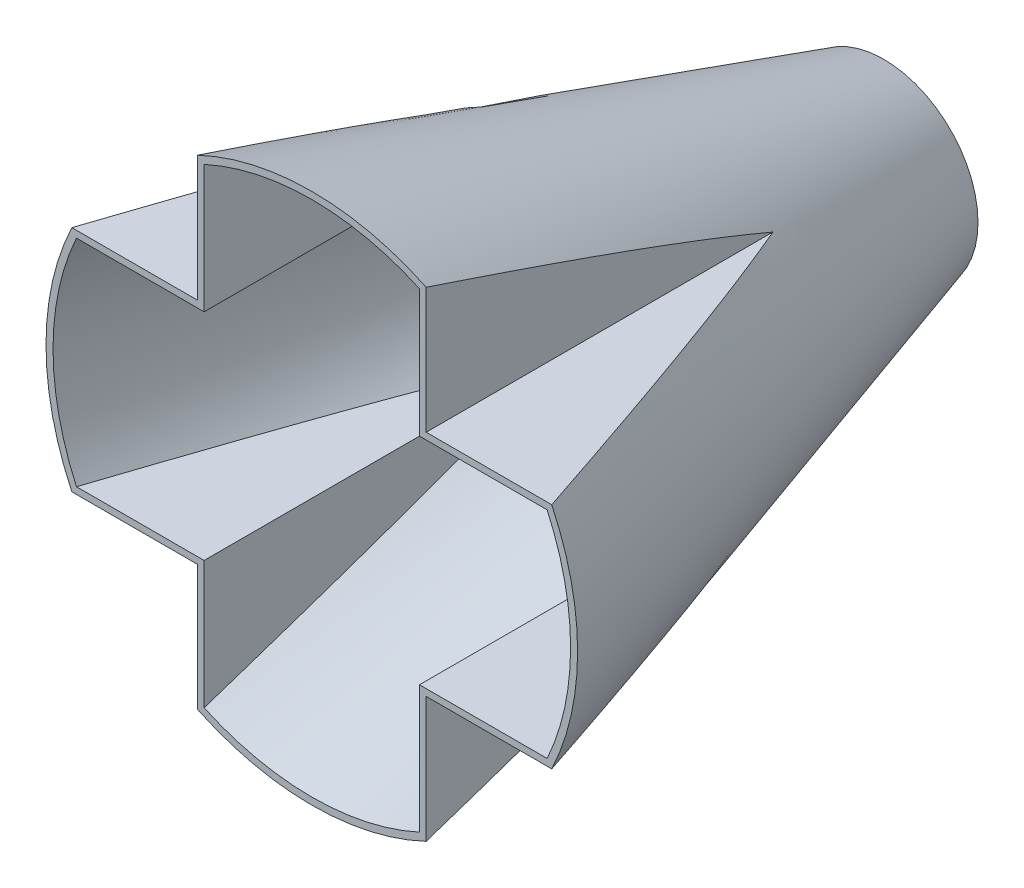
ISO-10303-21;
HEADER;
FILE_DESCRIPTION(('STEP AP214'),'2;1');
FILE_NAME('part.step','',(''),(''),'','','');
FILE_SCHEMA(('AUTOMOTIVE_DESIGN { 1 0 10303 214 1 1 1 1 }'));
ENDSEC;
DATA;
#1=APPLICATION_CONTEXT('core data for automotive mechanical design processes');
#2=APPLICATION_PROTOCOL_DEFINITION('international standard','automotive_design',2000,#1);
#3=PRODUCT_CONTEXT('',#1,'mechanical');
#4=PRODUCT('Part','Part','',(#3));
#5=PRODUCT_RELATED_PRODUCT_CATEGORY('part','',(#4));
#6=PRODUCT_DEFINITION_FORMATION('','',#4);
#7=PRODUCT_DEFINITION_CONTEXT('part definition',#1,'design');
#8=PRODUCT_DEFINITION('design','',#6,#7);
#9=PRODUCT_DEFINITION_SHAPE('','',#8);
#10=(LENGTH_UNIT() NAMED_UNIT(*) SI_UNIT(.MILLI.,.METRE.));
#11=(NAMED_UNIT(*) PLANE_ANGLE_UNIT() SI_UNIT($,.RADIAN.));
#12=(NAMED_UNIT(*) SI_UNIT($,.STERADIAN.) SOLID_ANGLE_UNIT());
#13=UNCERTAINTY_MEASURE_WITH_UNIT(LENGTH_MEASURE(1.E-05),#10,'distance_accuracy_value','');
#14=(GEOMETRIC_REPRESENTATION_CONTEXT(3) GLOBAL_UNCERTAINTY_ASSIGNED_CONTEXT((#13)) GLOBAL_UNIT_ASSIGNED_CONTEXT((#10,
#11,#12)) REPRESENTATION_CONTEXT('',''));
#15=CARTESIAN_POINT('',(0.,0.,0.));
#16=DIRECTION('',(0.,0.,1.));
#17=DIRECTION('',(1.,0.,0.));
#18=AXIS2_PLACEMENT_3D('',#15,#16,#17);
#19=CARTESIAN_POINT('',(0.,0.,0.));
#20=DIRECTION('',(0.,0.,1.));
#21=DIRECTION('',(1.,0.,0.));
#22=AXIS2_PLACEMENT_3D('',#19,#20,#21);
#23=PLANE('',#22);
#24=DIRECTION('',(1.,0.,0.));
#25=VECTOR('',#24,1.);
#26=CARTESIAN_POINT('',(17.,17.,0.));
#27=LINE('',#26,#25);
#28=CARTESIAN_POINT('',(17.,17.,0.));
#29=VERTEX_POINT('',#28);
#30=CARTESIAN_POINT('',(35.6545929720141,17.,0.));
#31=VERTEX_POINT('',#30);
#32=EDGE_CURVE('E311',#29,#31,#27,.T.);
#33=ORIENTED_EDGE('',*,*,#32,.F.);
#34=DIRECTION('',(0.,-1.,0.));
#35=VECTOR('',#34,1.);
#36=CARTESIAN_POINT('',(17.,0.,0.));
#37=LINE('',#36,#35);
#38=CARTESIAN_POINT('',(17.,35.6545929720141,0.));
#39=VERTEX_POINT('',#38);
#40=EDGE_CURVE('E11',#39,#29,#37,.T.);
#41=ORIENTED_EDGE('',*,*,#40,.F.);
#42=CARTESIAN_POINT('',(0.,0.,0.));
#43=DIRECTION('',(0.,0.,1.));
#44=DIRECTION('',(1.,0.,0.));
#45=AXIS2_PLACEMENT_3D('',#42,#43,#44);
#46=CIRCLE('',#45,39.5);
#47=CARTESIAN_POINT('',(-17.,35.6545929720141,0.));
#48=VERTEX_POINT('',#47);
#49=EDGE_CURVE('E373',#39,#48,#46,.T.);
#50=ORIENTED_EDGE('',*,*,#49,.T.);
#51=DIRECTION('',(0.,1.,0.));
#52=VECTOR('',#51,1.);
#53=CARTESIAN_POINT('',(-17.,35.7211421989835,0.));
#54=LINE('',#53,#52);
#55=CARTESIAN_POINT('',(-17.,17.,0.));
#56=VERTEX_POINT('',#55);
#57=EDGE_CURVE('E352',#56,#48,#54,.T.);
#58=ORIENTED_EDGE('',*,*,#57,.F.);
#59=DIRECTION('',(1.,0.,0.));
#60=VECTOR('',#59,1.);
#61=CARTESIAN_POINT('',(0.,17.,0.));
#62=LINE('',#61,#60);
#63=CARTESIAN_POINT('',(-35.6545929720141,17.,0.));
#64=VERTEX_POINT('',#63);
#65=EDGE_CURVE('E364',#64,#56,#62,.T.);
#66=ORIENTED_EDGE('',*,*,#65,.F.);
#67=CARTESIAN_POINT('',(-35.6545929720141,-17.,0.));
#68=VERTEX_POINT('',#67);
#69=EDGE_CURVE('E370',#64,#68,#46,.T.);
#70=ORIENTED_EDGE('',*,*,#69,.T.);
#71=DIRECTION('',(-1.,0.,0.));
#72=VECTOR('',#71,1.);
#73=CARTESIAN_POINT('',(-35.7211421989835,-17.,0.));
#74=LINE('',#73,#72);
#75=CARTESIAN_POINT('',(-17.,-17.,0.));
#76=VERTEX_POINT('',#75);
#77=EDGE_CURVE('E347',#76,#68,#74,.T.);
#78=ORIENTED_EDGE('',*,*,#77,.F.);
#79=DIRECTION('',(0.,1.,0.));
#80=VECTOR('',#79,1.);
#81=CARTESIAN_POINT('',(-17.,0.,0.));
#82=LINE('',#81,#80);
#83=CARTESIAN_POINT('',(-17.,-35.6545929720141,0.));
#84=VERTEX_POINT('',#83);
#85=EDGE_CURVE('E41',#84,#76,#82,.T.);
#86=ORIENTED_EDGE('',*,*,#85,.F.);
#87=CARTESIAN_POINT('',(17.,-35.6545929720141,0.));
#88=VERTEX_POINT('',#87);
#89=EDGE_CURVE('E374',#84,#88,#46,.T.);
#90=ORIENTED_EDGE('',*,*,#89,.T.);
#91=DIRECTION('',(0.,-1.,0.));
#92=VECTOR('',#91,1.);
#93=CARTESIAN_POINT('',(17.,-17.,0.));
#94=LINE('',#93,#92);
#95=CARTESIAN_POINT('',(17.,-17.,0.));
#96=VERTEX_POINT('',#95);
#97=EDGE_CURVE('E314',#96,#88,#94,.T.);
#98=ORIENTED_EDGE('',*,*,#97,.F.);
#99=DIRECTION('',(-1.,0.,0.));
#100=VECTOR('',#99,1.);
#101=CARTESIAN_POINT('',(0.,-17.,0.));
#102=LINE('',#101,#100);
#103=CARTESIAN_POINT('',(35.6545929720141,-17.,0.));
#104=VERTEX_POINT('',#103);
#105=EDGE_CURVE('E382',#104,#96,#102,.T.);
#106=ORIENTED_EDGE('',*,*,#105,.F.);
#107=EDGE_CURVE('E376',#104,#31,#46,.T.);
#108=ORIENTED_EDGE('',*,*,#107,.T.);
#109=EDGE_LOOP('',(#33,#41,#50,#58,#66,#70,#78,#86,#90,#98,#106,#108));
#110=FACE_BOUND('',#109,.T.);
#111=DIRECTION('',(0.,-1.,0.));
#112=VECTOR('',#111,1.);
#113=CARTESIAN_POINT('',(16.,0.,0.));
#114=LINE('',#113,#112);
#115=CARTESIAN_POINT('',(16.,34.9694377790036,0.));
#116=VERTEX_POINT('',#115);
#117=CARTESIAN_POINT('',(16.,16.,0.));
#118=VERTEX_POINT('',#117);
#119=EDGE_CURVE('E168',#116,#118,#114,.T.);
#120=ORIENTED_EDGE('',*,*,#119,.T.);
#121=DIRECTION('',(1.,0.,0.));
#122=VECTOR('',#121,1.);
#123=CARTESIAN_POINT('',(0.,16.,0.));
#124=LINE('',#123,#122);
#125=CARTESIAN_POINT('',(34.9694377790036,16.,0.));
#126=VERTEX_POINT('',#125);
#127=EDGE_CURVE('E162',#118,#126,#124,.T.);
#128=ORIENTED_EDGE('',*,*,#127,.T.);
#129=CARTESIAN_POINT('',(0.,0.,0.));
#130=DIRECTION('',(0.,0.,1.));
#131=DIRECTION('',(1.,0.,0.));
#132=AXIS2_PLACEMENT_3D('',#129,#130,#131);
#133=CIRCLE('',#132,38.4559693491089);
#134=CARTESIAN_POINT('',(34.9694377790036,-16.,0.));
#135=VERTEX_POINT('',#134);
#136=EDGE_CURVE('E155',#135,#126,#133,.T.);
#137=ORIENTED_EDGE('',*,*,#136,.F.);
#138=DIRECTION('',(-1.,0.,0.));
#139=VECTOR('',#138,1.);
#140=CARTESIAN_POINT('',(0.,-16.,0.));
#141=LINE('',#140,#139);
#142=CARTESIAN_POINT('',(16.,-16.,0.));
#143=VERTEX_POINT('',#142);
#144=EDGE_CURVE('E48',#135,#143,#141,.T.);
#145=ORIENTED_EDGE('',*,*,#144,.T.);
#146=DIRECTION('',(0.,-1.,0.));
#147=VECTOR('',#146,1.);
#148=CARTESIAN_POINT('',(16.,0.,0.));
#149=LINE('',#148,#147);
#150=CARTESIAN_POINT('',(16.,-34.9694377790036,0.));
#151=VERTEX_POINT('',#150);
#152=EDGE_CURVE('E340',#143,#151,#149,.T.);
#153=ORIENTED_EDGE('',*,*,#152,.T.);
#154=CARTESIAN_POINT('',(0.,0.,0.));
#155=DIRECTION('',(0.,0.,1.));
#156=DIRECTION('',(1.,0.,0.));
#157=AXIS2_PLACEMENT_3D('',#154,#155,#156);
#158=CIRCLE('',#157,38.4559693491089);
#159=CARTESIAN_POINT('',(-16.,-34.9694377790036,0.));
#160=VERTEX_POINT('',#159);
#161=EDGE_CURVE('E332',#160,#151,#158,.T.);
#162=ORIENTED_EDGE('',*,*,#161,.F.);
#163=DIRECTION('',(0.,1.,0.));
#164=VECTOR('',#163,1.);
#165=CARTESIAN_POINT('',(-16.,0.,0.));
#166=LINE('',#165,#164);
#167=CARTESIAN_POINT('',(-16.,-16.,0.));
#168=VERTEX_POINT('',#167);
#169=EDGE_CURVE('E315',#160,#168,#166,.T.);
#170=ORIENTED_EDGE('',*,*,#169,.T.);
#171=DIRECTION('',(-1.,0.,0.));
#172=VECTOR('',#171,1.);
#173=CARTESIAN_POINT('',(0.,-16.,0.));
#174=LINE('',#173,#172);
#175=CARTESIAN_POINT('',(-34.9694377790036,-16.,0.));
#176=VERTEX_POINT('',#175);
#177=EDGE_CURVE('E333',#168,#176,#174,.T.);
#178=ORIENTED_EDGE('',*,*,#177,.T.);
#179=CARTESIAN_POINT('',(0.,0.,0.));
#180=DIRECTION('',(0.,0.,1.));
#181=DIRECTION('',(1.,0.,0.));
#182=AXIS2_PLACEMENT_3D('',#179,#180,#181);
#183=CIRCLE('',#182,38.4559693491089);
#184=CARTESIAN_POINT('',(-34.9694377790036,16.,0.));
#185=VERTEX_POINT('',#184);
#186=EDGE_CURVE('E325',#185,#176,#183,.T.);
#187=ORIENTED_EDGE('',*,*,#186,.F.);
#188=DIRECTION('',(1.,0.,0.));
#189=VECTOR('',#188,1.);
#190=CARTESIAN_POINT('',(0.,16.,0.));
#191=LINE('',#190,#189);
#192=CARTESIAN_POINT('',(-16.,16.,0.));
#193=VERTEX_POINT('',#192);
#194=EDGE_CURVE('E327',#185,#193,#191,.T.);
#195=ORIENTED_EDGE('',*,*,#194,.T.);
#196=DIRECTION('',(0.,1.,0.));
#197=VECTOR('',#196,1.);
#198=CARTESIAN_POINT('',(-16.,0.,0.));
#199=LINE('',#198,#197);
#200=CARTESIAN_POINT('',(-16.,34.9694377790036,0.));
#201=VERTEX_POINT('',#200);
#202=EDGE_CURVE('E165',#193,#201,#199,.T.);
#203=ORIENTED_EDGE('',*,*,#202,.T.);
#204=CARTESIAN_POINT('',(0.,0.,0.));
#205=DIRECTION('',(0.,0.,1.));
#206=DIRECTION('',(1.,0.,0.));
#207=AXIS2_PLACEMENT_3D('',#204,#205,#206);
#208=CIRCLE('',#207,38.4559693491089);
#209=EDGE_CURVE('E313',#116,#201,#208,.T.);
#210=ORIENTED_EDGE('',*,*,#209,.F.);
#211=EDGE_LOOP('',(#120,#128,#137,#145,#153,#162,#170,#178,#187,#195,#203,#210));
#212=FACE_BOUND('',#211,.T.);
#213=ADVANCED_FACE('F33',(#110,#212),#23,.T.);
#214=CARTESIAN_POINT('',(0.,0.,-85.));
#215=DIRECTION('',(0.,0.,-1.));
#216=DIRECTION('',(-1.,0.,0.));
#217=AXIS2_PLACEMENT_3D('',#214,#215,#216);
#218=PLANE('',#217);
#219=CARTESIAN_POINT('',(0.,0.,-85.));
#220=DIRECTION('',(0.,0.,-1.));
#221=DIRECTION('',(-1.,0.,0.));
#222=AXIS2_PLACEMENT_3D('',#219,#220,#221);
#223=CIRCLE('',#222,12.9559693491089);
#224=CARTESIAN_POINT('',(-12.9559693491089,0.,-85.));
#225=VERTEX_POINT('',#224);
#226=EDGE_CURVE('E324',#225,#225,#223,.F.);
#227=ORIENTED_EDGE('',*,*,#226,.T.);
#228=EDGE_LOOP('',(#227));
#229=FACE_BOUND('',#228,.T.);
#230=CARTESIAN_POINT('',(0.,0.,-85.));
#231=DIRECTION('',(0.,0.,1.));
#232=DIRECTION('',(1.,0.,0.));
#233=AXIS2_PLACEMENT_3D('',#230,#231,#232);
#234=CIRCLE('',#233,14.);
#235=CARTESIAN_POINT('',(14.,0.,-85.));
#236=VERTEX_POINT('',#235);
#237=EDGE_CURVE('E375',#236,#236,#234,.T.);
#238=ORIENTED_EDGE('',*,*,#237,.F.);
#239=EDGE_LOOP('',(#238));
#240=FACE_BOUND('',#239,.T.);
#241=ADVANCED_FACE('F35',(#229,#240),#218,.T.);
#242=CARTESIAN_POINT('',(0.,0.,0.));
#243=DIRECTION('',(0.,0.,1.));
#244=DIRECTION('',(1.,0.,0.));
#245=AXIS2_PLACEMENT_3D('',#242,#243,#244);
#246=CONICAL_SURFACE('',#245,39.5,0.291456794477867);
#247=CARTESIAN_POINT('',(52.482108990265,17.,52.2225440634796));
#248=CARTESIAN_POINT('',(51.95788387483,17.,50.5601709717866));
#249=CARTESIAN_POINT('',(51.432984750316,17.,48.8980104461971));
#250=CARTESIAN_POINT('',(50.3816999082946,17.,45.57415913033));
#251=CARTESIAN_POINT('',(49.8553141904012,17.,43.9124683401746));
#252=CARTESIAN_POINT('',(48.2737118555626,17.,38.9281440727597));
#253=CARTESIAN_POINT('',(47.2160578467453,17.,35.6062834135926));
#254=CARTESIAN_POINT('',(45.0914537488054,17.,28.9607186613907));
#255=CARTESIAN_POINT('',(44.0244932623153,17.,25.637017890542));
#256=CARTESIAN_POINT('',(41.8807841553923,17.,18.9927902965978));
#257=CARTESIAN_POINT('',(40.8040355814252,17.,15.6722634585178));
#258=CARTESIAN_POINT('',(38.5866939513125,17.,8.87723939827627));
#259=CARTESIAN_POINT('',(37.4455017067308,17.,5.40293735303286));
#260=CARTESIAN_POINT('',(35.7204958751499,17.,0.195834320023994));
#261=CARTESIAN_POINT('',(35.1432865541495,17.,-1.53915494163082));
#262=CARTESIAN_POINT('',(33.9837644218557,17.,-5.00742776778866));
#263=CARTESIAN_POINT('',(33.401451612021,17.,-6.74071133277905));
#264=CARTESIAN_POINT('',(32.231584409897,17.,-10.203241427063));
#265=CARTESIAN_POINT('',(31.6440369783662,17.,-11.9324903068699));
#266=CARTESIAN_POINT('',(30.4619978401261,17.,-15.388612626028));
#267=CARTESIAN_POINT('',(29.867506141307,17.,-17.1154860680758));
#268=CARTESIAN_POINT('',(28.6703038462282,17.,-20.5663165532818));
#269=CARTESIAN_POINT('',(28.0675935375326,17.,-22.2902736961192));
#270=CARTESIAN_POINT('',(26.8522782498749,17.,-25.7346937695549));
#271=CARTESIAN_POINT('',(26.2396733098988,17.,-27.4551567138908));
#272=CARTESIAN_POINT('',(25.0091978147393,17.,-30.8728439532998));
#273=CARTESIAN_POINT('',(24.3914592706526,17.,-32.5701157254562));
#274=CARTESIAN_POINT('',(23.1413422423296,17.,-35.9594069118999));
#275=CARTESIAN_POINT('',(22.5089627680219,17.,-37.6514259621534));
#276=CARTESIAN_POINT('',(21.5456330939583,17.,-40.1865214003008));
#277=CARTESIAN_POINT('',(21.2216055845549,17.,-41.032229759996));
#278=CARTESIAN_POINT('',(20.5682495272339,17.,-42.7215950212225));
#279=CARTESIAN_POINT('',(20.2389209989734,17.,-43.5652519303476));
#280=CARTESIAN_POINT('',(19.5742728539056,17.,-45.2500019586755));
#281=CARTESIAN_POINT('',(19.2389544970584,17.,-46.0910955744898));
#282=CARTESIAN_POINT('',(18.5613288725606,17.,-47.7704628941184));
#283=CARTESIAN_POINT('',(18.2190216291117,17.,-48.608736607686));
#284=CARTESIAN_POINT('',(17.5319413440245,17.,-50.2682080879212));
#285=CARTESIAN_POINT('',(17.1873006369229,17.,-51.089460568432));
#286=CARTESIAN_POINT('',(16.4887604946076,17.,-52.7280395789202));
#287=CARTESIAN_POINT('',(16.1348609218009,17.,-53.5453660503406));
#288=CARTESIAN_POINT('',(15.4157441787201,17.,-55.1758834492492));
#289=CARTESIAN_POINT('',(15.0505174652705,17.,-55.9890701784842));
#290=CARTESIAN_POINT('',(14.3067659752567,17.,-57.6093087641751));
#291=CARTESIAN_POINT('',(13.9282417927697,17.,-58.4163608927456));
#292=CARTESIAN_POINT('',(13.1565746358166,17.,-60.0190282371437));
#293=CARTESIAN_POINT('',(12.7635050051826,17.,-60.8146785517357));
#294=CARTESIAN_POINT('',(12.1585727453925,17.,-62.0004440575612));
#295=CARTESIAN_POINT('',(11.9543490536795,17.,-62.3944602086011));
#296=CARTESIAN_POINT('',(11.5401118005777,17.,-63.1794334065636));
#297=CARTESIAN_POINT('',(11.3300983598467,17.,-63.5703905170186));
#298=CARTESIAN_POINT('',(10.903787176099,17.,-64.3481206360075));
#299=CARTESIAN_POINT('',(10.6874991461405,17.,-64.7348989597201));
#300=CARTESIAN_POINT('',(10.2473671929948,17.,-65.5041224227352));
#301=CARTESIAN_POINT('',(10.0235235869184,17.,-65.8865677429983));
#302=CARTESIAN_POINT('',(9.56714802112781,17.,-66.6460514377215));
#303=CARTESIAN_POINT('',(9.33461940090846,17.,-67.0230918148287));
#304=CARTESIAN_POINT('',(8.85930399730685,17.,-67.7706303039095));
#305=CARTESIAN_POINT('',(8.61651840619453,17.,-68.1411291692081));
#306=CARTESIAN_POINT('',(8.27998266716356,17.,-68.6365191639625));
#307=CARTESIAN_POINT('',(8.1915657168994,17.,-68.7650446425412));
#308=CARTESIAN_POINT('',(8.01311044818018,17.,-69.0209744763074));
#309=CARTESIAN_POINT('',(7.92307204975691,17.,-69.1483787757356));
#310=CARTESIAN_POINT('',(7.65034481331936,17.,-69.5287845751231));
#311=CARTESIAN_POINT('',(7.46506856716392,17.,-69.779942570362));
#312=CARTESIAN_POINT('',(7.08627662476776,17.,-70.2767530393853));
#313=CARTESIAN_POINT('',(6.89274566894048,17.,-70.5223939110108));
#314=CARTESIAN_POINT('',(6.49659657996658,17.,-71.0062466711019));
#315=CARTESIAN_POINT('',(6.2939789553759,17.,-71.2444589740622));
#316=CARTESIAN_POINT('',(5.87650314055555,17.,-71.7135062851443));
#317=CARTESIAN_POINT('',(5.66155752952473,17.,-71.9442639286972));
#318=CARTESIAN_POINT('',(5.21918269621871,17.,-72.3937143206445));
#319=CARTESIAN_POINT('',(4.99174976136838,17.,-72.6124034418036));
#320=CARTESIAN_POINT('',(4.52302468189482,17.,-73.0334467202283));
#321=CARTESIAN_POINT('',(4.28176487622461,17.,-73.2358365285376));
#322=CARTESIAN_POINT('',(3.78310299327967,17.,-73.6194543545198));
#323=CARTESIAN_POINT('',(3.52571526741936,17.,-73.8007007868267));
#324=CARTESIAN_POINT('',(2.9771491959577,17.,-74.1450250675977));
#325=CARTESIAN_POINT('',(2.68487174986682,17.,-74.3063830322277));
#326=CARTESIAN_POINT('',(2.08008601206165,17.,-74.5860475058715));
#327=CARTESIAN_POINT('',(1.76760389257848,17.,-74.7044084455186));
#328=CARTESIAN_POINT('',(1.28513743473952,17.,-74.8408798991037));
#329=CARTESIAN_POINT('',(1.1208871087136,17.,-74.8796426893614));
#330=CARTESIAN_POINT('',(0.789428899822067,17.,-74.9416106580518));
#331=CARTESIAN_POINT('',(0.622221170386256,17.,-74.9648166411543));
#332=CARTESIAN_POINT('',(0.28644660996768,17.,-74.9947162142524));
#333=CARTESIAN_POINT('',(0.117880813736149,17.,-75.0014213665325));
#334=CARTESIAN_POINT('',(-0.219077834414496,17.,-74.9980766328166));
#335=CARTESIAN_POINT('',(-0.38747069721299,17.,-74.9880278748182));
#336=CARTESIAN_POINT('',(-0.701880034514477,17.,-74.9538367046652));
#337=CARTESIAN_POINT('',(-0.848105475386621,17.,-74.9315761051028));
#338=CARTESIAN_POINT('',(-1.13826646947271,17.,-74.8751732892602));
#339=CARTESIAN_POINT('',(-1.28220115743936,17.,-74.8410266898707));
#340=CARTESIAN_POINT('',(-1.70948159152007,17.,-74.7220601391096));
#341=CARTESIAN_POINT('',(-1.988333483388,17.,-74.6207099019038));
#342=CARTESIAN_POINT('',(-2.47626323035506,17.,-74.4065085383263));
#343=CARTESIAN_POINT('',(-2.68820886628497,17.,-74.2999274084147));
#344=CARTESIAN_POINT('',(-3.10194474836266,17.,-74.0683929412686));
#345=CARTESIAN_POINT('',(-3.30372845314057,17.,-73.943427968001));
#346=CARTESIAN_POINT('',(-3.6978331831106,17.,-73.67848919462));
#347=CARTESIAN_POINT('',(-3.89012847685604,17.,-73.5384775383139));
#348=CARTESIAN_POINT('',(-4.26542572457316,17.,-73.2466748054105));
#349=CARTESIAN_POINT('',(-4.44842966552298,17.,-73.0948862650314));
#350=CARTESIAN_POINT('',(-4.87254476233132,17.,-72.7236059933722));
#351=CARTESIAN_POINT('',(-5.1099728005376,17.,-72.4999188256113));
#352=CARTESIAN_POINT('',(-5.57135433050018,17.,-72.0389725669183));
#353=CARTESIAN_POINT('',(-5.79530094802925,17.,-71.8017066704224));
#354=CARTESIAN_POINT('',(-6.23192856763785,17.,-71.3163452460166));
#355=CARTESIAN_POINT('',(-6.44458963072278,17.,-71.0682318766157));
#356=CARTESIAN_POINT('',(-6.85990464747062,17.,-70.5637562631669));
#357=CARTESIAN_POINT('',(-7.06255733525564,17.,-70.3073929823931));
#358=CARTESIAN_POINT('',(-7.46046466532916,17.,-69.786418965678));
#359=CARTESIAN_POINT('',(-7.65566389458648,17.,-69.5217660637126));
#360=CARTESIAN_POINT('',(-8.03844988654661,17.,-68.9870145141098));
#361=CARTESIAN_POINT('',(-8.22603637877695,17.,-68.7169156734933));
#362=CARTESIAN_POINT('',(-8.59433069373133,17.,-68.1725456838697));
#363=CARTESIAN_POINT('',(-8.77504640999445,17.,-67.8982798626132));
#364=CARTESIAN_POINT('',(-9.13061177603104,17.,-67.3459961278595));
#365=CARTESIAN_POINT('',(-9.3054616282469,17.,-67.0679783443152));
#366=CARTESIAN_POINT('',(-9.85869041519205,17.,-66.1700446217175));
#367=CARTESIAN_POINT('',(-10.2270365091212,17.,-65.5439378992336));
#368=CARTESIAN_POINT('',(-10.9440681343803,17.,-64.280524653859));
#369=CARTESIAN_POINT('',(-11.2927501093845,17.,-63.6432161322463));
#370=CARTESIAN_POINT('',(-11.9745002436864,17.,-62.3598203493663));
#371=CARTESIAN_POINT('',(-12.3075585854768,17.,-61.713727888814));
#372=CARTESIAN_POINT('',(-12.9606896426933,17.,-60.4150899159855));
#373=CARTESIAN_POINT('',(-13.280763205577,17.,-59.7625448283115));
#374=CARTESIAN_POINT('',(-13.9108759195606,17.,-58.4507141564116));
#375=CARTESIAN_POINT('',(-14.2208891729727,17.,-57.7914161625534));
#376=CARTESIAN_POINT('',(-14.8317699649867,17.,-56.4685943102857));
#377=CARTESIAN_POINT('',(-15.1326373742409,17.,-55.8050703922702));
#378=CARTESIAN_POINT('',(-15.7264529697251,17.,-54.4747698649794));
#379=CARTESIAN_POINT('',(-16.0194038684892,17.,-53.8079944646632));
#380=CARTESIAN_POINT('',(-16.598555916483,17.,-52.4715158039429));
#381=CARTESIAN_POINT('',(-16.8847569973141,17.,-51.8018125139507));
#382=CARTESIAN_POINT('',(-17.7344837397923,17.,-49.7892148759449));
#383=CARTESIAN_POINT('',(-18.2892306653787,17.,-48.4426120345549));
#384=CARTESIAN_POINT('',(-19.3806011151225,17.,-45.7419956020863));
#385=CARTESIAN_POINT('',(-19.9172232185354,17.,-44.3879814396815));
#386=CARTESIAN_POINT('',(-20.9752587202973,17.,-41.6760940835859));
#387=CARTESIAN_POINT('',(-21.4966912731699,17.,-40.3182283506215));
#388=CARTESIAN_POINT('',(-22.5277812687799,17.,-37.5980320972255));
#389=CARTESIAN_POINT('',(-23.0374386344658,17.,-36.2357015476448));
#390=CARTESIAN_POINT('',(-24.0578607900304,17.,-33.4780968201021));
#391=CARTESIAN_POINT('',(-24.5684136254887,17.,-32.0827443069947));
#392=CARTESIAN_POINT('',(-25.5810159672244,17.,-29.2889510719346));
#393=CARTESIAN_POINT('',(-26.0830654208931,17.,-27.8905103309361));
#394=CARTESIAN_POINT('',(-27.0801776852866,17.,-25.0904620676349));
#395=CARTESIAN_POINT('',(-27.575237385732,17.,-23.6888534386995));
#396=CARTESIAN_POINT('',(-28.5591905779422,17.,-20.883473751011));
#397=CARTESIAN_POINT('',(-29.0480840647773,17.,-19.4797026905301));
#398=CARTESIAN_POINT('',(-30.0173162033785,17.,-16.679651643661));
#399=CARTESIAN_POINT('',(-30.4976901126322,17.,-15.2833838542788));
#400=CARTESIAN_POINT('',(-31.4538602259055,17.,-12.4892804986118));
#401=CARTESIAN_POINT('',(-31.9296564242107,17.,-11.0914449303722));
#402=CARTESIAN_POINT('',(-32.8770030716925,17.,-8.29510196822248));
#403=CARTESIAN_POINT('',(-33.3485554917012,17.,-6.89659524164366));
#404=CARTESIAN_POINT('',(-34.2881034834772,17.,-4.09839297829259));
#405=CARTESIAN_POINT('',(-34.7560990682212,17.,-2.69869744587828));
#406=CARTESIAN_POINT('',(-35.2225440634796,17.,-1.29848674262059));
#407=B_SPLINE_CURVE_WITH_KNOTS('',3,(#247,#248,#249,#250,#251,#252,#253,#254,#255,#256,#257,
#258,#259,#260,#261,#262,#263,#264,#265,#266,#267,#268,#269,#270,#271,#272,#273,#274,#275,#276,
#277,#278,#279,#280,#281,#282,#283,#284,#285,#286,#287,#288,#289,#290,#291,#292,#293,#294,#295,
#296,#297,#298,#299,#300,#301,#302,#303,#304,#305,#306,#307,#308,#309,#310,#311,#312,#313,#314,
#315,#316,#317,#318,#319,#320,#321,#322,#323,#324,#325,#326,#327,#328,#329,#330,#331,#332,#333,
#334,#335,#336,#337,#338,#339,#340,#341,#342,#343,#344,#345,#346,#347,#348,#349,#350,#351,#352,
#353,#354,#355,#356,#357,#358,#359,#360,#361,#362,#363,#364,#365,#366,#367,#368,#369,#370,#371,
#372,#373,#374,#375,#376,#377,#378,#379,#380,#381,#382,#383,#384,#385,#386,#387,#388,#389,#390,
#391,#392,#393,#394,#395,#396,#397,#398,#399,#400,#401,#402,#403,#404,#405,#406),.UNSPECIFIED.,
.F.,.F.,(4,2,2,2,2,2,2,2,2,2,2,2,2,2,2,2,2,2,2,2,2,2,2,2,2,2,2,2,2,2,2,2,2,2,2,2,2,2,2,2,2,2,2,
2,2,2,2,2,2,2,2,2,2,2,2,2,2,2,2,2,2,2,2,2,2,2,2,2,2,2,2,2,2,2,2,2,2,2,2,4),(0.,5.22921253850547,
10.4584264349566,20.9169319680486,31.3891935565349,41.8614054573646,52.832136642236,
58.3175861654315,63.8030341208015,69.2820383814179,74.7610364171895,80.2398432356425,
85.7186284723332,91.1371575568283,96.5560541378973,99.2730139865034,101.9899637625,
104.706348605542,107.422724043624,110.094584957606,112.766485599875,115.440701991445,
118.114799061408,120.776878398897,122.108231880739,123.439557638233,124.768922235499,
126.098231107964,127.42703400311,128.755682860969,129.223676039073,129.691692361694,
130.627856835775,131.565834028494,132.503758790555,133.449445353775,134.39541461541,
135.339255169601,136.282267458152,137.281322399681,138.279108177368,138.784763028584,
139.290391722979,139.795666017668,140.300906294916,140.744115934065,141.187489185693,
142.074146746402,142.78491175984,143.49612860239,144.209178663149,144.922075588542,
145.899934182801,146.878287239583,147.858314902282,148.838466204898,149.824867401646,
150.811303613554,151.796570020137,152.781802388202,154.960534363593,157.139659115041,
159.320135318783,161.500468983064,163.686030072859,165.871622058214,168.056455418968,
170.241310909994,174.610297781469,178.979626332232,183.343182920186,187.706768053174,
192.164206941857,196.621673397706,201.081064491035,205.540459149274,209.970225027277,
214.399996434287,218.827591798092,223.255171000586),.UNSPECIFIED.);
#408=CARTESIAN_POINT('',(17.,17.,-51.5278981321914));
#409=VERTEX_POINT('',#408);
#410=EDGE_CURVE('E268',#31,#409,#407,.T.);
#411=ORIENTED_EDGE('',*,*,#410,.F.);
#412=ORIENTED_EDGE('',*,*,#107,.F.);
#413=CARTESIAN_POINT('',(-35.2225440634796,-17.,-1.29848674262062));
#414=CARTESIAN_POINT('',(-34.844412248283,-17.,-2.4336164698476));
#415=CARTESIAN_POINT('',(-34.465252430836,-17.,-3.56840359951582));
#416=CARTESIAN_POINT('',(-33.7046501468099,-17.,-5.83721435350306));
#417=CARTESIAN_POINT('',(-33.3232076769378,-17.,-6.97123797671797));
#418=CARTESIAN_POINT('',(-32.1750682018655,-17.,-10.3721886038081));
#419=CARTESIAN_POINT('',(-31.4046082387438,-17.,-12.6378477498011));
#420=CARTESIAN_POINT('',(-29.8487432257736,-17.,-17.1723945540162));
#421=CARTESIAN_POINT('',(-29.0632972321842,-17.,-19.4412681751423));
#422=CARTESIAN_POINT('',(-27.4767634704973,-17.,-23.9734321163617));
#423=CARTESIAN_POINT('',(-26.6756764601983,-17.,-26.2367227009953));
#424=CARTESIAN_POINT('',(-25.4125998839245,-17.,-29.7549965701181));
#425=CARTESIAN_POINT('',(-24.9576030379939,-17.,-31.0124904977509));
#426=CARTESIAN_POINT('',(-24.0402361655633,-17.,-33.5247930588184));
#427=CARTESIAN_POINT('',(-23.5778661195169,-17.,-34.7796016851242));
#428=CARTESIAN_POINT('',(-22.6443629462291,-17.,-37.2861918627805));
#429=CARTESIAN_POINT('',(-22.1732284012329,-17.,-38.5379728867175));
#430=CARTESIAN_POINT('',(-21.220585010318,-17.,-41.0375777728));
#431=CARTESIAN_POINT('',(-20.7390762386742,-17.,-42.2854016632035));
#432=CARTESIAN_POINT('',(-19.7644433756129,-17.,-44.7736787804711));
#433=CARTESIAN_POINT('',(-19.2713440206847,-17.,-46.0141416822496));
#434=CARTESIAN_POINT('',(-18.2697047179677,-17.,-48.4888909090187));
#435=CARTESIAN_POINT('',(-17.7611642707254,-17.,-49.7231770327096));
#436=CARTESIAN_POINT('',(-16.983830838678,-17.,-51.568282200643));
#437=CARTESIAN_POINT('',(-16.7223365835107,-17.,-52.1821783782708));
#438=CARTESIAN_POINT('',(-16.1938161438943,-17.,-53.4075827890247));
#439=CARTESIAN_POINT('',(-15.9267900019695,-17.,-54.019091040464));
#440=CARTESIAN_POINT('',(-15.3864435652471,-17.,-55.2392750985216));
#441=CARTESIAN_POINT('',(-15.1131236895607,-17.,-55.847951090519));
#442=CARTESIAN_POINT('',(-14.5592188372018,-17.,-57.0619830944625));
#443=CARTESIAN_POINT('',(-14.2786339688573,-17.,-57.6673391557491));
#444=CARTESIAN_POINT('',(-13.7194474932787,-17.,-58.8519583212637));
#445=CARTESIAN_POINT('',(-13.4411499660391,-17.,-59.4313647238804));
#446=CARTESIAN_POINT('',(-12.8753722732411,-17.,-60.5857160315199));
#447=CARTESIAN_POINT('',(-12.5878917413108,-17.,-61.1606607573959));
#448=CARTESIAN_POINT('',(-12.001550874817,-17.,-62.3060421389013));
#449=CARTESIAN_POINT('',(-11.7026709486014,-17.,-62.8764687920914));
#450=CARTESIAN_POINT('',(-11.0918614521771,-17.,-64.0102650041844));
#451=CARTESIAN_POINT('',(-10.7799328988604,-17.,-64.5736351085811));
#452=CARTESIAN_POINT('',(-10.1455504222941,-17.,-65.6817832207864));
#453=CARTESIAN_POINT('',(-9.82336511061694,-17.,-66.2267144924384));
#454=CARTESIAN_POINT('',(-9.15975450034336,-17.,-67.3051109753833));
#455=CARTESIAN_POINT('',(-8.81832270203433,-17.,-67.838572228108));
#456=CARTESIAN_POINT('',(-8.28844280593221,-17.,-68.6258035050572));
#457=CARTESIAN_POINT('',(-8.10911128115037,-17.,-68.8857164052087));
#458=CARTESIAN_POINT('',(-7.74355888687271,-17.,-69.4006412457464));
#459=CARTESIAN_POINT('',(-7.55733852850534,-17.,-69.6556535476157));
#460=CARTESIAN_POINT('',(-7.17714330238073,-17.,-70.1595769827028));
#461=CARTESIAN_POINT('',(-6.98317375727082,-17.,-70.408492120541));
#462=CARTESIAN_POINT('',(-6.58620053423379,-17.,-70.8989824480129));
#463=CARTESIAN_POINT('',(-6.38319845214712,-17.,-71.1405589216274));
#464=CARTESIAN_POINT('',(-6.021120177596,-17.,-71.5526076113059));
#465=CARTESIAN_POINT('',(-5.86442293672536,-17.,-71.7251683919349));
#466=CARTESIAN_POINT('',(-5.54461252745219,-17.,-72.0643054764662));
#467=CARTESIAN_POINT('',(-5.38149854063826,-17.,-72.2308810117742));
#468=CARTESIAN_POINT('',(-5.04774299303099,-17.,-72.5571455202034));
#469=CARTESIAN_POINT('',(-4.87708468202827,-17.,-72.7168174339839));
#470=CARTESIAN_POINT('',(-4.52779011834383,-17.,-73.0272273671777));
#471=CARTESIAN_POINT('',(-4.34915397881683,-17.,-73.177965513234));
#472=CARTESIAN_POINT('',(-3.98070877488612,-17.,-73.4702926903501));
#473=CARTESIAN_POINT('',(-3.79078525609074,-17.,-73.6117385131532));
#474=CARTESIAN_POINT('',(-3.40109225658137,-17.,-73.8805590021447));
#475=CARTESIAN_POINT('',(-3.20132085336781,-17.,-74.0079309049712));
#476=CARTESIAN_POINT('',(-2.79211714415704,-17.,-74.2446917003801));
#477=CARTESIAN_POINT('',(-2.58271763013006,-17.,-74.3541365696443));
#478=CARTESIAN_POINT('',(-2.15404480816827,-17.,-74.5513000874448));
#479=CARTESIAN_POINT('',(-1.93477949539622,-17.,-74.6390359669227));
#480=CARTESIAN_POINT('',(-1.42640050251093,-17.,-74.8086823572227));
#481=CARTESIAN_POINT('',(-1.13449373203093,-17.,-74.8825351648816));
#482=CARTESIAN_POINT('',(-0.542557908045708,-17.,-74.9796808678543));
#483=CARTESIAN_POINT('',(-0.242540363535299,-17.,-75.0030419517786));
#484=CARTESIAN_POINT('',(0.357308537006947,-17.,-74.9963123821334));
#485=CARTESIAN_POINT('',(0.657139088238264,-17.,-74.9661491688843));
#486=CARTESIAN_POINT('',(1.24758628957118,-17.,-74.856148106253));
#487=CARTESIAN_POINT('',(1.53818973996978,-17.,-74.776242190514));
#488=CARTESIAN_POINT('',(2.21781878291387,-17.,-74.5349273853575));
#489=CARTESIAN_POINT('',(2.59975258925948,-17.,-74.3537069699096));
#490=CARTESIAN_POINT('',(3.14771829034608,-17.,-74.0399502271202));
#491=CARTESIAN_POINT('',(3.3264651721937,-17.,-73.928179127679));
#492=CARTESIAN_POINT('',(3.67618414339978,-17.,-73.69300669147));
#493=CARTESIAN_POINT('',(3.84715701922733,-17.,-73.5696065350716));
#494=CARTESIAN_POINT('',(4.21618481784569,-17.,-73.2869127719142));
#495=CARTESIAN_POINT('',(4.41257111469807,-17.,-73.1254590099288));
#496=CARTESIAN_POINT('',(4.79579218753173,-17.,-72.7915232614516));
#497=CARTESIAN_POINT('',(4.98262340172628,-17.,-72.6190372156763));
#498=CARTESIAN_POINT('',(5.34796668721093,-17.,-72.2650059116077));
#499=CARTESIAN_POINT('',(5.52646650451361,-17.,-72.0834480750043));
#500=CARTESIAN_POINT('',(5.87585532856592,-17.,-71.7131431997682));
#501=CARTESIAN_POINT('',(6.04674346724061,-17.,-71.5243953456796));
#502=CARTESIAN_POINT('',(6.38282751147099,-17.,-71.1397743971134));
#503=CARTESIAN_POINT('',(6.5479797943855,-17.,-70.943863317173));
#504=CARTESIAN_POINT('',(6.87219915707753,-17.,-70.5470762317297));
#505=CARTESIAN_POINT('',(7.03126609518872,-17.,-70.34620011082));
#506=CARTESIAN_POINT('',(7.34382455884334,-17.,-69.9404739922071));
#507=CARTESIAN_POINT('',(7.49732131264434,-17.,-69.7356280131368));
#508=CARTESIAN_POINT('',(7.79946022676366,-17.,-69.3224049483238));
#509=CARTESIAN_POINT('',(7.94810251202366,-17.,-69.1140279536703));
#510=CARTESIAN_POINT('',(8.39431740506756,-17.,-68.4746192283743));
#511=CARTESIAN_POINT('',(8.68498011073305,-17.,-68.0387570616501));
#512=CARTESIAN_POINT('',(9.25156146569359,-17.,-67.1575175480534));
#513=CARTESIAN_POINT('',(9.52747734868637,-17.,-66.7121384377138));
#514=CARTESIAN_POINT('',(10.0672408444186,-17.,-65.8137460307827));
#515=CARTESIAN_POINT('',(10.3310803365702,-17.,-65.3607278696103));
#516=CARTESIAN_POINT('',(10.8484436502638,-17.,-64.4488981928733));
#517=CARTESIAN_POINT('',(11.1019681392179,-17.,-63.9900870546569));
#518=CARTESIAN_POINT('',(11.60090111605,-17.,-63.0665558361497));
#519=CARTESIAN_POINT('',(11.8462870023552,-17.,-62.601823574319));
#520=CARTESIAN_POINT('',(12.3294924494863,-17.,-61.6684420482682));
#521=CARTESIAN_POINT('',(12.5673119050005,-17.,-61.1997927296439));
#522=CARTESIAN_POINT('',(13.036294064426,-17.,-60.2593929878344));
#523=CARTESIAN_POINT('',(13.2674591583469,-17.,-59.7876437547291));
#524=CARTESIAN_POINT('',(13.7240343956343,-17.,-58.841365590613));
#525=CARTESIAN_POINT('',(13.9494444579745,-17.,-58.3668366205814));
#526=CARTESIAN_POINT('',(14.6198877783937,-17.,-56.9358457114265));
#527=CARTESIAN_POINT('',(15.0572505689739,-17.,-55.9757867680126));
#528=CARTESIAN_POINT('',(15.9158315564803,-17.,-54.0484246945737));
#529=CARTESIAN_POINT('',(16.3370484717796,-17.,-53.0811209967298));
#530=CARTESIAN_POINT('',(17.1656614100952,-17.,-51.1424818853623));
#531=CARTESIAN_POINT('',(17.5730788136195,-17.,-50.1711555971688));
#532=CARTESIAN_POINT('',(18.1760634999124,-17.,-48.7108358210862));
#533=CARTESIAN_POINT('',(18.3756984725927,-17.,-48.223515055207));
#534=CARTESIAN_POINT('',(18.7724815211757,-17.,-47.247861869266));
#535=CARTESIAN_POINT('',(18.9696295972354,-17.,-46.759529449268));
#536=CARTESIAN_POINT('',(19.5790459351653,-17.,-45.2398391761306));
#537=CARTESIAN_POINT('',(19.9873929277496,-17.,-44.2069076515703));
#538=CARTESIAN_POINT('',(20.79557308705,-17.,-42.1377155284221));
#539=CARTESIAN_POINT('',(21.1954061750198,-17.,-41.1014548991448));
#540=CARTESIAN_POINT('',(21.9878231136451,-17.,-39.0261261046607));
#541=CARTESIAN_POINT('',(22.3804067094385,-17.,-37.9870578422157));
#542=CARTESIAN_POINT('',(23.1593098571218,-17.,-35.9065816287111));
#543=CARTESIAN_POINT('',(23.5456294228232,-17.,-34.8651736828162));
#544=CARTESIAN_POINT('',(24.6965631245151,-17.,-31.7376861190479));
#545=CARTESIAN_POINT('',(25.453049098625,-17.,-29.6486143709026));
#546=CARTESIAN_POINT('',(26.9493295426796,-17.,-25.4645020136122));
#547=CARTESIAN_POINT('',(27.6891238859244,-17.,-23.3694613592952));
#548=CARTESIAN_POINT('',(28.7893352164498,-17.,-20.2220868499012));
#549=CARTESIAN_POINT('',(29.1547227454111,-17.,-19.1714868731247));
#550=CARTESIAN_POINT('',(29.8825031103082,-17.,-17.0692555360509));
#551=CARTESIAN_POINT('',(30.2448959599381,-17.,-16.0176241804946));
#552=CARTESIAN_POINT('',(31.3280499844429,-17.,-12.8613368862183));
#553=CARTESIAN_POINT('',(32.0447829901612,-17.,-10.755298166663));
#554=CARTESIAN_POINT('',(33.4693816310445,-17.,-6.54041911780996));
#555=CARTESIAN_POINT('',(34.1772479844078,-17.,-4.4315790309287));
#556=CARTESIAN_POINT('',(35.5856395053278,-17.,-0.211453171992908));
#557=CARTESIAN_POINT('',(36.2861646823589,-17.,1.89983259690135));
#558=CARTESIAN_POINT('',(37.645780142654,-17.,6.01768652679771));
#559=CARTESIAN_POINT('',(38.305175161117,-17.,8.02415413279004));
#560=CARTESIAN_POINT('',(39.6191715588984,-17.,12.0386587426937));
#561=CARTESIAN_POINT('',(40.273772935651,-17.,14.0466957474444));
#562=CARTESIAN_POINT('',(42.231417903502,-17.,20.0729172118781));
#563=CARTESIAN_POINT('',(43.5282699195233,-17.,24.093113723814));
#564=CARTESIAN_POINT('',(45.4628406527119,-17.,30.1225726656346));
#565=CARTESIAN_POINT('',(46.1052987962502,-17.,32.1303178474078));
#566=CARTESIAN_POINT('',(47.387419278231,-17.,36.146701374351));
#567=CARTESIAN_POINT('',(48.0270816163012,-17.,38.1553397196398));
#568=CARTESIAN_POINT('',(49.3039101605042,-17.,42.1733372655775));
#569=CARTESIAN_POINT('',(49.9410764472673,-17.,44.1826964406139));
#570=CARTESIAN_POINT('',(51.2131913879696,-17.,48.2021155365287));
#571=CARTESIAN_POINT('',(51.8481400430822,-17.,50.2121754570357));
#572=CARTESIAN_POINT('',(52.482108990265,-17.,52.2225440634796));
#573=B_SPLINE_CURVE_WITH_KNOTS('',3,(#413,#414,#415,#416,#417,#418,#419,#420,#421,#422,#423,
#424,#425,#426,#427,#428,#429,#430,#431,#432,#433,#434,#435,#436,#437,#438,#439,#440,#441,#442,
#443,#444,#445,#446,#447,#448,#449,#450,#451,#452,#453,#454,#455,#456,#457,#458,#459,#460,#461,
#462,#463,#464,#465,#466,#467,#468,#469,#470,#471,#472,#473,#474,#475,#476,#477,#478,#479,#480,
#481,#482,#483,#484,#485,#486,#487,#488,#489,#490,#491,#492,#493,#494,#495,#496,#497,#498,#499,
#500,#501,#502,#503,#504,#505,#506,#507,#508,#509,#510,#511,#512,#513,#514,#515,#516,#517,#518,
#519,#520,#521,#522,#523,#524,#525,#526,#527,#528,#529,#530,#531,#532,#533,#534,#535,#536,#537,
#538,#539,#540,#541,#542,#543,#544,#545,#546,#547,#548,#549,#550,#551,#552,#553,#554,#555,#556,
#557,#558,#559,#560,#561,#562,#563,#564,#565,#566,#567,#568,#569,#570,#571,#572),.UNSPECIFIED.,
.F.,.F.,(4,2,2,2,2,2,2,2,2,2,2,2,2,2,2,2,2,2,2,2,2,2,2,2,2,2,2,2,2,2,2,2,2,2,2,2,2,2,2,2,2,2,2,
2,2,2,2,2,2,2,2,2,2,2,2,2,2,2,2,2,2,2,2,2,2,2,2,2,2,2,2,2,2,2,2,2,2,2,2,4),(0.,3.58936219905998,
7.17872957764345,14.3579310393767,21.5608349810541,28.7633908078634,32.7752073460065,
36.7870345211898,40.7995163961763,44.8119695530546,48.8165224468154,52.8212050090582,
54.8229899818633,56.8247595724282,58.8263962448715,60.8280030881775,62.7562641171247,
64.6846021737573,66.616418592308,68.548084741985,70.4469552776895,72.3464709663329,
73.2937101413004,74.2408791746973,75.1874084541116,76.1337711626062,76.8329060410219,
77.5321303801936,78.2329938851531,78.9338474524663,79.643747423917,80.3537865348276,
81.0615644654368,81.7687788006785,82.6681196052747,83.5662450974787,84.4655890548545,
85.3661663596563,86.6267332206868,87.2589021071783,87.8910068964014,88.65321035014,
89.415695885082,90.1792696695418,90.9429303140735,91.7114970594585,92.4800816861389,
93.2479251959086,94.0157489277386,95.5869963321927,97.1585374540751,98.731120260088,
100.303601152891,101.880134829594,103.456690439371,105.032672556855,106.608676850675,
109.773425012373,112.938423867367,116.098270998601,117.678145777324,119.258020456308,
122.590124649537,125.922259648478,129.254511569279,132.586756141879,139.25211682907,
145.917528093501,149.254501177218,152.591458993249,159.265407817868,165.938812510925,
172.612208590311,178.948322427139,185.284439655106,197.956984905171,204.281075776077,
210.605167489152,216.92905320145,223.252935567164),.UNSPECIFIED.);
#574=CARTESIAN_POINT('',(17.,-17.,-51.5278981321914));
#575=VERTEX_POINT('',#574);
#576=EDGE_CURVE('E215',#575,#104,#573,.T.);
#577=ORIENTED_EDGE('',*,*,#576,.F.);
#578=CARTESIAN_POINT('',(17.,-52.482108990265,52.2225440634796));
#579=CARTESIAN_POINT('',(17.,-51.95788387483,50.5601709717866));
#580=CARTESIAN_POINT('',(17.,-51.432984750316,48.8980104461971));
#581=CARTESIAN_POINT('',(17.,-50.3816999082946,45.57415913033));
#582=CARTESIAN_POINT('',(17.,-49.8553141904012,43.9124683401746));
#583=CARTESIAN_POINT('',(17.,-48.2737118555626,38.9281440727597));
#584=CARTESIAN_POINT('',(17.,-47.2160578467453,35.6062834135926));
#585=CARTESIAN_POINT('',(17.,-45.0914537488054,28.9607186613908));
#586=CARTESIAN_POINT('',(17.,-44.0244932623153,25.637017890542));
#587=CARTESIAN_POINT('',(17.,-41.8807841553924,18.9927902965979));
#588=CARTESIAN_POINT('',(17.,-40.8040355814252,15.6722634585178));
#589=CARTESIAN_POINT('',(17.,-38.5866939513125,8.8772393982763));
#590=CARTESIAN_POINT('',(17.,-37.4455017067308,5.40293735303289));
#591=CARTESIAN_POINT('',(17.,-35.7204958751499,0.195834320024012));
#592=CARTESIAN_POINT('',(17.,-35.1432865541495,-1.53915494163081));
#593=CARTESIAN_POINT('',(17.,-33.9837644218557,-5.00742776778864));
#594=CARTESIAN_POINT('',(17.,-33.401451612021,-6.74071133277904));
#595=CARTESIAN_POINT('',(17.,-32.231584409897,-10.2032414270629));
#596=CARTESIAN_POINT('',(17.,-31.6440369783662,-11.9324903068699));
#597=CARTESIAN_POINT('',(17.,-30.4619978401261,-15.388612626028));
#598=CARTESIAN_POINT('',(17.,-29.867506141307,-17.1154860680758));
#599=CARTESIAN_POINT('',(17.,-28.6703038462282,-20.5663165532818));
#600=CARTESIAN_POINT('',(17.,-28.0675935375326,-22.2902736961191));
#601=CARTESIAN_POINT('',(17.,-26.8522782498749,-25.7346937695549));
#602=CARTESIAN_POINT('',(17.,-26.2396733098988,-27.4551567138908));
#603=CARTESIAN_POINT('',(17.,-25.0091978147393,-30.8728439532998));
#604=CARTESIAN_POINT('',(17.,-24.3914592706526,-32.5701157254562));
#605=CARTESIAN_POINT('',(17.,-23.1413422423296,-35.9594069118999));
#606=CARTESIAN_POINT('',(17.,-22.5089627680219,-37.6514259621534));
#607=CARTESIAN_POINT('',(17.,-21.5456330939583,-40.1865214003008));
#608=CARTESIAN_POINT('',(17.,-21.2216055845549,-41.032229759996));
#609=CARTESIAN_POINT('',(17.,-20.5682495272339,-42.7215950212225));
#610=CARTESIAN_POINT('',(17.,-20.2389209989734,-43.5652519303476));
#611=CARTESIAN_POINT('',(17.,-19.5742728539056,-45.2500019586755));
#612=CARTESIAN_POINT('',(17.,-19.2389544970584,-46.0910955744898));
#613=CARTESIAN_POINT('',(17.,-18.5613288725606,-47.7704628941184));
#614=CARTESIAN_POINT('',(17.,-18.2190216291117,-48.608736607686));
#615=CARTESIAN_POINT('',(17.,-17.5319413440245,-50.2682080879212));
#616=CARTESIAN_POINT('',(17.,-17.1873006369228,-51.089460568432));
#617=CARTESIAN_POINT('',(17.,-16.4887604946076,-52.7280395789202));
#618=CARTESIAN_POINT('',(17.,-16.1348609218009,-53.5453660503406));
#619=CARTESIAN_POINT('',(17.,-15.4157441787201,-55.1758834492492));
#620=CARTESIAN_POINT('',(17.,-15.0505174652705,-55.9890701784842));
#621=CARTESIAN_POINT('',(17.,-14.3067659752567,-57.6093087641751));
#622=CARTESIAN_POINT('',(17.,-13.9282417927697,-58.4163608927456));
#623=CARTESIAN_POINT('',(17.,-13.1565746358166,-60.0190282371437));
#624=CARTESIAN_POINT('',(17.,-12.7635050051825,-60.8146785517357));
#625=CARTESIAN_POINT('',(17.,-12.1585727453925,-62.0004440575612));
#626=CARTESIAN_POINT('',(17.,-11.9543490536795,-62.3944602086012));
#627=CARTESIAN_POINT('',(17.,-11.5401118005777,-63.1794334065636));
#628=CARTESIAN_POINT('',(17.,-11.3300983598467,-63.5703905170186));
#629=CARTESIAN_POINT('',(17.,-10.903787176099,-64.3481206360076));
#630=CARTESIAN_POINT('',(17.,-10.6874991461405,-64.7348989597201));
#631=CARTESIAN_POINT('',(17.,-10.2473671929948,-65.5041224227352));
#632=CARTESIAN_POINT('',(17.,-10.0235235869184,-65.8865677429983));
#633=CARTESIAN_POINT('',(17.,-9.56714802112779,-66.6460514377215));
#634=CARTESIAN_POINT('',(17.,-9.33461940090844,-67.0230918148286));
#635=CARTESIAN_POINT('',(17.,-8.85930399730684,-67.7706303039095));
#636=CARTESIAN_POINT('',(17.,-8.61651840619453,-68.1411291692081));
#637=CARTESIAN_POINT('',(17.,-8.27998266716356,-68.6365191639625));
#638=CARTESIAN_POINT('',(17.,-8.19156571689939,-68.7650446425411));
#639=CARTESIAN_POINT('',(17.,-8.01311044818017,-69.0209744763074));
#640=CARTESIAN_POINT('',(17.,-7.9230720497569,-69.1483787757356));
#641=CARTESIAN_POINT('',(17.,-7.65034481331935,-69.5287845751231));
#642=CARTESIAN_POINT('',(17.,-7.46506856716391,-69.7799425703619));
#643=CARTESIAN_POINT('',(17.,-7.08627662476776,-70.2767530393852));
#644=CARTESIAN_POINT('',(17.,-6.89274566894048,-70.5223939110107));
#645=CARTESIAN_POINT('',(17.,-6.49659657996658,-71.0062466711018));
#646=CARTESIAN_POINT('',(17.,-6.29397895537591,-71.2444589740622));
#647=CARTESIAN_POINT('',(17.,-5.87650314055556,-71.7135062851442));
#648=CARTESIAN_POINT('',(17.,-5.66155752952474,-71.9442639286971));
#649=CARTESIAN_POINT('',(17.,-5.21918269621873,-72.3937143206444));
#650=CARTESIAN_POINT('',(17.,-4.9917497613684,-72.6124034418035));
#651=CARTESIAN_POINT('',(17.,-4.52302468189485,-73.0334467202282));
#652=CARTESIAN_POINT('',(17.,-4.28176487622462,-73.2358365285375));
#653=CARTESIAN_POINT('',(17.,-3.78310299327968,-73.6194543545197));
#654=CARTESIAN_POINT('',(17.,-3.52571526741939,-73.8007007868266));
#655=CARTESIAN_POINT('',(17.,-2.97714919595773,-74.1450250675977));
#656=CARTESIAN_POINT('',(17.,-2.68487174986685,-74.3063830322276));
#657=CARTESIAN_POINT('',(17.,-2.08008601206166,-74.5860475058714));
#658=CARTESIAN_POINT('',(17.,-1.7676038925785,-74.7044084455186));
#659=CARTESIAN_POINT('',(17.,-1.28513743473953,-74.8408798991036));
#660=CARTESIAN_POINT('',(17.,-1.12088710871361,-74.8796426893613));
#661=CARTESIAN_POINT('',(17.,-0.789428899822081,-74.9416106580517));
#662=CARTESIAN_POINT('',(17.,-0.62222117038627,-74.9648166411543));
#663=CARTESIAN_POINT('',(17.,-0.286446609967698,-74.9947162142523));
#664=CARTESIAN_POINT('',(17.,-0.117880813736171,-75.0014213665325));
#665=CARTESIAN_POINT('',(17.,0.219077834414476,-74.9980766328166));
#666=CARTESIAN_POINT('',(17.,0.387470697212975,-74.9880278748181));
#667=CARTESIAN_POINT('',(17.,0.701880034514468,-74.9538367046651));
#668=CARTESIAN_POINT('',(17.,0.848105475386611,-74.9315761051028));
#669=CARTESIAN_POINT('',(17.,1.13826646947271,-74.8751732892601));
#670=CARTESIAN_POINT('',(17.,1.28220115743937,-74.8410266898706));
#671=CARTESIAN_POINT('',(17.,1.70948159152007,-74.7220601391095));
#672=CARTESIAN_POINT('',(17.,1.988333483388,-74.6207099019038));
#673=CARTESIAN_POINT('',(17.,2.47626323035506,-74.4065085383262));
#674=CARTESIAN_POINT('',(17.,2.68820886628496,-74.2999274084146));
#675=CARTESIAN_POINT('',(17.,3.10194474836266,-74.0683929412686));
#676=CARTESIAN_POINT('',(17.,3.30372845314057,-73.943427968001));
#677=CARTESIAN_POINT('',(17.,3.6978331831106,-73.67848919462));
#678=CARTESIAN_POINT('',(17.,3.89012847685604,-73.5384775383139));
#679=CARTESIAN_POINT('',(17.,4.26542572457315,-73.2466748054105));
#680=CARTESIAN_POINT('',(17.,4.44842966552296,-73.0948862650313));
#681=CARTESIAN_POINT('',(17.,4.87254476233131,-72.7236059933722));
#682=CARTESIAN_POINT('',(17.,5.1099728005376,-72.4999188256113));
#683=CARTESIAN_POINT('',(17.,5.57135433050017,-72.0389725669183));
#684=CARTESIAN_POINT('',(17.,5.79530094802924,-71.8017066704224));
#685=CARTESIAN_POINT('',(17.,6.23192856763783,-71.3163452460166));
#686=CARTESIAN_POINT('',(17.,6.44458963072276,-71.0682318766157));
#687=CARTESIAN_POINT('',(17.,6.8599046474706,-70.5637562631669));
#688=CARTESIAN_POINT('',(17.,7.06255733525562,-70.3073929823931));
#689=CARTESIAN_POINT('',(17.,7.46046466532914,-69.7864189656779));
#690=CARTESIAN_POINT('',(17.,7.65566389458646,-69.5217660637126));
#691=CARTESIAN_POINT('',(17.,8.03844988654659,-68.9870145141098));
#692=CARTESIAN_POINT('',(17.,8.22603637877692,-68.7169156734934));
#693=CARTESIAN_POINT('',(17.,8.5943306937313,-68.1725456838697));
#694=CARTESIAN_POINT('',(17.,8.77504640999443,-67.8982798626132));
#695=CARTESIAN_POINT('',(17.,9.13061177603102,-67.3459961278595));
#696=CARTESIAN_POINT('',(17.,9.30546162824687,-67.0679783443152));
#697=CARTESIAN_POINT('',(17.,9.85869041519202,-66.1700446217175));
#698=CARTESIAN_POINT('',(17.,10.2270365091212,-65.5439378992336));
#699=CARTESIAN_POINT('',(17.,10.9440681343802,-64.280524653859));
#700=CARTESIAN_POINT('',(17.,11.2927501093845,-63.6432161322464));
#701=CARTESIAN_POINT('',(17.,11.9745002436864,-62.3598203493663));
#702=CARTESIAN_POINT('',(17.,12.3075585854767,-61.713727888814));
#703=CARTESIAN_POINT('',(17.,12.9606896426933,-60.4150899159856));
#704=CARTESIAN_POINT('',(17.,13.2807632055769,-59.7625448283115));
#705=CARTESIAN_POINT('',(17.,13.9108759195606,-58.4507141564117));
#706=CARTESIAN_POINT('',(17.,14.2208891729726,-57.7914161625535));
#707=CARTESIAN_POINT('',(17.,14.8317699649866,-56.4685943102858));
#708=CARTESIAN_POINT('',(17.,15.1326373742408,-55.8050703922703));
#709=CARTESIAN_POINT('',(17.,15.726452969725,-54.4747698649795));
#710=CARTESIAN_POINT('',(17.,16.0194038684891,-53.8079944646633));
#711=CARTESIAN_POINT('',(17.,16.5985559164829,-52.471515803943));
#712=CARTESIAN_POINT('',(17.,16.884756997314,-51.8018125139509));
#713=CARTESIAN_POINT('',(17.,17.7344837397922,-49.789214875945));
#714=CARTESIAN_POINT('',(17.,18.2892306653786,-48.4426120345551));
#715=CARTESIAN_POINT('',(17.,19.3806011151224,-45.7419956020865));
#716=CARTESIAN_POINT('',(17.,19.9172232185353,-44.3879814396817));
#717=CARTESIAN_POINT('',(17.,20.9752587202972,-41.6760940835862));
#718=CARTESIAN_POINT('',(17.,21.4966912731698,-40.3182283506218));
#719=CARTESIAN_POINT('',(17.,22.5277812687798,-37.5980320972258));
#720=CARTESIAN_POINT('',(17.,23.0374386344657,-36.2357015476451));
#721=CARTESIAN_POINT('',(17.,24.0578607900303,-33.4780968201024));
#722=CARTESIAN_POINT('',(17.,24.5684136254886,-32.082744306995));
#723=CARTESIAN_POINT('',(17.,25.5810159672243,-29.2889510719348));
#724=CARTESIAN_POINT('',(17.,26.083065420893,-27.8905103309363));
#725=CARTESIAN_POINT('',(17.,27.0801776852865,-25.0904620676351));
#726=CARTESIAN_POINT('',(17.,27.5752373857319,-23.6888534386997));
#727=CARTESIAN_POINT('',(17.,28.5591905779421,-20.8834737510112));
#728=CARTESIAN_POINT('',(17.,29.0480840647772,-19.4797026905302));
#729=CARTESIAN_POINT('',(17.,30.0173162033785,-16.6796516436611));
#730=CARTESIAN_POINT('',(17.,30.4976901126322,-15.2833838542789));
#731=CARTESIAN_POINT('',(17.,31.4538602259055,-12.4892804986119));
#732=CARTESIAN_POINT('',(17.,31.9296564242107,-11.0914449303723));
#733=CARTESIAN_POINT('',(17.,32.8770030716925,-8.29510196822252));
#734=CARTESIAN_POINT('',(17.,33.3485554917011,-6.89659524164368));
#735=CARTESIAN_POINT('',(17.,34.2881034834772,-4.09839297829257));
#736=CARTESIAN_POINT('',(17.,34.7560990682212,-2.69869744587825));
#737=CARTESIAN_POINT('',(17.,35.2225440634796,-1.29848674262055));
#738=B_SPLINE_CURVE_WITH_KNOTS('',3,(#578,#579,#580,#581,#582,#583,#584,#585,#586,#587,#588,
#589,#590,#591,#592,#593,#594,#595,#596,#597,#598,#599,#600,#601,#602,#603,#604,#605,#606,#607,
#608,#609,#610,#611,#612,#613,#614,#615,#616,#617,#618,#619,#620,#621,#622,#623,#624,#625,#626,
#627,#628,#629,#630,#631,#632,#633,#634,#635,#636,#637,#638,#639,#640,#641,#642,#643,#644,#645,
#646,#647,#648,#649,#650,#651,#652,#653,#654,#655,#656,#657,#658,#659,#660,#661,#662,#663,#664,
#665,#666,#667,#668,#669,#670,#671,#672,#673,#674,#675,#676,#677,#678,#679,#680,#681,#682,#683,
#684,#685,#686,#687,#688,#689,#690,#691,#692,#693,#694,#695,#696,#697,#698,#699,#700,#701,#702,
#703,#704,#705,#706,#707,#708,#709,#710,#711,#712,#713,#714,#715,#716,#717,#718,#719,#720,#721,
#722,#723,#724,#725,#726,#727,#728,#729,#730,#731,#732,#733,#734,#735,#736,#737),.UNSPECIFIED.,
.F.,.F.,(4,2,2,2,2,2,2,2,2,2,2,2,2,2,2,2,2,2,2,2,2,2,2,2,2,2,2,2,2,2,2,2,2,2,2,2,2,2,2,2,2,2,2,
2,2,2,2,2,2,2,2,2,2,2,2,2,2,2,2,2,2,2,2,2,2,2,2,2,2,2,2,2,2,2,2,2,2,2,2,4),(0.,5.22921253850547,
10.4584264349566,20.9169319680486,31.3891935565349,41.8614054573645,52.832136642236,
58.3175861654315,63.8030341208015,69.2820383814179,74.7610364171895,80.2398432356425,
85.7186284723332,91.1371575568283,96.5560541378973,99.2730139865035,101.9899637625,
104.706348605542,107.422724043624,110.094584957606,112.766485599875,115.440701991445,
118.114799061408,120.776878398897,122.108231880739,123.439557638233,124.768922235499,
126.098231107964,127.42703400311,128.755682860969,129.223676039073,129.691692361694,
130.627856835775,131.565834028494,132.503758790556,133.449445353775,134.39541461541,
135.339255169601,136.282267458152,137.281322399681,138.279108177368,138.784763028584,
139.290391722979,139.795666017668,140.300906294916,140.744115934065,141.187489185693,
142.074146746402,142.78491175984,143.49612860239,144.209178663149,144.922075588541,
145.899934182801,146.878287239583,147.858314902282,148.838466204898,149.824867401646,
150.811303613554,151.796570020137,152.781802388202,154.960534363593,157.139659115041,
159.320135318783,161.500468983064,163.686030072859,165.871622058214,168.056455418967,
170.241310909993,174.610297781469,178.979626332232,183.343182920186,187.706768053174,
192.164206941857,196.621673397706,201.081064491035,205.540459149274,209.970225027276,
214.399996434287,218.827591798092,223.255171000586),.UNSPECIFIED.);
#739=EDGE_CURVE('E208',#88,#575,#738,.T.);
#740=ORIENTED_EDGE('',*,*,#739,.F.);
#741=ORIENTED_EDGE('',*,*,#89,.F.);
#742=CARTESIAN_POINT('',(-17.,35.2225440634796,-1.29848674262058));
#743=CARTESIAN_POINT('',(-17.,34.844412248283,-2.43361646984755));
#744=CARTESIAN_POINT('',(-17.,34.465252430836,-3.56840359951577));
#745=CARTESIAN_POINT('',(-17.,33.70465014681,-5.837214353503));
#746=CARTESIAN_POINT('',(-17.,33.3232076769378,-6.97123797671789));
#747=CARTESIAN_POINT('',(-17.,32.1750682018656,-10.372188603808));
#748=CARTESIAN_POINT('',(-17.,31.4046082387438,-12.6378477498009));
#749=CARTESIAN_POINT('',(-17.,29.8487432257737,-17.172394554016));
#750=CARTESIAN_POINT('',(-17.,29.0632972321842,-19.4412681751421));
#751=CARTESIAN_POINT('',(-17.,27.4767634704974,-23.9734321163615));
#752=CARTESIAN_POINT('',(-17.,26.6756764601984,-26.2367227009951));
#753=CARTESIAN_POINT('',(-17.,25.4125998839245,-29.7549965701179));
#754=CARTESIAN_POINT('',(-17.,24.957603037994,-31.0124904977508));
#755=CARTESIAN_POINT('',(-17.,24.0402361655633,-33.5247930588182));
#756=CARTESIAN_POINT('',(-17.,23.5778661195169,-34.7796016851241));
#757=CARTESIAN_POINT('',(-17.,22.6443629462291,-37.2861918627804));
#758=CARTESIAN_POINT('',(-17.,22.173228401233,-38.5379728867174));
#759=CARTESIAN_POINT('',(-17.,21.220585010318,-41.0375777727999));
#760=CARTESIAN_POINT('',(-17.,20.7390762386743,-42.2854016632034));
#761=CARTESIAN_POINT('',(-17.,19.7644433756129,-44.773678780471));
#762=CARTESIAN_POINT('',(-17.,19.2713440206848,-46.0141416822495));
#763=CARTESIAN_POINT('',(-17.,18.2697047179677,-48.4888909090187));
#764=CARTESIAN_POINT('',(-17.,17.7611642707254,-49.7231770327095));
#765=CARTESIAN_POINT('',(-17.,16.9838308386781,-51.5682822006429));
#766=CARTESIAN_POINT('',(-17.,16.7223365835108,-52.1821783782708));
#767=CARTESIAN_POINT('',(-17.,16.1938161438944,-53.4075827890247));
#768=CARTESIAN_POINT('',(-17.,15.9267900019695,-54.019091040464));
#769=CARTESIAN_POINT('',(-17.,15.3864435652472,-55.2392750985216));
#770=CARTESIAN_POINT('',(-17.,15.1131236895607,-55.8479510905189));
#771=CARTESIAN_POINT('',(-17.,14.5592188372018,-57.0619830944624));
#772=CARTESIAN_POINT('',(-17.,14.2786339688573,-57.667339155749));
#773=CARTESIAN_POINT('',(-17.,13.7194474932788,-58.8519583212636));
#774=CARTESIAN_POINT('',(-17.,13.4411499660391,-59.4313647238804));
#775=CARTESIAN_POINT('',(-17.,12.8753722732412,-60.5857160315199));
#776=CARTESIAN_POINT('',(-17.,12.5878917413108,-61.1606607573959));
#777=CARTESIAN_POINT('',(-17.,12.001550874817,-62.3060421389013));
#778=CARTESIAN_POINT('',(-17.,11.7026709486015,-62.8764687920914));
#779=CARTESIAN_POINT('',(-17.,11.0918614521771,-64.0102650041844));
#780=CARTESIAN_POINT('',(-17.,10.7799328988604,-64.5736351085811));
#781=CARTESIAN_POINT('',(-17.,10.1455504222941,-65.6817832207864));
#782=CARTESIAN_POINT('',(-17.,9.82336511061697,-66.2267144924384));
#783=CARTESIAN_POINT('',(-17.,9.1597545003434,-67.3051109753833));
#784=CARTESIAN_POINT('',(-17.,8.81832270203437,-67.838572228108));
#785=CARTESIAN_POINT('',(-17.,8.28844280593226,-68.6258035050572));
#786=CARTESIAN_POINT('',(-17.,8.10911128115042,-68.8857164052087));
#787=CARTESIAN_POINT('',(-17.,7.74355888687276,-69.4006412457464));
#788=CARTESIAN_POINT('',(-17.,7.55733852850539,-69.6556535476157));
#789=CARTESIAN_POINT('',(-17.,7.17714330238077,-70.1595769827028));
#790=CARTESIAN_POINT('',(-17.,6.98317375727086,-70.408492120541));
#791=CARTESIAN_POINT('',(-17.,6.58620053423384,-70.8989824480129));
#792=CARTESIAN_POINT('',(-17.,6.38319845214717,-71.1405589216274));
#793=CARTESIAN_POINT('',(-17.,6.02112017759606,-71.5526076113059));
#794=CARTESIAN_POINT('',(-17.,5.86442293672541,-71.7251683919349));
#795=CARTESIAN_POINT('',(-17.,5.54461252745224,-72.0643054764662));
#796=CARTESIAN_POINT('',(-17.,5.38149854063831,-72.2308810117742));
#797=CARTESIAN_POINT('',(-17.,5.04774299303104,-72.5571455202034));
#798=CARTESIAN_POINT('',(-17.,4.87708468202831,-72.7168174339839));
#799=CARTESIAN_POINT('',(-17.,4.52779011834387,-73.0272273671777));
#800=CARTESIAN_POINT('',(-17.,4.34915397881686,-73.177965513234));
#801=CARTESIAN_POINT('',(-17.,3.98070877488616,-73.4702926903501));
#802=CARTESIAN_POINT('',(-17.,3.79078525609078,-73.6117385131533));
#803=CARTESIAN_POINT('',(-17.,3.40109225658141,-73.8805590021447));
#804=CARTESIAN_POINT('',(-17.,3.20132085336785,-74.0079309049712));
#805=CARTESIAN_POINT('',(-17.,2.79211714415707,-74.2446917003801));
#806=CARTESIAN_POINT('',(-17.,2.58271763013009,-74.3541365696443));
#807=CARTESIAN_POINT('',(-17.,2.15404480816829,-74.5513000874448));
#808=CARTESIAN_POINT('',(-17.,1.93477949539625,-74.6390359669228));
#809=CARTESIAN_POINT('',(-17.,1.42640050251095,-74.8086823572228));
#810=CARTESIAN_POINT('',(-17.,1.13449373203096,-74.8825351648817));
#811=CARTESIAN_POINT('',(-17.,0.54255790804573,-74.9796808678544));
#812=CARTESIAN_POINT('',(-17.,0.242540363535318,-75.0030419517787));
#813=CARTESIAN_POINT('',(-17.,-0.357308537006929,-74.9963123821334));
#814=CARTESIAN_POINT('',(-17.,-0.657139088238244,-74.9661491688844));
#815=CARTESIAN_POINT('',(-17.,-1.24758628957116,-74.8561481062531));
#816=CARTESIAN_POINT('',(-17.,-1.53818973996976,-74.776242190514));
#817=CARTESIAN_POINT('',(-17.,-2.21781878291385,-74.5349273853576));
#818=CARTESIAN_POINT('',(-17.,-2.59975258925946,-74.3537069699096));
#819=CARTESIAN_POINT('',(-17.,-3.14771829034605,-74.0399502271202));
#820=CARTESIAN_POINT('',(-17.,-3.32646517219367,-73.928179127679));
#821=CARTESIAN_POINT('',(-17.,-3.67618414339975,-73.69300669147));
#822=CARTESIAN_POINT('',(-17.,-3.8471570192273,-73.5696065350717));
#823=CARTESIAN_POINT('',(-17.,-4.21618481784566,-73.2869127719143));
#824=CARTESIAN_POINT('',(-17.,-4.41257111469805,-73.1254590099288));
#825=CARTESIAN_POINT('',(-17.,-4.79579218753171,-72.7915232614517));
#826=CARTESIAN_POINT('',(-17.,-4.98262340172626,-72.6190372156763));
#827=CARTESIAN_POINT('',(-17.,-5.34796668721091,-72.2650059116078));
#828=CARTESIAN_POINT('',(-17.,-5.52646650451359,-72.0834480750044));
#829=CARTESIAN_POINT('',(-17.,-5.87585532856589,-71.7131431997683));
#830=CARTESIAN_POINT('',(-17.,-6.04674346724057,-71.5243953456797));
#831=CARTESIAN_POINT('',(-17.,-6.38282751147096,-71.1397743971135));
#832=CARTESIAN_POINT('',(-17.,-6.54797979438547,-70.9438633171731));
#833=CARTESIAN_POINT('',(-17.,-6.87219915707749,-70.5470762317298));
#834=CARTESIAN_POINT('',(-17.,-7.03126609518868,-70.3462001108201));
#835=CARTESIAN_POINT('',(-17.,-7.34382455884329,-69.9404739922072));
#836=CARTESIAN_POINT('',(-17.,-7.4973213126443,-69.7356280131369));
#837=CARTESIAN_POINT('',(-17.,-7.79946022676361,-69.3224049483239));
#838=CARTESIAN_POINT('',(-17.,-7.9481025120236,-69.1140279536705));
#839=CARTESIAN_POINT('',(-17.,-8.39431740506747,-68.4746192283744));
#840=CARTESIAN_POINT('',(-17.,-8.68498011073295,-68.0387570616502));
#841=CARTESIAN_POINT('',(-17.,-9.2515614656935,-67.1575175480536));
#842=CARTESIAN_POINT('',(-17.,-9.52747734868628,-66.712138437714));
#843=CARTESIAN_POINT('',(-17.,-10.0672408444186,-65.8137460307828));
#844=CARTESIAN_POINT('',(-17.,-10.3310803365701,-65.3607278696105));
#845=CARTESIAN_POINT('',(-17.,-10.8484436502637,-64.4488981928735));
#846=CARTESIAN_POINT('',(-17.,-11.1019681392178,-63.9900870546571));
#847=CARTESIAN_POINT('',(-17.,-11.6009011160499,-63.06655583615));
#848=CARTESIAN_POINT('',(-17.,-11.846287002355,-62.6018235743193));
#849=CARTESIAN_POINT('',(-17.,-12.3294924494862,-61.6684420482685));
#850=CARTESIAN_POINT('',(-17.,-12.5673119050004,-61.1997927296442));
#851=CARTESIAN_POINT('',(-17.,-13.0362940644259,-60.2593929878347));
#852=CARTESIAN_POINT('',(-17.,-13.2674591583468,-59.7876437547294));
#853=CARTESIAN_POINT('',(-17.,-13.7240343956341,-58.8413655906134));
#854=CARTESIAN_POINT('',(-17.,-13.9494444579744,-58.3668366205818));
#855=CARTESIAN_POINT('',(-17.,-14.6198877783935,-56.9358457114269));
#856=CARTESIAN_POINT('',(-17.,-15.0572505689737,-55.975786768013));
#857=CARTESIAN_POINT('',(-17.,-15.9158315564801,-54.0484246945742));
#858=CARTESIAN_POINT('',(-17.,-16.3370484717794,-53.0811209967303));
#859=CARTESIAN_POINT('',(-17.,-17.1656614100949,-51.1424818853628));
#860=CARTESIAN_POINT('',(-17.,-17.5730788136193,-50.1711555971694));
#861=CARTESIAN_POINT('',(-17.,-18.1760634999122,-48.7108358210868));
#862=CARTESIAN_POINT('',(-17.,-18.3756984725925,-48.2235150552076));
#863=CARTESIAN_POINT('',(-17.,-18.7724815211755,-47.2478618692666));
#864=CARTESIAN_POINT('',(-17.,-18.9696295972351,-46.7595294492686));
#865=CARTESIAN_POINT('',(-17.,-19.5790459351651,-45.2398391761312));
#866=CARTESIAN_POINT('',(-17.,-19.9873929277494,-44.2069076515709));
#867=CARTESIAN_POINT('',(-17.,-20.7955730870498,-42.1377155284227));
#868=CARTESIAN_POINT('',(-17.,-21.1954061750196,-41.1014548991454));
#869=CARTESIAN_POINT('',(-17.,-21.9878231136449,-39.0261261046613));
#870=CARTESIAN_POINT('',(-17.,-22.3804067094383,-37.9870578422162));
#871=CARTESIAN_POINT('',(-17.,-23.1593098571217,-35.9065816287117));
#872=CARTESIAN_POINT('',(-17.,-23.545629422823,-34.8651736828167));
#873=CARTESIAN_POINT('',(-17.,-24.6965631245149,-31.7376861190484));
#874=CARTESIAN_POINT('',(-17.,-25.4530490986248,-29.6486143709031));
#875=CARTESIAN_POINT('',(-17.,-26.9493295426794,-25.4645020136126));
#876=CARTESIAN_POINT('',(-17.,-27.6891238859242,-23.3694613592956));
#877=CARTESIAN_POINT('',(-17.,-28.7893352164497,-20.2220868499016));
#878=CARTESIAN_POINT('',(-17.,-29.154722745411,-19.1714868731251));
#879=CARTESIAN_POINT('',(-17.,-29.8825031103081,-17.0692555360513));
#880=CARTESIAN_POINT('',(-17.,-30.244895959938,-16.017624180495));
#881=CARTESIAN_POINT('',(-17.,-31.3280499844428,-12.8613368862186));
#882=CARTESIAN_POINT('',(-17.,-32.0447829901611,-10.7552981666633));
#883=CARTESIAN_POINT('',(-17.,-33.4693816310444,-6.54041911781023));
#884=CARTESIAN_POINT('',(-17.,-34.1772479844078,-4.43157903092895));
#885=CARTESIAN_POINT('',(-17.,-35.5856395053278,-0.211453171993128));
#886=CARTESIAN_POINT('',(-17.,-36.2861646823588,1.89983259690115));
#887=CARTESIAN_POINT('',(-17.,-37.6457801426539,6.01768652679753));
#888=CARTESIAN_POINT('',(-17.,-38.3051751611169,8.02415413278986));
#889=CARTESIAN_POINT('',(-17.,-39.6191715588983,12.0386587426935));
#890=CARTESIAN_POINT('',(-17.,-40.273772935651,14.0466957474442));
#891=CARTESIAN_POINT('',(-17.,-42.231417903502,20.072917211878));
#892=CARTESIAN_POINT('',(-17.,-43.5282699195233,24.0931137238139));
#893=CARTESIAN_POINT('',(-17.,-45.4628406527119,30.1225726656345));
#894=CARTESIAN_POINT('',(-17.,-46.1052987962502,32.1303178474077));
#895=CARTESIAN_POINT('',(-17.,-47.387419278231,36.1467013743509));
#896=CARTESIAN_POINT('',(-17.,-48.0270816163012,38.1553397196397));
#897=CARTESIAN_POINT('',(-17.,-49.3039101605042,42.1733372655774));
#898=CARTESIAN_POINT('',(-17.,-49.9410764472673,44.1826964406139));
#899=CARTESIAN_POINT('',(-17.,-51.2131913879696,48.2021155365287));
#900=CARTESIAN_POINT('',(-17.,-51.8481400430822,50.2121754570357));
#901=CARTESIAN_POINT('',(-17.,-52.482108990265,52.2225440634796));
#902=B_SPLINE_CURVE_WITH_KNOTS('',3,(#742,#743,#744,#745,#746,#747,#748,#749,#750,#751,#752,
#753,#754,#755,#756,#757,#758,#759,#760,#761,#762,#763,#764,#765,#766,#767,#768,#769,#770,#771,
#772,#773,#774,#775,#776,#777,#778,#779,#780,#781,#782,#783,#784,#785,#786,#787,#788,#789,#790,
#791,#792,#793,#794,#795,#796,#797,#798,#799,#800,#801,#802,#803,#804,#805,#806,#807,#808,#809,
#810,#811,#812,#813,#814,#815,#816,#817,#818,#819,#820,#821,#822,#823,#824,#825,#826,#827,#828,
#829,#830,#831,#832,#833,#834,#835,#836,#837,#838,#839,#840,#841,#842,#843,#844,#845,#846,#847,
#848,#849,#850,#851,#852,#853,#854,#855,#856,#857,#858,#859,#860,#861,#862,#863,#864,#865,#866,
#867,#868,#869,#870,#871,#872,#873,#874,#875,#876,#877,#878,#879,#880,#881,#882,#883,#884,#885,
#886,#887,#888,#889,#890,#891,#892,#893,#894,#895,#896,#897,#898,#899,#900,#901),.UNSPECIFIED.,
.F.,.F.,(4,2,2,2,2,2,2,2,2,2,2,2,2,2,2,2,2,2,2,2,2,2,2,2,2,2,2,2,2,2,2,2,2,2,2,2,2,2,2,2,2,2,2,
2,2,2,2,2,2,2,2,2,2,2,2,2,2,2,2,2,2,2,2,2,2,2,2,2,2,2,2,2,2,2,2,2,2,2,2,4),(0.,3.58936219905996,
7.17872957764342,14.3579310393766,21.560834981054,28.7633908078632,32.7752073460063,
36.7870345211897,40.7995163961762,44.8119695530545,48.8165224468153,52.8212050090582,
54.8229899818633,56.8247595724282,58.8263962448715,60.8280030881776,62.7562641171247,
64.6846021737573,66.6164185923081,68.5480847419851,70.4469552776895,72.3464709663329,
73.2937101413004,74.2408791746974,75.1874084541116,76.1337711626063,76.832906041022,
77.5321303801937,78.2329938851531,78.9338474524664,79.643747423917,80.3537865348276,
81.0615644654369,81.7687788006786,82.6681196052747,83.5662450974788,84.4655890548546,
85.3661663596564,86.6267332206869,87.2589021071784,87.8910068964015,88.6532103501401,
89.4156958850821,90.1792696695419,90.9429303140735,91.7114970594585,92.4800816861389,
93.2479251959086,94.0157489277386,95.5869963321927,97.158537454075,98.7311202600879,
100.30360115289,101.880134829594,103.456690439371,105.032672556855,106.608676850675,
109.773425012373,112.938423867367,116.098270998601,117.678145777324,119.258020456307,
122.590124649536,125.922259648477,129.254511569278,132.586756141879,139.25211682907,
145.917528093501,149.254501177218,152.591458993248,159.265407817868,165.938812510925,
172.612208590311,178.948322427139,185.284439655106,197.956984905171,204.281075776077,
210.605167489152,216.92905320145,223.252935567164),.UNSPECIFIED.);
#903=CARTESIAN_POINT('',(-17.,-17.,-51.5278981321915));
#904=VERTEX_POINT('',#903);
#905=EDGE_CURVE('E249',#904,#84,#902,.T.);
#906=ORIENTED_EDGE('',*,*,#905,.F.);
#907=CARTESIAN_POINT('',(-52.482108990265,-17.,52.2225440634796));
#908=CARTESIAN_POINT('',(-51.9578838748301,-17.,50.5601709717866));
#909=CARTESIAN_POINT('',(-51.432984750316,-17.,48.8980104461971));
#910=CARTESIAN_POINT('',(-50.3816999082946,-17.,45.57415913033));
#911=CARTESIAN_POINT('',(-49.8553141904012,-17.,43.9124683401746));
#912=CARTESIAN_POINT('',(-48.2737118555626,-17.,38.9281440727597));
#913=CARTESIAN_POINT('',(-47.2160578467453,-17.,35.6062834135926));
#914=CARTESIAN_POINT('',(-45.0914537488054,-17.,28.9607186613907));
#915=CARTESIAN_POINT('',(-44.0244932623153,-17.,25.637017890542));
#916=CARTESIAN_POINT('',(-41.8807841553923,-17.,18.9927902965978));
#917=CARTESIAN_POINT('',(-40.8040355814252,-17.,15.6722634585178));
#918=CARTESIAN_POINT('',(-38.5866939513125,-17.,8.87723939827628));
#919=CARTESIAN_POINT('',(-37.4455017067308,-17.,5.40293735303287));
#920=CARTESIAN_POINT('',(-35.7204958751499,-17.,0.195834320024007));
#921=CARTESIAN_POINT('',(-35.1432865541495,-17.,-1.53915494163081));
#922=CARTESIAN_POINT('',(-33.9837644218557,-17.,-5.00742776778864));
#923=CARTESIAN_POINT('',(-33.401451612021,-17.,-6.74071133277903));
#924=CARTESIAN_POINT('',(-32.231584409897,-17.,-10.2032414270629));
#925=CARTESIAN_POINT('',(-31.6440369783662,-17.,-11.9324903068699));
#926=CARTESIAN_POINT('',(-30.4619978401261,-17.,-15.388612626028));
#927=CARTESIAN_POINT('',(-29.867506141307,-17.,-17.1154860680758));
#928=CARTESIAN_POINT('',(-28.6703038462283,-17.,-20.5663165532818));
#929=CARTESIAN_POINT('',(-28.0675935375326,-17.,-22.2902736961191));
#930=CARTESIAN_POINT('',(-26.8522782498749,-17.,-25.7346937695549));
#931=CARTESIAN_POINT('',(-26.2396733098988,-17.,-27.4551567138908));
#932=CARTESIAN_POINT('',(-25.0091978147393,-17.,-30.8728439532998));
#933=CARTESIAN_POINT('',(-24.3914592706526,-17.,-32.5701157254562));
#934=CARTESIAN_POINT('',(-23.1413422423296,-17.,-35.9594069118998));
#935=CARTESIAN_POINT('',(-22.5089627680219,-17.,-37.6514259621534));
#936=CARTESIAN_POINT('',(-21.5456330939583,-17.,-40.1865214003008));
#937=CARTESIAN_POINT('',(-21.2216055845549,-17.,-41.032229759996));
#938=CARTESIAN_POINT('',(-20.5682495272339,-17.,-42.7215950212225));
#939=CARTESIAN_POINT('',(-20.2389209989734,-17.,-43.5652519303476));
#940=CARTESIAN_POINT('',(-19.5742728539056,-17.,-45.2500019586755));
#941=CARTESIAN_POINT('',(-19.2389544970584,-17.,-46.0910955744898));
#942=CARTESIAN_POINT('',(-18.5613288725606,-17.,-47.7704628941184));
#943=CARTESIAN_POINT('',(-18.2190216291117,-17.,-48.608736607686));
#944=CARTESIAN_POINT('',(-17.5319413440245,-17.,-50.2682080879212));
#945=CARTESIAN_POINT('',(-17.1873006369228,-17.,-51.089460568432));
#946=CARTESIAN_POINT('',(-16.4887604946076,-17.,-52.7280395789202));
#947=CARTESIAN_POINT('',(-16.1348609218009,-17.,-53.5453660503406));
#948=CARTESIAN_POINT('',(-15.4157441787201,-17.,-55.1758834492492));
#949=CARTESIAN_POINT('',(-15.0505174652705,-17.,-55.9890701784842));
#950=CARTESIAN_POINT('',(-14.3067659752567,-17.,-57.6093087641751));
#951=CARTESIAN_POINT('',(-13.9282417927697,-17.,-58.4163608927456));
#952=CARTESIAN_POINT('',(-13.1565746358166,-17.,-60.0190282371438));
#953=CARTESIAN_POINT('',(-12.7635050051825,-17.,-60.8146785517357));
#954=CARTESIAN_POINT('',(-12.1585727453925,-17.,-62.0004440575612));
#955=CARTESIAN_POINT('',(-11.9543490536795,-17.,-62.3944602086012));
#956=CARTESIAN_POINT('',(-11.5401118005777,-17.,-63.1794334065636));
#957=CARTESIAN_POINT('',(-11.3300983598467,-17.,-63.5703905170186));
#958=CARTESIAN_POINT('',(-10.903787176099,-17.,-64.3481206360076));
#959=CARTESIAN_POINT('',(-10.6874991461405,-17.,-64.7348989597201));
#960=CARTESIAN_POINT('',(-10.2473671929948,-17.,-65.5041224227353));
#961=CARTESIAN_POINT('',(-10.0235235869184,-17.,-65.8865677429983));
#962=CARTESIAN_POINT('',(-9.5671480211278,-17.,-66.6460514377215));
#963=CARTESIAN_POINT('',(-9.33461940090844,-17.,-67.0230918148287));
#964=CARTESIAN_POINT('',(-8.85930399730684,-17.,-67.7706303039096));
#965=CARTESIAN_POINT('',(-8.61651840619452,-17.,-68.1411291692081));
#966=CARTESIAN_POINT('',(-8.27998266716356,-17.,-68.6365191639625));
#967=CARTESIAN_POINT('',(-8.1915657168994,-17.,-68.7650446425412));
#968=CARTESIAN_POINT('',(-8.01311044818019,-17.,-69.0209744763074));
#969=CARTESIAN_POINT('',(-7.92307204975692,-17.,-69.1483787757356));
#970=CARTESIAN_POINT('',(-7.65034481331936,-17.,-69.5287845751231));
#971=CARTESIAN_POINT('',(-7.46506856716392,-17.,-69.779942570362));
#972=CARTESIAN_POINT('',(-7.08627662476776,-17.,-70.2767530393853));
#973=CARTESIAN_POINT('',(-6.89274566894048,-17.,-70.5223939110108));
#974=CARTESIAN_POINT('',(-6.49659657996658,-17.,-71.0062466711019));
#975=CARTESIAN_POINT('',(-6.2939789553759,-17.,-71.2444589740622));
#976=CARTESIAN_POINT('',(-5.87650314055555,-17.,-71.7135062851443));
#977=CARTESIAN_POINT('',(-5.66155752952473,-17.,-71.9442639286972));
#978=CARTESIAN_POINT('',(-5.21918269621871,-17.,-72.3937143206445));
#979=CARTESIAN_POINT('',(-4.99174976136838,-17.,-72.6124034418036));
#980=CARTESIAN_POINT('',(-4.52302468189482,-17.,-73.0334467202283));
#981=CARTESIAN_POINT('',(-4.28176487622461,-17.,-73.2358365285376));
#982=CARTESIAN_POINT('',(-3.78310299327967,-17.,-73.6194543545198));
#983=CARTESIAN_POINT('',(-3.52571526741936,-17.,-73.8007007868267));
#984=CARTESIAN_POINT('',(-2.9771491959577,-17.,-74.1450250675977));
#985=CARTESIAN_POINT('',(-2.68487174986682,-17.,-74.3063830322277));
#986=CARTESIAN_POINT('',(-2.08008601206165,-17.,-74.5860475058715));
#987=CARTESIAN_POINT('',(-1.76760389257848,-17.,-74.7044084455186));
#988=CARTESIAN_POINT('',(-1.28513743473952,-17.,-74.8408798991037));
#989=CARTESIAN_POINT('',(-1.1208871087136,-17.,-74.8796426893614));
#990=CARTESIAN_POINT('',(-0.789428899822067,-17.,-74.9416106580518));
#991=CARTESIAN_POINT('',(-0.622221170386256,-17.,-74.9648166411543));
#992=CARTESIAN_POINT('',(-0.28644660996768,-17.,-74.9947162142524));
#993=CARTESIAN_POINT('',(-0.117880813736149,-17.,-75.0014213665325));
#994=CARTESIAN_POINT('',(0.219077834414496,-17.,-74.9980766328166));
#995=CARTESIAN_POINT('',(0.38747069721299,-17.,-74.9880278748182));
#996=CARTESIAN_POINT('',(0.701880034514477,-17.,-74.9538367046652));
#997=CARTESIAN_POINT('',(0.848105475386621,-17.,-74.9315761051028));
#998=CARTESIAN_POINT('',(1.13826646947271,-17.,-74.8751732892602));
#999=CARTESIAN_POINT('',(1.28220115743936,-17.,-74.8410266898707));
#1000=CARTESIAN_POINT('',(1.70948159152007,-17.,-74.7220601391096));
#1001=CARTESIAN_POINT('',(1.988333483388,-17.,-74.6207099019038));
#1002=CARTESIAN_POINT('',(2.47626323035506,-17.,-74.4065085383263));
#1003=CARTESIAN_POINT('',(2.68820886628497,-17.,-74.2999274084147));
#1004=CARTESIAN_POINT('',(3.10194474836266,-17.,-74.0683929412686));
#1005=CARTESIAN_POINT('',(3.30372845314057,-17.,-73.943427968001));
#1006=CARTESIAN_POINT('',(3.6978331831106,-17.,-73.67848919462));
#1007=CARTESIAN_POINT('',(3.89012847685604,-17.,-73.5384775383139));
#1008=CARTESIAN_POINT('',(4.26542572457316,-17.,-73.2466748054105));
#1009=CARTESIAN_POINT('',(4.44842966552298,-17.,-73.0948862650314));
#1010=CARTESIAN_POINT('',(4.87254476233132,-17.,-72.7236059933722));
#1011=CARTESIAN_POINT('',(5.1099728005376,-17.,-72.4999188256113));
#1012=CARTESIAN_POINT('',(5.57135433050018,-17.,-72.0389725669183));
#1013=CARTESIAN_POINT('',(5.79530094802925,-17.,-71.8017066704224));
#1014=CARTESIAN_POINT('',(6.23192856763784,-17.,-71.3163452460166));
#1015=CARTESIAN_POINT('',(6.44458963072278,-17.,-71.0682318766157));
#1016=CARTESIAN_POINT('',(6.85990464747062,-17.,-70.5637562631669));
#1017=CARTESIAN_POINT('',(7.06255733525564,-17.,-70.3073929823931));
#1018=CARTESIAN_POINT('',(7.46046466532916,-17.,-69.786418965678));
#1019=CARTESIAN_POINT('',(7.65566389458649,-17.,-69.5217660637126));
#1020=CARTESIAN_POINT('',(8.03844988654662,-17.,-68.9870145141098));
#1021=CARTESIAN_POINT('',(8.22603637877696,-17.,-68.7169156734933));
#1022=CARTESIAN_POINT('',(8.59433069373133,-17.,-68.1725456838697));
#1023=CARTESIAN_POINT('',(8.77504640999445,-17.,-67.8982798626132));
#1024=CARTESIAN_POINT('',(9.13061177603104,-17.,-67.3459961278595));
#1025=CARTESIAN_POINT('',(9.3054616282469,-17.,-67.0679783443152));
#1026=CARTESIAN_POINT('',(9.85869041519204,-17.,-66.1700446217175));
#1027=CARTESIAN_POINT('',(10.2270365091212,-17.,-65.5439378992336));
#1028=CARTESIAN_POINT('',(10.9440681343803,-17.,-64.280524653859));
#1029=CARTESIAN_POINT('',(11.2927501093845,-17.,-63.6432161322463));
#1030=CARTESIAN_POINT('',(11.9745002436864,-17.,-62.3598203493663));
#1031=CARTESIAN_POINT('',(12.3075585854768,-17.,-61.713727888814));
#1032=CARTESIAN_POINT('',(12.9606896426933,-17.,-60.4150899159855));
#1033=CARTESIAN_POINT('',(13.280763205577,-17.,-59.7625448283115));
#1034=CARTESIAN_POINT('',(13.9108759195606,-17.,-58.4507141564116));
#1035=CARTESIAN_POINT('',(14.2208891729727,-17.,-57.7914161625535));
#1036=CARTESIAN_POINT('',(14.8317699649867,-17.,-56.4685943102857));
#1037=CARTESIAN_POINT('',(15.1326373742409,-17.,-55.8050703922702));
#1038=CARTESIAN_POINT('',(15.7264529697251,-17.,-54.4747698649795));
#1039=CARTESIAN_POINT('',(16.0194038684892,-17.,-53.8079944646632));
#1040=CARTESIAN_POINT('',(16.598555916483,-17.,-52.4715158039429));
#1041=CARTESIAN_POINT('',(16.8847569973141,-17.,-51.8018125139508));
#1042=CARTESIAN_POINT('',(17.7344837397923,-17.,-49.7892148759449));
#1043=CARTESIAN_POINT('',(18.2892306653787,-17.,-48.4426120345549));
#1044=CARTESIAN_POINT('',(19.3806011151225,-17.,-45.7419956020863));
#1045=CARTESIAN_POINT('',(19.9172232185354,-17.,-44.3879814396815));
#1046=CARTESIAN_POINT('',(20.9752587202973,-17.,-41.6760940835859));
#1047=CARTESIAN_POINT('',(21.4966912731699,-17.,-40.3182283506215));
#1048=CARTESIAN_POINT('',(22.5277812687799,-17.,-37.5980320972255));
#1049=CARTESIAN_POINT('',(23.0374386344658,-17.,-36.2357015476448));
#1050=CARTESIAN_POINT('',(24.0578607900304,-17.,-33.4780968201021));
#1051=CARTESIAN_POINT('',(24.5684136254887,-17.,-32.0827443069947));
#1052=CARTESIAN_POINT('',(25.5810159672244,-17.,-29.2889510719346));
#1053=CARTESIAN_POINT('',(26.0830654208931,-17.,-27.890510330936));
#1054=CARTESIAN_POINT('',(27.0801776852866,-17.,-25.0904620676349));
#1055=CARTESIAN_POINT('',(27.575237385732,-17.,-23.6888534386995));
#1056=CARTESIAN_POINT('',(28.5591905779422,-17.,-20.883473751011));
#1057=CARTESIAN_POINT('',(29.0480840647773,-17.,-19.4797026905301));
#1058=CARTESIAN_POINT('',(30.0173162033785,-17.,-16.6796516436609));
#1059=CARTESIAN_POINT('',(30.4976901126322,-17.,-15.2833838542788));
#1060=CARTESIAN_POINT('',(31.4538602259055,-17.,-12.4892804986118));
#1061=CARTESIAN_POINT('',(31.9296564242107,-17.,-11.0914449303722));
#1062=CARTESIAN_POINT('',(32.8770030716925,-17.,-8.29510196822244));
#1063=CARTESIAN_POINT('',(33.3485554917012,-17.,-6.89659524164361));
#1064=CARTESIAN_POINT('',(34.2881034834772,-17.,-4.09839297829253));
#1065=CARTESIAN_POINT('',(34.7560990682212,-17.,-2.69869744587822));
#1066=CARTESIAN_POINT('',(35.2225440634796,-17.,-1.29848674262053));
#1067=B_SPLINE_CURVE_WITH_KNOTS('',3,(#907,#908,#909,#910,#911,#912,#913,#914,#915,#916,#917,
#918,#919,#920,#921,#922,#923,#924,#925,#926,#927,#928,#929,#930,#931,#932,#933,#934,#935,#936,
#937,#938,#939,#940,#941,#942,#943,#944,#945,#946,#947,#948,#949,#950,#951,#952,#953,#954,#955,
#956,#957,#958,#959,#960,#961,#962,#963,#964,#965,#966,#967,#968,#969,#970,#971,#972,#973,#974,
#975,#976,#977,#978,#979,#980,#981,#982,#983,#984,#985,#986,#987,#988,#989,#990,#991,#992,#993,
#994,#995,#996,#997,#998,#999,#1000,#1001,#1002,#1003,#1004,#1005,#1006,#1007,#1008,#1009,#1010,
#1011,#1012,#1013,#1014,#1015,#1016,#1017,#1018,#1019,#1020,#1021,#1022,#1023,#1024,#1025,#1026,
#1027,#1028,#1029,#1030,#1031,#1032,#1033,#1034,#1035,#1036,#1037,#1038,#1039,#1040,#1041,#1042,
#1043,#1044,#1045,#1046,#1047,#1048,#1049,#1050,#1051,#1052,#1053,#1054,#1055,#1056,#1057,#1058,
#1059,#1060,#1061,#1062,#1063,#1064,#1065,#1066),.UNSPECIFIED.,.F.,.F.,(4,2,2,2,2,2,2,2,2,2,2,2,
2,2,2,2,2,2,2,2,2,2,2,2,2,2,2,2,2,2,2,2,2,2,2,2,2,2,2,2,2,2,2,2,2,2,2,2,2,2,2,2,2,2,2,2,2,2,2,2,
2,2,2,2,2,2,2,2,2,2,2,2,2,2,2,2,2,2,2,4),(0.,5.22921253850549,10.4584264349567,20.9169319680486,
31.3891935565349,41.8614054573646,52.832136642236,58.3175861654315,63.8030341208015,
69.2820383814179,74.7610364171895,80.2398432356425,85.7186284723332,91.1371575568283,
96.5560541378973,99.2730139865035,101.9899637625,104.706348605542,107.422724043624,
110.094584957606,112.766485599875,115.440701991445,118.114799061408,120.776878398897,
122.108231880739,123.439557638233,124.768922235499,126.098231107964,127.42703400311,
128.755682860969,129.223676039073,129.691692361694,130.627856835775,131.565834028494,
132.503758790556,133.449445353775,134.39541461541,135.339255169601,136.282267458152,
137.281322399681,138.279108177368,138.784763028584,139.290391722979,139.795666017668,
140.300906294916,140.744115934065,141.187489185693,142.074146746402,142.78491175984,
143.49612860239,144.209178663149,144.922075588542,145.899934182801,146.878287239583,
147.858314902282,148.838466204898,149.824867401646,150.811303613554,151.796570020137,
152.781802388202,154.960534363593,157.139659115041,159.320135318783,161.500468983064,
163.686030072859,165.871622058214,168.056455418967,170.241310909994,174.610297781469,
178.979626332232,183.343182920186,187.706768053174,192.164206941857,196.621673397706,
201.081064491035,205.540459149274,209.970225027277,214.399996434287,218.827591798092,
223.255171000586),.UNSPECIFIED.);
#1068=EDGE_CURVE('E256',#68,#904,#1067,.T.);
#1069=ORIENTED_EDGE('',*,*,#1068,.F.);
#1070=ORIENTED_EDGE('',*,*,#69,.F.);
#1071=CARTESIAN_POINT('',(35.2225440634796,17.,-1.29848674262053));
#1072=CARTESIAN_POINT('',(34.8444122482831,17.,-2.4336164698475));
#1073=CARTESIAN_POINT('',(34.465252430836,17.,-3.56840359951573));
#1074=CARTESIAN_POINT('',(33.70465014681,17.,-5.83721435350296));
#1075=CARTESIAN_POINT('',(33.3232076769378,17.,-6.97123797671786));
#1076=CARTESIAN_POINT('',(32.1750682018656,17.,-10.3721886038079));
#1077=CARTESIAN_POINT('',(31.4046082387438,17.,-12.6378477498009));
#1078=CARTESIAN_POINT('',(29.8487432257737,17.,-17.172394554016));
#1079=CARTESIAN_POINT('',(29.0632972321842,17.,-19.4412681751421));
#1080=CARTESIAN_POINT('',(27.4767634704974,17.,-23.9734321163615));
#1081=CARTESIAN_POINT('',(26.6756764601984,17.,-26.2367227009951));
#1082=CARTESIAN_POINT('',(25.4125998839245,17.,-29.754996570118));
#1083=CARTESIAN_POINT('',(24.957603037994,17.,-31.0124904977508));
#1084=CARTESIAN_POINT('',(24.0402361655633,17.,-33.5247930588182));
#1085=CARTESIAN_POINT('',(23.5778661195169,17.,-34.7796016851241));
#1086=CARTESIAN_POINT('',(22.6443629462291,17.,-37.2861918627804));
#1087=CARTESIAN_POINT('',(22.173228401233,17.,-38.5379728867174));
#1088=CARTESIAN_POINT('',(21.220585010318,17.,-41.0375777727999));
#1089=CARTESIAN_POINT('',(20.7390762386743,17.,-42.2854016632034));
#1090=CARTESIAN_POINT('',(19.7644433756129,17.,-44.773678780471));
#1091=CARTESIAN_POINT('',(19.2713440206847,17.,-46.0141416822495));
#1092=CARTESIAN_POINT('',(18.2697047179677,17.,-48.4888909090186));
#1093=CARTESIAN_POINT('',(17.7611642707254,17.,-49.7231770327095));
#1094=CARTESIAN_POINT('',(16.9838308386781,17.,-51.5682822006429));
#1095=CARTESIAN_POINT('',(16.7223365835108,17.,-52.1821783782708));
#1096=CARTESIAN_POINT('',(16.1938161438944,17.,-53.4075827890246));
#1097=CARTESIAN_POINT('',(15.9267900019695,17.,-54.019091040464));
#1098=CARTESIAN_POINT('',(15.3864435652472,17.,-55.2392750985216));
#1099=CARTESIAN_POINT('',(15.1131236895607,17.,-55.8479510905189));
#1100=CARTESIAN_POINT('',(14.5592188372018,17.,-57.0619830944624));
#1101=CARTESIAN_POINT('',(14.2786339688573,17.,-57.667339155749));
#1102=CARTESIAN_POINT('',(13.7194474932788,17.,-58.8519583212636));
#1103=CARTESIAN_POINT('',(13.4411499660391,17.,-59.4313647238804));
#1104=CARTESIAN_POINT('',(12.8753722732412,17.,-60.5857160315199));
#1105=CARTESIAN_POINT('',(12.5878917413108,17.,-61.1606607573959));
#1106=CARTESIAN_POINT('',(12.001550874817,17.,-62.3060421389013));
#1107=CARTESIAN_POINT('',(11.7026709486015,17.,-62.8764687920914));
#1108=CARTESIAN_POINT('',(11.0918614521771,17.,-64.0102650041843));
#1109=CARTESIAN_POINT('',(10.7799328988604,17.,-64.5736351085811));
#1110=CARTESIAN_POINT('',(10.1455504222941,17.,-65.6817832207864));
#1111=CARTESIAN_POINT('',(9.82336511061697,17.,-66.2267144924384));
#1112=CARTESIAN_POINT('',(9.15975450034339,17.,-67.3051109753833));
#1113=CARTESIAN_POINT('',(8.81832270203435,17.,-67.838572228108));
#1114=CARTESIAN_POINT('',(8.28844280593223,17.,-68.6258035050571));
#1115=CARTESIAN_POINT('',(8.10911128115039,17.,-68.8857164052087));
#1116=CARTESIAN_POINT('',(7.74355888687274,17.,-69.4006412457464));
#1117=CARTESIAN_POINT('',(7.55733852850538,17.,-69.6556535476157));
#1118=CARTESIAN_POINT('',(7.17714330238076,17.,-70.1595769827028));
#1119=CARTESIAN_POINT('',(6.98317375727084,17.,-70.408492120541));
#1120=CARTESIAN_POINT('',(6.58620053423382,17.,-70.8989824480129));
#1121=CARTESIAN_POINT('',(6.38319845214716,17.,-71.1405589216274));
#1122=CARTESIAN_POINT('',(6.02112017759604,17.,-71.5526076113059));
#1123=CARTESIAN_POINT('',(5.86442293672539,17.,-71.7251683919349));
#1124=CARTESIAN_POINT('',(5.54461252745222,17.,-72.0643054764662));
#1125=CARTESIAN_POINT('',(5.38149854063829,17.,-72.2308810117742));
#1126=CARTESIAN_POINT('',(5.04774299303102,17.,-72.5571455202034));
#1127=CARTESIAN_POINT('',(4.8770846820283,17.,-72.7168174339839));
#1128=CARTESIAN_POINT('',(4.52779011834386,17.,-73.0272273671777));
#1129=CARTESIAN_POINT('',(4.34915397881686,17.,-73.1779655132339));
#1130=CARTESIAN_POINT('',(3.98070877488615,17.,-73.4702926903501));
#1131=CARTESIAN_POINT('',(3.79078525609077,17.,-73.6117385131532));
#1132=CARTESIAN_POINT('',(3.40109225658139,17.,-73.8805590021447));
#1133=CARTESIAN_POINT('',(3.20132085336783,17.,-74.0079309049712));
#1134=CARTESIAN_POINT('',(2.79211714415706,17.,-74.2446917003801));
#1135=CARTESIAN_POINT('',(2.58271763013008,17.,-74.3541365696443));
#1136=CARTESIAN_POINT('',(2.1540448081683,17.,-74.5513000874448));
#1137=CARTESIAN_POINT('',(1.93477949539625,17.,-74.6390359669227));
#1138=CARTESIAN_POINT('',(1.42640050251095,17.,-74.8086823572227));
#1139=CARTESIAN_POINT('',(1.13449373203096,17.,-74.8825351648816));
#1140=CARTESIAN_POINT('',(0.542557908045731,17.,-74.9796808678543));
#1141=CARTESIAN_POINT('',(0.242540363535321,17.,-75.0030419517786));
#1142=CARTESIAN_POINT('',(-0.357308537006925,17.,-74.9963123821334));
#1143=CARTESIAN_POINT('',(-0.657139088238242,17.,-74.9661491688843));
#1144=CARTESIAN_POINT('',(-1.24758628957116,17.,-74.856148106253));
#1145=CARTESIAN_POINT('',(-1.53818973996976,17.,-74.776242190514));
#1146=CARTESIAN_POINT('',(-2.21781878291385,17.,-74.5349273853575));
#1147=CARTESIAN_POINT('',(-2.59975258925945,17.,-74.3537069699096));
#1148=CARTESIAN_POINT('',(-3.14771829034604,17.,-74.0399502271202));
#1149=CARTESIAN_POINT('',(-3.32646517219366,17.,-73.928179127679));
#1150=CARTESIAN_POINT('',(-3.67618414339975,17.,-73.69300669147));
#1151=CARTESIAN_POINT('',(-3.8471570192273,17.,-73.5696065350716));
#1152=CARTESIAN_POINT('',(-4.21618481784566,17.,-73.2869127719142));
#1153=CARTESIAN_POINT('',(-4.41257111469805,17.,-73.1254590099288));
#1154=CARTESIAN_POINT('',(-4.7957921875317,17.,-72.7915232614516));
#1155=CARTESIAN_POINT('',(-4.98262340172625,17.,-72.6190372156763));
#1156=CARTESIAN_POINT('',(-5.34796668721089,17.,-72.2650059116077));
#1157=CARTESIAN_POINT('',(-5.52646650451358,17.,-72.0834480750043));
#1158=CARTESIAN_POINT('',(-5.87585532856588,17.,-71.7131431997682));
#1159=CARTESIAN_POINT('',(-6.04674346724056,17.,-71.5243953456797));
#1160=CARTESIAN_POINT('',(-6.38282751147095,17.,-71.1397743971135));
#1161=CARTESIAN_POINT('',(-6.54797979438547,17.,-70.9438633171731));
#1162=CARTESIAN_POINT('',(-6.87219915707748,17.,-70.5470762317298));
#1163=CARTESIAN_POINT('',(-7.03126609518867,17.,-70.3462001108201));
#1164=CARTESIAN_POINT('',(-7.34382455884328,17.,-69.9404739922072));
#1165=CARTESIAN_POINT('',(-7.49732131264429,17.,-69.7356280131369));
#1166=CARTESIAN_POINT('',(-7.7994602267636,17.,-69.3224049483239));
#1167=CARTESIAN_POINT('',(-7.94810251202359,17.,-69.1140279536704));
#1168=CARTESIAN_POINT('',(-8.39431740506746,17.,-68.4746192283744));
#1169=CARTESIAN_POINT('',(-8.68498011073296,17.,-68.0387570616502));
#1170=CARTESIAN_POINT('',(-9.25156146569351,17.,-67.1575175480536));
#1171=CARTESIAN_POINT('',(-9.52747734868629,17.,-66.712138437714));
#1172=CARTESIAN_POINT('',(-10.0672408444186,17.,-65.8137460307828));
#1173=CARTESIAN_POINT('',(-10.3310803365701,17.,-65.3607278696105));
#1174=CARTESIAN_POINT('',(-10.8484436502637,17.,-64.4488981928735));
#1175=CARTESIAN_POINT('',(-11.1019681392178,17.,-63.9900870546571));
#1176=CARTESIAN_POINT('',(-11.6009011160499,17.,-63.0665558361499));
#1177=CARTESIAN_POINT('',(-11.846287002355,17.,-62.6018235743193));
#1178=CARTESIAN_POINT('',(-12.3294924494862,17.,-61.6684420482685));
#1179=CARTESIAN_POINT('',(-12.5673119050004,17.,-61.1997927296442));
#1180=CARTESIAN_POINT('',(-13.0362940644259,17.,-60.2593929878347));
#1181=CARTESIAN_POINT('',(-13.2674591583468,17.,-59.7876437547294));
#1182=CARTESIAN_POINT('',(-13.7240343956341,17.,-58.8413655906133));
#1183=CARTESIAN_POINT('',(-13.9494444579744,17.,-58.3668366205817));
#1184=CARTESIAN_POINT('',(-14.6198877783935,17.,-56.9358457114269));
#1185=CARTESIAN_POINT('',(-15.0572505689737,17.,-55.975786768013));
#1186=CARTESIAN_POINT('',(-15.9158315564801,17.,-54.0484246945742));
#1187=CARTESIAN_POINT('',(-16.3370484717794,17.,-53.0811209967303));
#1188=CARTESIAN_POINT('',(-17.1656614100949,17.,-51.1424818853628));
#1189=CARTESIAN_POINT('',(-17.5730788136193,17.,-50.1711555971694));
#1190=CARTESIAN_POINT('',(-18.1760634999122,17.,-48.7108358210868));
#1191=CARTESIAN_POINT('',(-18.3756984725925,17.,-48.2235150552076));
#1192=CARTESIAN_POINT('',(-18.7724815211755,17.,-47.2478618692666));
#1193=CARTESIAN_POINT('',(-18.9696295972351,17.,-46.7595294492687));
#1194=CARTESIAN_POINT('',(-19.5790459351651,17.,-45.2398391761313));
#1195=CARTESIAN_POINT('',(-19.9873929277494,17.,-44.206907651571));
#1196=CARTESIAN_POINT('',(-20.7955730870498,17.,-42.1377155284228));
#1197=CARTESIAN_POINT('',(-21.1954061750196,17.,-41.1014548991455));
#1198=CARTESIAN_POINT('',(-21.9878231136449,17.,-39.0261261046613));
#1199=CARTESIAN_POINT('',(-22.3804067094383,17.,-37.9870578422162));
#1200=CARTESIAN_POINT('',(-23.1593098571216,17.,-35.9065816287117));
#1201=CARTESIAN_POINT('',(-23.545629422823,17.,-34.8651736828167));
#1202=CARTESIAN_POINT('',(-24.6965631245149,17.,-31.7376861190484));
#1203=CARTESIAN_POINT('',(-25.4530490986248,17.,-29.6486143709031));
#1204=CARTESIAN_POINT('',(-26.9493295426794,17.,-25.4645020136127));
#1205=CARTESIAN_POINT('',(-27.6891238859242,17.,-23.3694613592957));
#1206=CARTESIAN_POINT('',(-28.7893352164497,17.,-20.2220868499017));
#1207=CARTESIAN_POINT('',(-29.1547227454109,17.,-19.1714868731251));
#1208=CARTESIAN_POINT('',(-29.882503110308,17.,-17.0692555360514));
#1209=CARTESIAN_POINT('',(-30.2448959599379,17.,-16.0176241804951));
#1210=CARTESIAN_POINT('',(-31.3280499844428,17.,-12.8613368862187));
#1211=CARTESIAN_POINT('',(-32.0447829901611,17.,-10.7552981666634));
#1212=CARTESIAN_POINT('',(-33.4693816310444,17.,-6.54041911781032));
#1213=CARTESIAN_POINT('',(-34.1772479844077,17.,-4.43157903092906));
#1214=CARTESIAN_POINT('',(-35.5856395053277,17.,-0.211453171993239));
#1215=CARTESIAN_POINT('',(-36.2861646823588,17.,1.89983259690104));
#1216=CARTESIAN_POINT('',(-37.6457801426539,17.,6.01768652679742));
#1217=CARTESIAN_POINT('',(-38.3051751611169,17.,8.02415413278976));
#1218=CARTESIAN_POINT('',(-39.6191715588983,17.,12.0386587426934));
#1219=CARTESIAN_POINT('',(-40.273772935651,17.,14.0466957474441));
#1220=CARTESIAN_POINT('',(-42.2314179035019,17.,20.0729172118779));
#1221=CARTESIAN_POINT('',(-43.5282699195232,17.,24.0931137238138));
#1222=CARTESIAN_POINT('',(-45.4628406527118,17.,30.1225726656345));
#1223=CARTESIAN_POINT('',(-46.1052987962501,17.,32.1303178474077));
#1224=CARTESIAN_POINT('',(-47.387419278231,17.,36.1467013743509));
#1225=CARTESIAN_POINT('',(-48.0270816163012,17.,38.1553397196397));
#1226=CARTESIAN_POINT('',(-49.3039101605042,17.,42.1733372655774));
#1227=CARTESIAN_POINT('',(-49.9410764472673,17.,44.1826964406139));
#1228=CARTESIAN_POINT('',(-51.2131913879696,17.,48.2021155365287));
#1229=CARTESIAN_POINT('',(-51.8481400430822,17.,50.2121754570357));
#1230=CARTESIAN_POINT('',(-52.482108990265,17.,52.2225440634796));
#1231=B_SPLINE_CURVE_WITH_KNOTS('',3,(#1071,#1072,#1073,#1074,#1075,#1076,#1077,#1078,#1079,
#1080,#1081,#1082,#1083,#1084,#1085,#1086,#1087,#1088,#1089,#1090,#1091,#1092,#1093,#1094,#1095,
#1096,#1097,#1098,#1099,#1100,#1101,#1102,#1103,#1104,#1105,#1106,#1107,#1108,#1109,#1110,#1111,
#1112,#1113,#1114,#1115,#1116,#1117,#1118,#1119,#1120,#1121,#1122,#1123,#1124,#1125,#1126,#1127,
#1128,#1129,#1130,#1131,#1132,#1133,#1134,#1135,#1136,#1137,#1138,#1139,#1140,#1141,#1142,#1143,
#1144,#1145,#1146,#1147,#1148,#1149,#1150,#1151,#1152,#1153,#1154,#1155,#1156,#1157,#1158,#1159,
#1160,#1161,#1162,#1163,#1164,#1165,#1166,#1167,#1168,#1169,#1170,#1171,#1172,#1173,#1174,#1175,
#1176,#1177,#1178,#1179,#1180,#1181,#1182,#1183,#1184,#1185,#1186,#1187,#1188,#1189,#1190,#1191,
#1192,#1193,#1194,#1195,#1196,#1197,#1198,#1199,#1200,#1201,#1202,#1203,#1204,#1205,#1206,#1207,
#1208,#1209,#1210,#1211,#1212,#1213,#1214,#1215,#1216,#1217,#1218,#1219,#1220,#1221,#1222,#1223,
#1224,#1225,#1226,#1227,#1228,#1229,#1230),.UNSPECIFIED.,.F.,.F.,(4,2,2,2,2,2,2,2,2,2,2,2,2,2,2,
2,2,2,2,2,2,2,2,2,2,2,2,2,2,2,2,2,2,2,2,2,2,2,2,2,2,2,2,2,2,2,2,2,2,2,2,2,2,2,2,2,2,2,2,2,2,2,2,
2,2,2,2,2,2,2,2,2,2,2,2,2,2,2,2,4),(0.,3.58936219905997,7.17872957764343,14.3579310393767,
21.560834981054,28.7633908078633,32.7752073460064,36.7870345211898,40.7995163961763,
44.8119695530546,48.8165224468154,52.8212050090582,54.8229899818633,56.8247595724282,
58.8263962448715,60.8280030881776,62.7562641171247,64.6846021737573,66.6164185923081,
68.5480847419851,70.4469552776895,72.346470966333,73.2937101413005,74.2408791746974,
75.1874084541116,76.1337711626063,76.832906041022,77.5321303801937,78.2329938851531,
78.9338474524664,79.6437474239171,80.3537865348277,81.0615644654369,81.7687788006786,
82.6681196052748,83.5662450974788,84.4655890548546,85.3661663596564,86.6267332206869,
87.2589021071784,87.8910068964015,88.6532103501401,89.4156958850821,90.1792696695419,
90.9429303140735,91.7114970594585,92.4800816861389,93.2479251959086,94.0157489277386,
95.5869963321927,97.158537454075,98.731120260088,100.30360115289,101.880134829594,
103.456690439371,105.032672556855,106.608676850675,109.773425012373,112.938423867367,
116.098270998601,117.678145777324,119.258020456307,122.590124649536,125.922259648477,
129.254511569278,132.586756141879,139.25211682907,145.917528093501,149.254501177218,
152.591458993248,159.265407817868,165.938812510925,172.61220859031,178.948322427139,
185.284439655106,197.956984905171,204.281075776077,210.605167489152,216.92905320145,
223.252935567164),.UNSPECIFIED.);
#1232=CARTESIAN_POINT('',(-17.,17.,-51.5278981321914));
#1233=VERTEX_POINT('',#1232);
#1234=EDGE_CURVE('E237',#1233,#64,#1231,.T.);
#1235=ORIENTED_EDGE('',*,*,#1234,.F.);
#1236=CARTESIAN_POINT('',(-17.,52.482108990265,52.2225440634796));
#1237=CARTESIAN_POINT('',(-17.,51.95788387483,50.5601709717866));
#1238=CARTESIAN_POINT('',(-17.,51.432984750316,48.8980104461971));
#1239=CARTESIAN_POINT('',(-17.,50.3816999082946,45.57415913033));
#1240=CARTESIAN_POINT('',(-17.,49.8553141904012,43.9124683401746));
#1241=CARTESIAN_POINT('',(-17.,48.2737118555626,38.9281440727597));
#1242=CARTESIAN_POINT('',(-17.,47.2160578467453,35.6062834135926));
#1243=CARTESIAN_POINT('',(-17.,45.0914537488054,28.9607186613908));
#1244=CARTESIAN_POINT('',(-17.,44.0244932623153,25.637017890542));
#1245=CARTESIAN_POINT('',(-17.,41.8807841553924,18.9927902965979));
#1246=CARTESIAN_POINT('',(-17.,40.8040355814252,15.6722634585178));
#1247=CARTESIAN_POINT('',(-17.,38.5866939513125,8.8772393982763));
#1248=CARTESIAN_POINT('',(-17.,37.4455017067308,5.40293735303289));
#1249=CARTESIAN_POINT('',(-17.,35.7204958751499,0.195834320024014));
#1250=CARTESIAN_POINT('',(-17.,35.1432865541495,-1.5391549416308));
#1251=CARTESIAN_POINT('',(-17.,33.9837644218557,-5.00742776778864));
#1252=CARTESIAN_POINT('',(-17.,33.401451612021,-6.74071133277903));
#1253=CARTESIAN_POINT('',(-17.,32.231584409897,-10.2032414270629));
#1254=CARTESIAN_POINT('',(-17.,31.6440369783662,-11.9324903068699));
#1255=CARTESIAN_POINT('',(-17.,30.4619978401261,-15.388612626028));
#1256=CARTESIAN_POINT('',(-17.,29.867506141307,-17.1154860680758));
#1257=CARTESIAN_POINT('',(-17.,28.6703038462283,-20.5663165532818));
#1258=CARTESIAN_POINT('',(-17.,28.0675935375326,-22.2902736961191));
#1259=CARTESIAN_POINT('',(-17.,26.8522782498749,-25.7346937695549));
#1260=CARTESIAN_POINT('',(-17.,26.2396733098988,-27.4551567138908));
#1261=CARTESIAN_POINT('',(-17.,25.0091978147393,-30.8728439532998));
#1262=CARTESIAN_POINT('',(-17.,24.3914592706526,-32.5701157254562));
#1263=CARTESIAN_POINT('',(-17.,23.1413422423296,-35.9594069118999));
#1264=CARTESIAN_POINT('',(-17.,22.508962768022,-37.6514259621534));
#1265=CARTESIAN_POINT('',(-17.,21.5456330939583,-40.1865214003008));
#1266=CARTESIAN_POINT('',(-17.,21.2216055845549,-41.032229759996));
#1267=CARTESIAN_POINT('',(-17.,20.5682495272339,-42.7215950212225));
#1268=CARTESIAN_POINT('',(-17.,20.2389209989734,-43.5652519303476));
#1269=CARTESIAN_POINT('',(-17.,19.5742728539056,-45.2500019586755));
#1270=CARTESIAN_POINT('',(-17.,19.2389544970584,-46.0910955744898));
#1271=CARTESIAN_POINT('',(-17.,18.5613288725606,-47.7704628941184));
#1272=CARTESIAN_POINT('',(-17.,18.2190216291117,-48.608736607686));
#1273=CARTESIAN_POINT('',(-17.,17.5319413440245,-50.2682080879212));
#1274=CARTESIAN_POINT('',(-17.,17.1873006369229,-51.089460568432));
#1275=CARTESIAN_POINT('',(-17.,16.4887604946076,-52.7280395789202));
#1276=CARTESIAN_POINT('',(-17.,16.1348609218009,-53.5453660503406));
#1277=CARTESIAN_POINT('',(-17.,15.4157441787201,-55.1758834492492));
#1278=CARTESIAN_POINT('',(-17.,15.0505174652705,-55.9890701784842));
#1279=CARTESIAN_POINT('',(-17.,14.3067659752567,-57.6093087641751));
#1280=CARTESIAN_POINT('',(-17.,13.9282417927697,-58.4163608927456));
#1281=CARTESIAN_POINT('',(-17.,13.1565746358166,-60.0190282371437));
#1282=CARTESIAN_POINT('',(-17.,12.7635050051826,-60.8146785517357));
#1283=CARTESIAN_POINT('',(-17.,12.1585727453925,-62.0004440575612));
#1284=CARTESIAN_POINT('',(-17.,11.9543490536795,-62.3944602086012));
#1285=CARTESIAN_POINT('',(-17.,11.5401118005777,-63.1794334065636));
#1286=CARTESIAN_POINT('',(-17.,11.3300983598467,-63.5703905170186));
#1287=CARTESIAN_POINT('',(-17.,10.903787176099,-64.3481206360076));
#1288=CARTESIAN_POINT('',(-17.,10.6874991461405,-64.7348989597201));
#1289=CARTESIAN_POINT('',(-17.,10.2473671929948,-65.5041224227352));
#1290=CARTESIAN_POINT('',(-17.,10.0235235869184,-65.8865677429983));
#1291=CARTESIAN_POINT('',(-17.,9.56714802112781,-66.6460514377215));
#1292=CARTESIAN_POINT('',(-17.,9.33461940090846,-67.0230918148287));
#1293=CARTESIAN_POINT('',(-17.,8.85930399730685,-67.7706303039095));
#1294=CARTESIAN_POINT('',(-17.,8.61651840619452,-68.1411291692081));
#1295=CARTESIAN_POINT('',(-17.,8.27998266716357,-68.6365191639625));
#1296=CARTESIAN_POINT('',(-17.,8.19156571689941,-68.7650446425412));
#1297=CARTESIAN_POINT('',(-17.,8.01311044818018,-69.0209744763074));
#1298=CARTESIAN_POINT('',(-17.,7.9230720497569,-69.1483787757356));
#1299=CARTESIAN_POINT('',(-17.,7.65034481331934,-69.5287845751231));
#1300=CARTESIAN_POINT('',(-17.,7.46506856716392,-69.779942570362));
#1301=CARTESIAN_POINT('',(-17.,7.08627662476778,-70.2767530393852));
#1302=CARTESIAN_POINT('',(-17.,6.8927456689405,-70.5223939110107));
#1303=CARTESIAN_POINT('',(-17.,6.49659657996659,-71.0062466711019));
#1304=CARTESIAN_POINT('',(-17.,6.29397895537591,-71.2444589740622));
#1305=CARTESIAN_POINT('',(-17.,5.87650314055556,-71.7135062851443));
#1306=CARTESIAN_POINT('',(-17.,5.66155752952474,-71.9442639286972));
#1307=CARTESIAN_POINT('',(-17.,5.21918269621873,-72.3937143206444));
#1308=CARTESIAN_POINT('',(-17.,4.99174976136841,-72.6124034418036));
#1309=CARTESIAN_POINT('',(-17.,4.52302468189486,-73.0334467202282));
#1310=CARTESIAN_POINT('',(-17.,4.28176487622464,-73.2358365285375));
#1311=CARTESIAN_POINT('',(-17.,3.78310299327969,-73.6194543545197));
#1312=CARTESIAN_POINT('',(-17.,3.52571526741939,-73.8007007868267));
#1313=CARTESIAN_POINT('',(-17.,2.97714919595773,-74.1450250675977));
#1314=CARTESIAN_POINT('',(-17.,2.68487174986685,-74.3063830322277));
#1315=CARTESIAN_POINT('',(-17.,2.08008601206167,-74.5860475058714));
#1316=CARTESIAN_POINT('',(-17.,1.76760389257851,-74.7044084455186));
#1317=CARTESIAN_POINT('',(-17.,1.28513743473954,-74.8408798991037));
#1318=CARTESIAN_POINT('',(-17.,1.12088710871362,-74.8796426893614));
#1319=CARTESIAN_POINT('',(-17.,0.789428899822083,-74.9416106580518));
#1320=CARTESIAN_POINT('',(-17.,0.622221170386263,-74.9648166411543));
#1321=CARTESIAN_POINT('',(-17.,0.286446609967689,-74.9947162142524));
#1322=CARTESIAN_POINT('',(-17.,0.117880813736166,-75.0014213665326));
#1323=CARTESIAN_POINT('',(-17.,-0.219077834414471,-74.9980766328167));
#1324=CARTESIAN_POINT('',(-17.,-0.387470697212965,-74.9880278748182));
#1325=CARTESIAN_POINT('',(-17.,-0.701880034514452,-74.9538367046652));
#1326=CARTESIAN_POINT('',(-17.,-0.848105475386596,-74.9315761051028));
#1327=CARTESIAN_POINT('',(-17.,-1.13826646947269,-74.8751732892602));
#1328=CARTESIAN_POINT('',(-17.,-1.28220115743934,-74.8410266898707));
#1329=CARTESIAN_POINT('',(-17.,-1.70948159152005,-74.7220601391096));
#1330=CARTESIAN_POINT('',(-17.,-1.98833348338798,-74.6207099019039));
#1331=CARTESIAN_POINT('',(-17.,-2.47626323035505,-74.4065085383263));
#1332=CARTESIAN_POINT('',(-17.,-2.68820886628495,-74.2999274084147));
#1333=CARTESIAN_POINT('',(-17.,-3.10194474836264,-74.0683929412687));
#1334=CARTESIAN_POINT('',(-17.,-3.30372845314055,-73.943427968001));
#1335=CARTESIAN_POINT('',(-17.,-3.69783318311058,-73.67848919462));
#1336=CARTESIAN_POINT('',(-17.,-3.89012847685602,-73.5384775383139));
#1337=CARTESIAN_POINT('',(-17.,-4.26542572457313,-73.2466748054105));
#1338=CARTESIAN_POINT('',(-17.,-4.44842966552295,-73.0948862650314));
#1339=CARTESIAN_POINT('',(-17.,-4.87254476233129,-72.7236059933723));
#1340=CARTESIAN_POINT('',(-17.,-5.10997280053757,-72.4999188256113));
#1341=CARTESIAN_POINT('',(-17.,-5.57135433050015,-72.0389725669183));
#1342=CARTESIAN_POINT('',(-17.,-5.79530094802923,-71.8017066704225));
#1343=CARTESIAN_POINT('',(-17.,-6.23192856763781,-71.3163452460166));
#1344=CARTESIAN_POINT('',(-17.,-6.44458963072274,-71.0682318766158));
#1345=CARTESIAN_POINT('',(-17.,-6.85990464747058,-70.563756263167));
#1346=CARTESIAN_POINT('',(-17.,-7.06255733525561,-70.3073929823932));
#1347=CARTESIAN_POINT('',(-17.,-7.46046466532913,-69.786418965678));
#1348=CARTESIAN_POINT('',(-17.,-7.65566389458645,-69.5217660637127));
#1349=CARTESIAN_POINT('',(-17.,-8.03844988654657,-68.9870145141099));
#1350=CARTESIAN_POINT('',(-17.,-8.22603637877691,-68.7169156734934));
#1351=CARTESIAN_POINT('',(-17.,-8.59433069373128,-68.1725456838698));
#1352=CARTESIAN_POINT('',(-17.,-8.7750464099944,-67.8982798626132));
#1353=CARTESIAN_POINT('',(-17.,-9.13061177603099,-67.3459961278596));
#1354=CARTESIAN_POINT('',(-17.,-9.30546162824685,-67.0679783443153));
#1355=CARTESIAN_POINT('',(-17.,-9.85869041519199,-66.1700446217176));
#1356=CARTESIAN_POINT('',(-17.,-10.2270365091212,-65.5439378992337));
#1357=CARTESIAN_POINT('',(-17.,-10.9440681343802,-64.2805246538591));
#1358=CARTESIAN_POINT('',(-17.,-11.2927501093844,-63.6432161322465));
#1359=CARTESIAN_POINT('',(-17.,-11.9745002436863,-62.3598203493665));
#1360=CARTESIAN_POINT('',(-17.,-12.3075585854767,-61.7137278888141));
#1361=CARTESIAN_POINT('',(-17.,-12.9606896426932,-60.4150899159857));
#1362=CARTESIAN_POINT('',(-17.,-13.2807632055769,-59.7625448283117));
#1363=CARTESIAN_POINT('',(-17.,-13.9108759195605,-58.4507141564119));
#1364=CARTESIAN_POINT('',(-17.,-14.2208891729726,-57.7914161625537));
#1365=CARTESIAN_POINT('',(-17.,-14.8317699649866,-56.468594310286));
#1366=CARTESIAN_POINT('',(-17.,-15.1326373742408,-55.8050703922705));
#1367=CARTESIAN_POINT('',(-17.,-15.726452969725,-54.4747698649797));
#1368=CARTESIAN_POINT('',(-17.,-16.0194038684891,-53.8079944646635));
#1369=CARTESIAN_POINT('',(-17.,-16.5985559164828,-52.4715158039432));
#1370=CARTESIAN_POINT('',(-17.,-16.8847569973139,-51.8018125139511));
#1371=CARTESIAN_POINT('',(-17.,-17.7344837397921,-49.7892148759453));
#1372=CARTESIAN_POINT('',(-17.,-18.2892306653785,-48.4426120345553));
#1373=CARTESIAN_POINT('',(-17.,-19.3806011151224,-45.7419956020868));
#1374=CARTESIAN_POINT('',(-17.,-19.9172232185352,-44.387981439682));
#1375=CARTESIAN_POINT('',(-17.,-20.9752587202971,-41.6760940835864));
#1376=CARTESIAN_POINT('',(-17.,-21.4966912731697,-40.318228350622));
#1377=CARTESIAN_POINT('',(-17.,-22.5277812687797,-37.5980320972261));
#1378=CARTESIAN_POINT('',(-17.,-23.0374386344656,-36.2357015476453));
#1379=CARTESIAN_POINT('',(-17.,-24.0578607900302,-33.4780968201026));
#1380=CARTESIAN_POINT('',(-17.,-24.5684136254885,-32.0827443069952));
#1381=CARTESIAN_POINT('',(-17.,-25.5810159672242,-29.288951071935));
#1382=CARTESIAN_POINT('',(-17.,-26.0830654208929,-27.8905103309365));
#1383=CARTESIAN_POINT('',(-17.,-27.0801776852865,-25.0904620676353));
#1384=CARTESIAN_POINT('',(-17.,-27.5752373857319,-23.6888534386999));
#1385=CARTESIAN_POINT('',(-17.,-28.5591905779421,-20.8834737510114));
#1386=CARTESIAN_POINT('',(-17.,-29.0480840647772,-19.4797026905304));
#1387=CARTESIAN_POINT('',(-17.,-30.0173162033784,-16.6796516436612));
#1388=CARTESIAN_POINT('',(-17.,-30.4976901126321,-15.2833838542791));
#1389=CARTESIAN_POINT('',(-17.,-31.4538602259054,-12.489280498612));
#1390=CARTESIAN_POINT('',(-17.,-31.9296564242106,-11.0914449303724));
#1391=CARTESIAN_POINT('',(-17.,-32.8770030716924,-8.29510196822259));
#1392=CARTESIAN_POINT('',(-17.,-33.3485554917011,-6.89659524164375));
#1393=CARTESIAN_POINT('',(-17.,-34.2881034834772,-4.09839297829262));
#1394=CARTESIAN_POINT('',(-17.,-34.7560990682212,-2.69869744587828));
#1395=CARTESIAN_POINT('',(-17.,-35.2225440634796,-1.29848674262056));
#1396=B_SPLINE_CURVE_WITH_KNOTS('',3,(#1236,#1237,#1238,#1239,#1240,#1241,#1242,#1243,#1244,
#1245,#1246,#1247,#1248,#1249,#1250,#1251,#1252,#1253,#1254,#1255,#1256,#1257,#1258,#1259,#1260,
#1261,#1262,#1263,#1264,#1265,#1266,#1267,#1268,#1269,#1270,#1271,#1272,#1273,#1274,#1275,#1276,
#1277,#1278,#1279,#1280,#1281,#1282,#1283,#1284,#1285,#1286,#1287,#1288,#1289,#1290,#1291,#1292,
#1293,#1294,#1295,#1296,#1297,#1298,#1299,#1300,#1301,#1302,#1303,#1304,#1305,#1306,#1307,#1308,
#1309,#1310,#1311,#1312,#1313,#1314,#1315,#1316,#1317,#1318,#1319,#1320,#1321,#1322,#1323,#1324,
#1325,#1326,#1327,#1328,#1329,#1330,#1331,#1332,#1333,#1334,#1335,#1336,#1337,#1338,#1339,#1340,
#1341,#1342,#1343,#1344,#1345,#1346,#1347,#1348,#1349,#1350,#1351,#1352,#1353,#1354,#1355,#1356,
#1357,#1358,#1359,#1360,#1361,#1362,#1363,#1364,#1365,#1366,#1367,#1368,#1369,#1370,#1371,#1372,
#1373,#1374,#1375,#1376,#1377,#1378,#1379,#1380,#1381,#1382,#1383,#1384,#1385,#1386,#1387,#1388,
#1389,#1390,#1391,#1392,#1393,#1394,#1395),.UNSPECIFIED.,.F.,.F.,(4,2,2,2,2,2,2,2,2,2,2,2,2,2,2,
2,2,2,2,2,2,2,2,2,2,2,2,2,2,2,2,2,2,2,2,2,2,2,2,2,2,2,2,2,2,2,2,2,2,2,2,2,2,2,2,2,2,2,2,2,2,2,2,
2,2,2,2,2,2,2,2,2,2,2,2,2,2,2,2,4),(0.,5.22921253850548,10.4584264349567,20.9169319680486,
31.3891935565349,41.8614054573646,52.832136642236,58.3175861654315,63.8030341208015,
69.2820383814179,74.7610364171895,80.2398432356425,85.7186284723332,91.1371575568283,
96.5560541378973,99.2730139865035,101.9899637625,104.706348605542,107.422724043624,
110.094584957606,112.766485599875,115.440701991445,118.114799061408,120.776878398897,
122.108231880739,123.439557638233,124.768922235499,126.098231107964,127.42703400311,
128.755682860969,129.223676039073,129.691692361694,130.627856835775,131.565834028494,
132.503758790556,133.449445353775,134.39541461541,135.339255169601,136.282267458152,
137.281322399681,138.279108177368,138.784763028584,139.290391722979,139.795666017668,
140.300906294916,140.744115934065,141.187489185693,142.074146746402,142.78491175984,
143.49612860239,144.209178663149,144.922075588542,145.899934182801,146.878287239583,
147.858314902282,148.838466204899,149.824867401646,150.811303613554,151.796570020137,
152.781802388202,154.960534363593,157.139659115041,159.320135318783,161.500468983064,
163.686030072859,165.871622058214,168.056455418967,170.241310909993,174.610297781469,
178.979626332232,183.343182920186,187.706768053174,192.164206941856,196.621673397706,
201.081064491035,205.540459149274,209.970225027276,214.399996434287,218.827591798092,
223.255171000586),.UNSPECIFIED.);
#1397=EDGE_CURVE('E216',#48,#1233,#1396,.T.);
#1398=ORIENTED_EDGE('',*,*,#1397,.F.);
#1399=ORIENTED_EDGE('',*,*,#49,.F.);
#1400=CARTESIAN_POINT('',(17.,-35.2225440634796,-1.29848674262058));
#1401=CARTESIAN_POINT('',(17.,-34.844412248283,-2.43361646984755));
#1402=CARTESIAN_POINT('',(17.,-34.465252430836,-3.56840359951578));
#1403=CARTESIAN_POINT('',(17.,-33.7046501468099,-5.83721435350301));
#1404=CARTESIAN_POINT('',(17.,-33.3232076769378,-6.97123797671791));
#1405=CARTESIAN_POINT('',(17.,-32.1750682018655,-10.372188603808));
#1406=CARTESIAN_POINT('',(17.,-31.4046082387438,-12.637847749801));
#1407=CARTESIAN_POINT('',(17.,-29.8487432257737,-17.1723945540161));
#1408=CARTESIAN_POINT('',(17.,-29.0632972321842,-19.4412681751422));
#1409=CARTESIAN_POINT('',(17.,-27.4767634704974,-23.9734321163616));
#1410=CARTESIAN_POINT('',(17.,-26.6756764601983,-26.2367227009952));
#1411=CARTESIAN_POINT('',(17.,-25.4125998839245,-29.754996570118));
#1412=CARTESIAN_POINT('',(17.,-24.957603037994,-31.0124904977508));
#1413=CARTESIAN_POINT('',(17.,-24.0402361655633,-33.5247930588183));
#1414=CARTESIAN_POINT('',(17.,-23.5778661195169,-34.7796016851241));
#1415=CARTESIAN_POINT('',(17.,-22.6443629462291,-37.2861918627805));
#1416=CARTESIAN_POINT('',(17.,-22.1732284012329,-38.5379728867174));
#1417=CARTESIAN_POINT('',(17.,-21.220585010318,-41.0375777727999));
#1418=CARTESIAN_POINT('',(17.,-20.7390762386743,-42.2854016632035));
#1419=CARTESIAN_POINT('',(17.,-19.7644433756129,-44.773678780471));
#1420=CARTESIAN_POINT('',(17.,-19.2713440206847,-46.0141416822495));
#1421=CARTESIAN_POINT('',(17.,-18.2697047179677,-48.4888909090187));
#1422=CARTESIAN_POINT('',(17.,-17.7611642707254,-49.7231770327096));
#1423=CARTESIAN_POINT('',(17.,-16.983830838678,-51.5682822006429));
#1424=CARTESIAN_POINT('',(17.,-16.7223365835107,-52.1821783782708));
#1425=CARTESIAN_POINT('',(17.,-16.1938161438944,-53.4075827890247));
#1426=CARTESIAN_POINT('',(17.,-15.9267900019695,-54.019091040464));
#1427=CARTESIAN_POINT('',(17.,-15.3864435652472,-55.2392750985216));
#1428=CARTESIAN_POINT('',(17.,-15.1131236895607,-55.8479510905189));
#1429=CARTESIAN_POINT('',(17.,-14.5592188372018,-57.0619830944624));
#1430=CARTESIAN_POINT('',(17.,-14.2786339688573,-57.667339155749));
#1431=CARTESIAN_POINT('',(17.,-13.7194474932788,-58.8519583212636));
#1432=CARTESIAN_POINT('',(17.,-13.4411499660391,-59.4313647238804));
#1433=CARTESIAN_POINT('',(17.,-12.8753722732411,-60.5857160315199));
#1434=CARTESIAN_POINT('',(17.,-12.5878917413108,-61.1606607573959));
#1435=CARTESIAN_POINT('',(17.,-12.001550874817,-62.3060421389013));
#1436=CARTESIAN_POINT('',(17.,-11.7026709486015,-62.8764687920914));
#1437=CARTESIAN_POINT('',(17.,-11.0918614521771,-64.0102650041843));
#1438=CARTESIAN_POINT('',(17.,-10.7799328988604,-64.5736351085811));
#1439=CARTESIAN_POINT('',(17.,-10.1455504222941,-65.6817832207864));
#1440=CARTESIAN_POINT('',(17.,-9.82336511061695,-66.2267144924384));
#1441=CARTESIAN_POINT('',(17.,-9.15975450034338,-67.3051109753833));
#1442=CARTESIAN_POINT('',(17.,-8.81832270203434,-67.838572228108));
#1443=CARTESIAN_POINT('',(17.,-8.28844280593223,-68.6258035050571));
#1444=CARTESIAN_POINT('',(17.,-8.10911128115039,-68.8857164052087));
#1445=CARTESIAN_POINT('',(17.,-7.74355888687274,-69.4006412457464));
#1446=CARTESIAN_POINT('',(17.,-7.55733852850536,-69.6556535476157));
#1447=CARTESIAN_POINT('',(17.,-7.17714330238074,-70.1595769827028));
#1448=CARTESIAN_POINT('',(17.,-6.98317375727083,-70.408492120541));
#1449=CARTESIAN_POINT('',(17.,-6.58620053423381,-70.8989824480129));
#1450=CARTESIAN_POINT('',(17.,-6.38319845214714,-71.1405589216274));
#1451=CARTESIAN_POINT('',(17.,-6.02112017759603,-71.5526076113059));
#1452=CARTESIAN_POINT('',(17.,-5.86442293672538,-71.7251683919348));
#1453=CARTESIAN_POINT('',(17.,-5.54461252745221,-72.0643054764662));
#1454=CARTESIAN_POINT('',(17.,-5.38149854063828,-72.2308810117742));
#1455=CARTESIAN_POINT('',(17.,-5.04774299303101,-72.5571455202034));
#1456=CARTESIAN_POINT('',(17.,-4.8770846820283,-72.7168174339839));
#1457=CARTESIAN_POINT('',(17.,-4.52779011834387,-73.0272273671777));
#1458=CARTESIAN_POINT('',(17.,-4.34915397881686,-73.1779655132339));
#1459=CARTESIAN_POINT('',(17.,-3.98070877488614,-73.4702926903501));
#1460=CARTESIAN_POINT('',(17.,-3.79078525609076,-73.6117385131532));
#1461=CARTESIAN_POINT('',(17.,-3.40109225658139,-73.8805590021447));
#1462=CARTESIAN_POINT('',(17.,-3.20132085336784,-74.0079309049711));
#1463=CARTESIAN_POINT('',(17.,-2.79211714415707,-74.2446917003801));
#1464=CARTESIAN_POINT('',(17.,-2.58271763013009,-74.3541365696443));
#1465=CARTESIAN_POINT('',(17.,-2.1540448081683,-74.5513000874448));
#1466=CARTESIAN_POINT('',(17.,-1.93477949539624,-74.6390359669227));
#1467=CARTESIAN_POINT('',(17.,-1.42640050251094,-74.8086823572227));
#1468=CARTESIAN_POINT('',(17.,-1.13449373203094,-74.8825351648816));
#1469=CARTESIAN_POINT('',(17.,-0.542557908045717,-74.9796808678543));
#1470=CARTESIAN_POINT('',(17.,-0.242540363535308,-75.0030419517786));
#1471=CARTESIAN_POINT('',(17.,0.357308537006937,-74.9963123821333));
#1472=CARTESIAN_POINT('',(17.,0.657139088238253,-74.9661491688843));
#1473=CARTESIAN_POINT('',(17.,1.24758628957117,-74.856148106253));
#1474=CARTESIAN_POINT('',(17.,1.53818973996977,-74.776242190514));
#1475=CARTESIAN_POINT('',(17.,2.21781878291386,-74.5349273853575));
#1476=CARTESIAN_POINT('',(17.,2.59975258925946,-74.3537069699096));
#1477=CARTESIAN_POINT('',(17.,3.14771829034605,-74.0399502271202));
#1478=CARTESIAN_POINT('',(17.,3.32646517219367,-73.928179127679));
#1479=CARTESIAN_POINT('',(17.,3.67618414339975,-73.69300669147));
#1480=CARTESIAN_POINT('',(17.,3.84715701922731,-73.5696065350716));
#1481=CARTESIAN_POINT('',(17.,4.21618481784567,-73.2869127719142));
#1482=CARTESIAN_POINT('',(17.,4.41257111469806,-73.1254590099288));
#1483=CARTESIAN_POINT('',(17.,4.79579218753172,-72.7915232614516));
#1484=CARTESIAN_POINT('',(17.,4.98262340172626,-72.6190372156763));
#1485=CARTESIAN_POINT('',(17.,5.3479666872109,-72.2650059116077));
#1486=CARTESIAN_POINT('',(17.,5.52646650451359,-72.0834480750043));
#1487=CARTESIAN_POINT('',(17.,5.8758553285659,-71.7131431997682));
#1488=CARTESIAN_POINT('',(17.,6.04674346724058,-71.5243953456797));
#1489=CARTESIAN_POINT('',(17.,6.38282751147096,-71.1397743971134));
#1490=CARTESIAN_POINT('',(17.,6.54797979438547,-70.943863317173));
#1491=CARTESIAN_POINT('',(17.,6.8721991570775,-70.5470762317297));
#1492=CARTESIAN_POINT('',(17.,7.03126609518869,-70.34620011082));
#1493=CARTESIAN_POINT('',(17.,7.34382455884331,-69.9404739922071));
#1494=CARTESIAN_POINT('',(17.,7.49732131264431,-69.7356280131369));
#1495=CARTESIAN_POINT('',(17.,7.79946022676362,-69.3224049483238));
#1496=CARTESIAN_POINT('',(17.,7.94810251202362,-69.1140279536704));
#1497=CARTESIAN_POINT('',(17.,8.3943174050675,-68.4746192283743));
#1498=CARTESIAN_POINT('',(17.,8.68498011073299,-68.0387570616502));
#1499=CARTESIAN_POINT('',(17.,9.25156146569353,-67.1575175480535));
#1500=CARTESIAN_POINT('',(17.,9.52747734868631,-66.7121384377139));
#1501=CARTESIAN_POINT('',(17.,10.0672408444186,-65.8137460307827));
#1502=CARTESIAN_POINT('',(17.,10.3310803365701,-65.3607278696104));
#1503=CARTESIAN_POINT('',(17.,10.8484436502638,-64.4488981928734));
#1504=CARTESIAN_POINT('',(17.,11.1019681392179,-63.990087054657));
#1505=CARTESIAN_POINT('',(17.,11.60090111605,-63.0665558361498));
#1506=CARTESIAN_POINT('',(17.,11.8462870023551,-62.6018235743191));
#1507=CARTESIAN_POINT('',(17.,12.3294924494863,-61.6684420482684));
#1508=CARTESIAN_POINT('',(17.,12.5673119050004,-61.199792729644));
#1509=CARTESIAN_POINT('',(17.,13.036294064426,-60.2593929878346));
#1510=CARTESIAN_POINT('',(17.,13.2674591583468,-59.7876437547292));
#1511=CARTESIAN_POINT('',(17.,13.7240343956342,-58.8413655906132));
#1512=CARTESIAN_POINT('',(17.,13.9494444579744,-58.3668366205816));
#1513=CARTESIAN_POINT('',(17.,14.6198877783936,-56.9358457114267));
#1514=CARTESIAN_POINT('',(17.,15.0572505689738,-55.9757867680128));
#1515=CARTESIAN_POINT('',(17.,15.9158315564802,-54.048424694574));
#1516=CARTESIAN_POINT('',(17.,16.3370484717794,-53.0811209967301));
#1517=CARTESIAN_POINT('',(17.,17.165661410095,-51.1424818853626));
#1518=CARTESIAN_POINT('',(17.,17.5730788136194,-50.1711555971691));
#1519=CARTESIAN_POINT('',(17.,18.1760634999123,-48.7108358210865));
#1520=CARTESIAN_POINT('',(17.,18.3756984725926,-48.2235150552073));
#1521=CARTESIAN_POINT('',(17.,18.7724815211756,-47.2478618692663));
#1522=CARTESIAN_POINT('',(17.,18.9696295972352,-46.7595294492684));
#1523=CARTESIAN_POINT('',(17.,19.5790459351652,-45.239839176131));
#1524=CARTESIAN_POINT('',(17.,19.9873929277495,-44.2069076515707));
#1525=CARTESIAN_POINT('',(17.,20.7955730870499,-42.1377155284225));
#1526=CARTESIAN_POINT('',(17.,21.1954061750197,-41.1014548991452));
#1527=CARTESIAN_POINT('',(17.,21.987823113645,-39.026126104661));
#1528=CARTESIAN_POINT('',(17.,22.3804067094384,-37.987057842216));
#1529=CARTESIAN_POINT('',(17.,23.1593098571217,-35.9065816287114));
#1530=CARTESIAN_POINT('',(17.,23.5456294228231,-34.8651736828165));
#1531=CARTESIAN_POINT('',(17.,24.696563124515,-31.7376861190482));
#1532=CARTESIAN_POINT('',(17.,25.4530490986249,-29.6486143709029));
#1533=CARTESIAN_POINT('',(17.,26.9493295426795,-25.4645020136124));
#1534=CARTESIAN_POINT('',(17.,27.6891238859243,-23.3694613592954));
#1535=CARTESIAN_POINT('',(17.,28.7893352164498,-20.2220868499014));
#1536=CARTESIAN_POINT('',(17.,29.154722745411,-19.1714868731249));
#1537=CARTESIAN_POINT('',(17.,29.8825031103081,-17.0692555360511));
#1538=CARTESIAN_POINT('',(17.,30.244895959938,-16.0176241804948));
#1539=CARTESIAN_POINT('',(17.,31.3280499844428,-12.8613368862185));
#1540=CARTESIAN_POINT('',(17.,32.0447829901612,-10.7552981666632));
#1541=CARTESIAN_POINT('',(17.,33.4693816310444,-6.54041911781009));
#1542=CARTESIAN_POINT('',(17.,34.1772479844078,-4.43157903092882));
#1543=CARTESIAN_POINT('',(17.,35.5856395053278,-0.211453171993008));
#1544=CARTESIAN_POINT('',(17.,36.2861646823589,1.89983259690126));
#1545=CARTESIAN_POINT('',(17.,37.645780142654,6.01768652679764));
#1546=CARTESIAN_POINT('',(17.,38.3051751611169,8.02415413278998));
#1547=CARTESIAN_POINT('',(17.,39.6191715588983,12.0386587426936));
#1548=CARTESIAN_POINT('',(17.,40.273772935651,14.0466957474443));
#1549=CARTESIAN_POINT('',(17.,42.231417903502,20.0729172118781));
#1550=CARTESIAN_POINT('',(17.,43.5282699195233,24.093113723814));
#1551=CARTESIAN_POINT('',(17.,45.4628406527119,30.1225726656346));
#1552=CARTESIAN_POINT('',(17.,46.1052987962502,32.1303178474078));
#1553=CARTESIAN_POINT('',(17.,47.387419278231,36.1467013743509));
#1554=CARTESIAN_POINT('',(17.,48.0270816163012,38.1553397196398));
#1555=CARTESIAN_POINT('',(17.,49.3039101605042,42.1733372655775));
#1556=CARTESIAN_POINT('',(17.,49.9410764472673,44.1826964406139));
#1557=CARTESIAN_POINT('',(17.,51.2131913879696,48.2021155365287));
#1558=CARTESIAN_POINT('',(17.,51.8481400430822,50.2121754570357));
#1559=CARTESIAN_POINT('',(17.,52.482108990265,52.2225440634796));
#1560=B_SPLINE_CURVE_WITH_KNOTS('',3,(#1400,#1401,#1402,#1403,#1404,#1405,#1406,#1407,#1408,
#1409,#1410,#1411,#1412,#1413,#1414,#1415,#1416,#1417,#1418,#1419,#1420,#1421,#1422,#1423,#1424,
#1425,#1426,#1427,#1428,#1429,#1430,#1431,#1432,#1433,#1434,#1435,#1436,#1437,#1438,#1439,#1440,
#1441,#1442,#1443,#1444,#1445,#1446,#1447,#1448,#1449,#1450,#1451,#1452,#1453,#1454,#1455,#1456,
#1457,#1458,#1459,#1460,#1461,#1462,#1463,#1464,#1465,#1466,#1467,#1468,#1469,#1470,#1471,#1472,
#1473,#1474,#1475,#1476,#1477,#1478,#1479,#1480,#1481,#1482,#1483,#1484,#1485,#1486,#1487,#1488,
#1489,#1490,#1491,#1492,#1493,#1494,#1495,#1496,#1497,#1498,#1499,#1500,#1501,#1502,#1503,#1504,
#1505,#1506,#1507,#1508,#1509,#1510,#1511,#1512,#1513,#1514,#1515,#1516,#1517,#1518,#1519,#1520,
#1521,#1522,#1523,#1524,#1525,#1526,#1527,#1528,#1529,#1530,#1531,#1532,#1533,#1534,#1535,#1536,
#1537,#1538,#1539,#1540,#1541,#1542,#1543,#1544,#1545,#1546,#1547,#1548,#1549,#1550,#1551,#1552,
#1553,#1554,#1555,#1556,#1557,#1558,#1559),.UNSPECIFIED.,.F.,.F.,(4,2,2,2,2,2,2,2,2,2,2,2,2,2,2,
2,2,2,2,2,2,2,2,2,2,2,2,2,2,2,2,2,2,2,2,2,2,2,2,2,2,2,2,2,2,2,2,2,2,2,2,2,2,2,2,2,2,2,2,2,2,2,2,
2,2,2,2,2,2,2,2,2,2,2,2,2,2,2,2,4),(0.,3.58936219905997,7.17872957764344,14.3579310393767,
21.5608349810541,28.7633908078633,32.7752073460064,36.7870345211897,40.7995163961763,
44.8119695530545,48.8165224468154,52.8212050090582,54.8229899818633,56.8247595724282,
58.8263962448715,60.8280030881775,62.7562641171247,64.6846021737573,66.616418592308,
68.548084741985,70.4469552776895,72.3464709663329,73.2937101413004,74.2408791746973,
75.1874084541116,76.1337711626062,76.8329060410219,77.5321303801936,78.232993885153,
78.9338474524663,79.643747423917,80.3537865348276,81.0615644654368,81.7687788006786,
82.6681196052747,83.5662450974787,84.4655890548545,85.3661663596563,86.6267332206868,
87.2589021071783,87.8910068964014,88.65321035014,89.4156958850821,90.1792696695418,
90.9429303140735,91.7114970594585,92.4800816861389,93.2479251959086,94.0157489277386,
95.5869963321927,97.158537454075,98.7311202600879,100.30360115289,101.880134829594,
103.456690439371,105.032672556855,106.608676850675,109.773425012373,112.938423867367,
116.098270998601,117.678145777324,119.258020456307,122.590124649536,125.922259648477,
129.254511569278,132.586756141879,139.25211682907,145.917528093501,149.254501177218,
152.591458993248,159.265407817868,165.938812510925,172.612208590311,178.948322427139,
185.284439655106,197.956984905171,204.281075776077,210.605167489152,216.92905320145,
223.252935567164),.UNSPECIFIED.);
#1561=EDGE_CURVE('E263',#409,#39,#1560,.T.);
#1562=ORIENTED_EDGE('',*,*,#1561,.F.);
#1563=EDGE_LOOP('',(#411,#412,#577,#740,#741,#906,#1069,#1070,#1235,#1398,#1399,#1562));
#1564=FACE_BOUND('',#1563,.T.);
#1565=ORIENTED_EDGE('',*,*,#237,.T.);
#1566=EDGE_LOOP('',(#1565));
#1567=FACE_BOUND('',#1566,.T.);
#1568=ADVANCED_FACE('F228',(#1564,#1567),#246,.T.);
#1569=CARTESIAN_POINT('',(-17.,35.7211421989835,-100.));
#1570=DIRECTION('',(1.,0.,0.));
#1571=DIRECTION('',(0.,1.,0.));
#1572=AXIS2_PLACEMENT_3D('',#1569,#1570,#1571);
#1573=PLANE('',#1572);
#1574=ORIENTED_EDGE('',*,*,#1397,.T.);
#1575=DIRECTION('',(0.,0.,1.));
#1576=VECTOR('',#1575,1.);
#1577=CARTESIAN_POINT('',(-17.,17.,-100.));
#1578=LINE('',#1577,#1576);
#1579=EDGE_CURVE('E355',#1233,#56,#1578,.T.);
#1580=ORIENTED_EDGE('',*,*,#1579,.T.);
#1581=ORIENTED_EDGE('',*,*,#57,.T.);
#1582=EDGE_LOOP('',(#1574,#1580,#1581));
#1583=FACE_BOUND('',#1582,.T.);
#1584=ADVANCED_FACE('F232',(#1583),#1573,.F.);
#1585=CARTESIAN_POINT('',(-35.7211421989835,17.,-100.));
#1586=DIRECTION('',(0.,-1.,0.));
#1587=DIRECTION('',(0.,0.,-1.));
#1588=AXIS2_PLACEMENT_3D('',#1585,#1586,#1587);
#1589=PLANE('',#1588);
#1590=ORIENTED_EDGE('',*,*,#1234,.T.);
#1591=ORIENTED_EDGE('',*,*,#65,.T.);
#1592=ORIENTED_EDGE('',*,*,#1579,.F.);
#1593=EDGE_LOOP('',(#1590,#1591,#1592));
#1594=FACE_BOUND('',#1593,.T.);
#1595=ADVANCED_FACE('F292',(#1594),#1589,.F.);
#1596=CARTESIAN_POINT('',(17.,-17.,-100.));
#1597=DIRECTION('',(0.,1.,0.));
#1598=DIRECTION('',(0.,0.,1.));
#1599=AXIS2_PLACEMENT_3D('',#1596,#1597,#1598);
#1600=PLANE('',#1599);
#1601=ORIENTED_EDGE('',*,*,#576,.T.);
#1602=ORIENTED_EDGE('',*,*,#105,.T.);
#1603=DIRECTION('',(0.,0.,1.));
#1604=VECTOR('',#1603,1.);
#1605=CARTESIAN_POINT('',(17.,-17.,-100.));
#1606=LINE('',#1605,#1604);
#1607=EDGE_CURVE('E56',#575,#96,#1606,.T.);
#1608=ORIENTED_EDGE('',*,*,#1607,.F.);
#1609=EDGE_LOOP('',(#1601,#1602,#1608));
#1610=FACE_BOUND('',#1609,.T.);
#1611=ADVANCED_FACE('F204',(#1610),#1600,.F.);
#1612=CARTESIAN_POINT('',(17.,-17.,-100.));
#1613=DIRECTION('',(-1.,0.,0.));
#1614=DIRECTION('',(0.,0.,1.));
#1615=AXIS2_PLACEMENT_3D('',#1612,#1613,#1614);
#1616=PLANE('',#1615);
#1617=ORIENTED_EDGE('',*,*,#739,.T.);
#1618=ORIENTED_EDGE('',*,*,#1607,.T.);
#1619=ORIENTED_EDGE('',*,*,#97,.T.);
#1620=EDGE_LOOP('',(#1617,#1618,#1619));
#1621=FACE_BOUND('',#1620,.T.);
#1622=ADVANCED_FACE('F199',(#1621),#1616,.F.);
#1623=CARTESIAN_POINT('',(-35.7211421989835,-17.,-100.));
#1624=DIRECTION('',(0.,1.,0.));
#1625=DIRECTION('',(0.,0.,1.));
#1626=AXIS2_PLACEMENT_3D('',#1623,#1624,#1625);
#1627=PLANE('',#1626);
#1628=ORIENTED_EDGE('',*,*,#1068,.T.);
#1629=DIRECTION('',(0.,0.,1.));
#1630=VECTOR('',#1629,1.);
#1631=CARTESIAN_POINT('',(-17.,-17.,-100.));
#1632=LINE('',#1631,#1630);
#1633=EDGE_CURVE('E350',#904,#76,#1632,.T.);
#1634=ORIENTED_EDGE('',*,*,#1633,.T.);
#1635=ORIENTED_EDGE('',*,*,#77,.T.);
#1636=EDGE_LOOP('',(#1628,#1634,#1635));
#1637=FACE_BOUND('',#1636,.T.);
#1638=ADVANCED_FACE('F203',(#1637),#1627,.F.);
#1639=CARTESIAN_POINT('',(-17.,-17.,-100.));
#1640=DIRECTION('',(1.,0.,0.));
#1641=DIRECTION('',(0.,1.,0.));
#1642=AXIS2_PLACEMENT_3D('',#1639,#1640,#1641);
#1643=PLANE('',#1642);
#1644=ORIENTED_EDGE('',*,*,#905,.T.);
#1645=ORIENTED_EDGE('',*,*,#85,.T.);
#1646=ORIENTED_EDGE('',*,*,#1633,.F.);
#1647=EDGE_LOOP('',(#1644,#1645,#1646));
#1648=FACE_BOUND('',#1647,.T.);
#1649=ADVANCED_FACE('F282',(#1648),#1643,.F.);
#1650=CARTESIAN_POINT('',(17.,17.,-100.));
#1651=DIRECTION('',(0.,-1.,0.));
#1652=DIRECTION('',(0.,0.,-1.));
#1653=AXIS2_PLACEMENT_3D('',#1650,#1651,#1652);
#1654=PLANE('',#1653);
#1655=ORIENTED_EDGE('',*,*,#410,.T.);
#1656=DIRECTION('',(0.,0.,1.));
#1657=VECTOR('',#1656,1.);
#1658=CARTESIAN_POINT('',(17.,17.,-100.));
#1659=LINE('',#1658,#1657);
#1660=EDGE_CURVE('E349',#409,#29,#1659,.T.);
#1661=ORIENTED_EDGE('',*,*,#1660,.T.);
#1662=ORIENTED_EDGE('',*,*,#32,.T.);
#1663=EDGE_LOOP('',(#1655,#1661,#1662));
#1664=FACE_BOUND('',#1663,.T.);
#1665=ADVANCED_FACE('F278',(#1664),#1654,.F.);
#1666=CARTESIAN_POINT('',(17.,35.7211421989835,-100.));
#1667=DIRECTION('',(-1.,0.,0.));
#1668=DIRECTION('',(0.,-1.,0.));
#1669=AXIS2_PLACEMENT_3D('',#1666,#1667,#1668);
#1670=PLANE('',#1669);
#1671=ORIENTED_EDGE('',*,*,#1561,.T.);
#1672=ORIENTED_EDGE('',*,*,#40,.T.);
#1673=ORIENTED_EDGE('',*,*,#1660,.F.);
#1674=EDGE_LOOP('',(#1671,#1672,#1673));
#1675=FACE_BOUND('',#1674,.T.);
#1676=ADVANCED_FACE('F275',(#1675),#1670,.F.);
#1677=CARTESIAN_POINT('',(0.,0.,0.287347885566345));
#1678=DIRECTION('',(0.,0.,1.));
#1679=DIRECTION('',(1.,0.,0.));
#1680=AXIS2_PLACEMENT_3D('',#1677,#1678,#1679);
#1681=CONICAL_SURFACE('',#1680,38.5421737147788,0.291456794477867);
#1682=CARTESIAN_POINT('',(34.9694377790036,16.,0.));
#1683=CARTESIAN_POINT('',(34.6033779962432,16.,-1.10956301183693));
#1684=CARTESIAN_POINT('',(34.236427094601,16.,-2.21883190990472));
#1685=CARTESIAN_POINT('',(33.5005518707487,16.,-4.43671617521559));
#1686=CARTESIAN_POINT('',(33.1316275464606,16.,-5.54533154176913));
#1687=CARTESIAN_POINT('',(32.0216147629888,16.,-8.87007809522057));
#1688=CARTESIAN_POINT('',(31.2772806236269,16.,-11.08512754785));
#1689=CARTESIAN_POINT('',(29.7782368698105,16.,-15.5109061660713));
#1690=CARTESIAN_POINT('',(29.0235307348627,16.,-17.7216365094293));
#1691=CARTESIAN_POINT('',(27.5008513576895,16.,-22.1385785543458));
#1692=CARTESIAN_POINT('',(26.7328778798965,16.,-24.3447901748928));
#1693=CARTESIAN_POINT('',(25.5680800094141,16.,-27.6499251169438));
#1694=CARTESIAN_POINT('',(25.1776194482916,16.,-28.7510919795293));
#1695=CARTESIAN_POINT('',(24.3918305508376,16.,-30.9516875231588));
#1696=CARTESIAN_POINT('',(23.9965022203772,16.,-32.0511162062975));
#1697=CARTESIAN_POINT('',(23.2002697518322,16.,-34.2478961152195));
#1698=CARTESIAN_POINT('',(22.7993658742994,16.,-35.3452474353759));
#1699=CARTESIAN_POINT('',(21.9910647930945,16.,-37.5375645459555));
#1700=CARTESIAN_POINT('',(21.5836675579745,16.,-38.632530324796));
#1701=CARTESIAN_POINT('',(20.7611258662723,16.,-40.8199783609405));
#1702=CARTESIAN_POINT('',(20.3459788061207,16.,-41.9124596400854));
#1703=CARTESIAN_POINT('',(19.50667303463,16.,-44.0939453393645));
#1704=CARTESIAN_POINT('',(19.0825144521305,16.,-45.1829498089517));
#1705=CARTESIAN_POINT('',(18.4381086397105,16.,-46.813326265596));
#1706=CARTESIAN_POINT('',(18.2219277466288,16.,-47.3563067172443));
#1707=CARTESIAN_POINT('',(17.7865670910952,16.,-48.4410630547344));
#1708=CARTESIAN_POINT('',(17.5673873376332,16.,-48.9828389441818));
#1709=CARTESIAN_POINT('',(17.1257012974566,16.,-50.0650643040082));
#1710=CARTESIAN_POINT('',(16.9031948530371,16.,-50.6055137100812));
#1711=CARTESIAN_POINT('',(16.4544745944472,16.,-51.6848773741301));
#1712=CARTESIAN_POINT('',(16.2282607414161,16.,-52.2237916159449));
#1713=CARTESIAN_POINT('',(16.,16.,-52.7618411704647));
#1714=B_SPLINE_CURVE_WITH_KNOTS('',3,(#1682,#1683,#1684,#1685,#1686,#1687,#1688,#1689,#1690,
#1691,#1692,#1693,#1694,#1695,#1696,#1697,#1698,#1699,#1700,#1701,#1702,#1703,#1704,#1705,#1706,
#1707,#1708,#1709,#1710,#1711,#1712,#1713),.UNSPECIFIED.,.F.,.F.,(4,2,2,2,2,2,2,2,2,2,2,2,2,2,2,
4),(0.,3.50516232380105,7.01032833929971,14.0206041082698,21.02858291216,28.0366862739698,
31.5417094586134,35.0467284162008,38.5515841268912,42.0564568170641,45.562528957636,
49.0685510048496,50.8218427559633,52.5751292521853,54.3284991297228,56.0818873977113),.UNSPECIFIED.);
#1715=CARTESIAN_POINT('',(16.,16.,-52.7618411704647));
#1716=VERTEX_POINT('',#1715);
#1717=EDGE_CURVE('E146',#126,#1716,#1714,.T.);
#1718=ORIENTED_EDGE('',*,*,#1717,.T.);
#1719=CARTESIAN_POINT('',(16.,16.,-52.7618411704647));
#1720=CARTESIAN_POINT('',(16.,16.2864521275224,-52.0865872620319));
#1721=CARTESIAN_POINT('',(16.,16.569698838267,-51.4099820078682));
#1722=CARTESIAN_POINT('',(16.,17.1305071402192,-50.0544325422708));
#1723=CARTESIAN_POINT('',(16.,17.4080688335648,-49.3754883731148));
#1724=CARTESIAN_POINT('',(16.,17.9582229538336,-48.0156502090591));
#1725=CARTESIAN_POINT('',(16.,18.2308157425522,-47.3347563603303));
#1726=CARTESIAN_POINT('',(16.,18.7716219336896,-45.9712292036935));
#1727=CARTESIAN_POINT('',(16.,19.0398353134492,-45.2885958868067));
#1728=CARTESIAN_POINT('',(16.,19.8385499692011,-43.2387131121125));
#1729=CARTESIAN_POINT('',(16.,20.3632397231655,-41.8691978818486));
#1730=CARTESIAN_POINT('',(16.,21.4002003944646,-39.1254537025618));
#1731=CARTESIAN_POINT('',(16.,21.912471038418,-37.7512246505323));
#1732=CARTESIAN_POINT('',(16.,22.9266413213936,-34.999526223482));
#1733=CARTESIAN_POINT('',(16.,23.4285447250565,-33.622058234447));
#1734=CARTESIAN_POINT('',(16.,24.4238890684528,-30.8640837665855));
#1735=CARTESIAN_POINT('',(16.,24.9173300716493,-29.4835773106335));
#1736=CARTESIAN_POINT('',(16.,25.8971142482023,-26.7199638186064));
#1737=CARTESIAN_POINT('',(16.,26.3834570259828,-25.3368566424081));
#1738=CARTESIAN_POINT('',(16.,27.3500729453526,-22.5685225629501));
#1739=CARTESIAN_POINT('',(16.,27.8303460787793,-21.1832956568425));
#1740=CARTESIAN_POINT('',(16.,28.8750730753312,-18.1516233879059));
#1741=CARTESIAN_POINT('',(16.,29.4384591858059,-16.5048102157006));
#1742=CARTESIAN_POINT('',(16.,30.5590047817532,-13.2091110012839));
#1743=CARTESIAN_POINT('',(16.,31.1161644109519,-11.560225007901));
#1744=CARTESIAN_POINT('',(16.,32.2252947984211,-8.26033865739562));
#1745=CARTESIAN_POINT('',(16.,32.7772644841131,-6.60933794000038));
#1746=CARTESIAN_POINT('',(16.,33.8766175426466,-3.30577143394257));
#1747=CARTESIAN_POINT('',(16.,34.4240008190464,-1.65320561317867));
#1748=CARTESIAN_POINT('',(16.,34.9694377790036,0.));
#1749=B_SPLINE_CURVE_WITH_KNOTS('',3,(#1719,#1720,#1721,#1722,#1723,#1724,#1725,#1726,#1727,
#1728,#1729,#1730,#1731,#1732,#1733,#1734,#1735,#1736,#1737,#1738,#1739,#1740,#1741,#1742,#1743,
#1744,#1745,#1746,#1747,#1748),.UNSPECIFIED.,.F.,.F.,(4,2,2,2,2,2,2,2,2,2,2,2,2,2,4),(0.,
2.20048128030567,4.40092299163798,6.60120383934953,8.80149606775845,13.2011654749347,
17.6009316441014,21.9990710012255,26.3971773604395,30.7955278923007,35.1938843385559,
40.415418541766,45.6368319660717,50.8593017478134,56.0818810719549),.UNSPECIFIED.);
#1750=EDGE_CURVE('E152',#1716,#116,#1749,.T.);
#1751=ORIENTED_EDGE('',*,*,#1750,.T.);
#1752=ORIENTED_EDGE('',*,*,#209,.T.);
#1753=CARTESIAN_POINT('',(-16.,34.9694377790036,0.));
#1754=CARTESIAN_POINT('',(-16.,34.6033779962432,-1.10956301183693));
#1755=CARTESIAN_POINT('',(-16.,34.236427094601,-2.21883190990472));
#1756=CARTESIAN_POINT('',(-16.,33.5005518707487,-4.43671617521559));
#1757=CARTESIAN_POINT('',(-16.,33.1316275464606,-5.54533154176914));
#1758=CARTESIAN_POINT('',(-16.,32.0216147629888,-8.87007809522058));
#1759=CARTESIAN_POINT('',(-16.,31.2772806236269,-11.0851275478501));
#1760=CARTESIAN_POINT('',(-16.,29.7782368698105,-15.5109061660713));
#1761=CARTESIAN_POINT('',(-16.,29.0235307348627,-17.7216365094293));
#1762=CARTESIAN_POINT('',(-16.,27.5008513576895,-22.1385785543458));
#1763=CARTESIAN_POINT('',(-16.,26.7328778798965,-24.3447901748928));
#1764=CARTESIAN_POINT('',(-16.,25.5680800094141,-27.6499251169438));
#1765=CARTESIAN_POINT('',(-16.,25.1776194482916,-28.7510919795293));
#1766=CARTESIAN_POINT('',(-16.,24.3918305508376,-30.9516875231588));
#1767=CARTESIAN_POINT('',(-16.,23.9965022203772,-32.0511162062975));
#1768=CARTESIAN_POINT('',(-16.,23.2002697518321,-34.2478961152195));
#1769=CARTESIAN_POINT('',(-16.,22.7993658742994,-35.3452474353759));
#1770=CARTESIAN_POINT('',(-16.,21.9910647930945,-37.5375645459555));
#1771=CARTESIAN_POINT('',(-16.,21.5836675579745,-38.632530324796));
#1772=CARTESIAN_POINT('',(-16.,20.7611258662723,-40.8199783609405));
#1773=CARTESIAN_POINT('',(-16.,20.3459788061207,-41.9124596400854));
#1774=CARTESIAN_POINT('',(-16.,19.50667303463,-44.0939453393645));
#1775=CARTESIAN_POINT('',(-16.,19.0825144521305,-45.1829498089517));
#1776=CARTESIAN_POINT('',(-16.,18.4381086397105,-46.8133262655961));
#1777=CARTESIAN_POINT('',(-16.,18.2219277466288,-47.3563067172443));
#1778=CARTESIAN_POINT('',(-16.,17.7865670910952,-48.4410630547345));
#1779=CARTESIAN_POINT('',(-16.,17.5673873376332,-48.9828389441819));
#1780=CARTESIAN_POINT('',(-16.,17.1257012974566,-50.0650643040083));
#1781=CARTESIAN_POINT('',(-16.,16.9031948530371,-50.6055137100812));
#1782=CARTESIAN_POINT('',(-16.,16.4544745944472,-51.6848773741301));
#1783=CARTESIAN_POINT('',(-16.,16.2282607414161,-52.2237916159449));
#1784=CARTESIAN_POINT('',(-16.,16.,-52.7618411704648));
#1785=B_SPLINE_CURVE_WITH_KNOTS('',3,(#1753,#1754,#1755,#1756,#1757,#1758,#1759,#1760,#1761,
#1762,#1763,#1764,#1765,#1766,#1767,#1768,#1769,#1770,#1771,#1772,#1773,#1774,#1775,#1776,#1777,
#1778,#1779,#1780,#1781,#1782,#1783,#1784),.UNSPECIFIED.,.F.,.F.,(4,2,2,2,2,2,2,2,2,2,2,2,2,2,2,
4),(0.,3.50516232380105,7.01032833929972,14.0206041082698,21.02858291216,28.0366862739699,
31.5417094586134,35.0467284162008,38.5515841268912,42.0564568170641,45.562528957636,
49.0685510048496,50.8218427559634,52.5751292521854,54.3284991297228,56.0818873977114),.UNSPECIFIED.);
#1786=CARTESIAN_POINT('',(-16.,16.,-52.7618411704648));
#1787=VERTEX_POINT('',#1786);
#1788=EDGE_CURVE('E182',#201,#1787,#1785,.T.);
#1789=ORIENTED_EDGE('',*,*,#1788,.T.);
#1790=CARTESIAN_POINT('',(-16.,16.,-52.7618411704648));
#1791=CARTESIAN_POINT('',(-16.2864521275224,16.,-52.0865872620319));
#1792=CARTESIAN_POINT('',(-16.569698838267,16.,-51.4099820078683));
#1793=CARTESIAN_POINT('',(-17.1305071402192,16.,-50.0544325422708));
#1794=CARTESIAN_POINT('',(-17.4080688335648,16.,-49.3754883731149));
#1795=CARTESIAN_POINT('',(-17.9582229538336,16.,-48.0156502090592));
#1796=CARTESIAN_POINT('',(-18.2308157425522,16.,-47.3347563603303));
#1797=CARTESIAN_POINT('',(-18.7716219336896,16.,-45.9712292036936));
#1798=CARTESIAN_POINT('',(-19.0398353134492,16.,-45.2885958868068));
#1799=CARTESIAN_POINT('',(-19.8385499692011,16.,-43.2387131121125));
#1800=CARTESIAN_POINT('',(-20.3632397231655,16.,-41.8691978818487));
#1801=CARTESIAN_POINT('',(-21.4002003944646,16.,-39.1254537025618));
#1802=CARTESIAN_POINT('',(-21.9124710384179,16.,-37.7512246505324));
#1803=CARTESIAN_POINT('',(-22.9266413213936,16.,-34.9995262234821));
#1804=CARTESIAN_POINT('',(-23.4285447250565,16.,-33.622058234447));
#1805=CARTESIAN_POINT('',(-24.4238890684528,16.,-30.8640837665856));
#1806=CARTESIAN_POINT('',(-24.9173300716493,16.,-29.4835773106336));
#1807=CARTESIAN_POINT('',(-25.8971142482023,16.,-26.7199638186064));
#1808=CARTESIAN_POINT('',(-26.3834570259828,16.,-25.3368566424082));
#1809=CARTESIAN_POINT('',(-27.3500729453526,16.,-22.5685225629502));
#1810=CARTESIAN_POINT('',(-27.8303460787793,16.,-21.1832956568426));
#1811=CARTESIAN_POINT('',(-28.8750730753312,16.,-18.151623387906));
#1812=CARTESIAN_POINT('',(-29.4384591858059,16.,-16.5048102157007));
#1813=CARTESIAN_POINT('',(-30.5590047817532,16.,-13.209111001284));
#1814=CARTESIAN_POINT('',(-31.1161644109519,16.,-11.560225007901));
#1815=CARTESIAN_POINT('',(-32.2252947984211,16.,-8.26033865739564));
#1816=CARTESIAN_POINT('',(-32.7772644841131,16.,-6.60933794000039));
#1817=CARTESIAN_POINT('',(-33.8766175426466,16.,-3.30577143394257));
#1818=CARTESIAN_POINT('',(-34.4240008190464,16.,-1.65320561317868));
#1819=CARTESIAN_POINT('',(-34.9694377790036,16.,0.));
#1820=B_SPLINE_CURVE_WITH_KNOTS('',3,(#1790,#1791,#1792,#1793,#1794,#1795,#1796,#1797,#1798,
#1799,#1800,#1801,#1802,#1803,#1804,#1805,#1806,#1807,#1808,#1809,#1810,#1811,#1812,#1813,#1814,
#1815,#1816,#1817,#1818,#1819),.UNSPECIFIED.,.F.,.F.,(4,2,2,2,2,2,2,2,2,2,2,2,2,2,4),(0.,
2.20048128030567,4.40092299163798,6.60120383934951,8.80149606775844,13.2011654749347,
17.6009316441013,21.9990710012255,26.3971773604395,30.7955278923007,35.1938843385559,
40.415418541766,45.6368319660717,50.8593017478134,56.0818810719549),.UNSPECIFIED.);
#1821=EDGE_CURVE('E412',#1787,#185,#1820,.T.);
#1822=ORIENTED_EDGE('',*,*,#1821,.T.);
#1823=ORIENTED_EDGE('',*,*,#186,.T.);
#1824=CARTESIAN_POINT('',(-34.9694377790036,-16.,0.));
#1825=CARTESIAN_POINT('',(-34.6033779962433,-16.,-1.10956301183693));
#1826=CARTESIAN_POINT('',(-34.236427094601,-16.,-2.21883190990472));
#1827=CARTESIAN_POINT('',(-33.5005518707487,-16.,-4.43671617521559));
#1828=CARTESIAN_POINT('',(-33.1316275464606,-16.,-5.54533154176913));
#1829=CARTESIAN_POINT('',(-32.0216147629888,-16.,-8.87007809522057));
#1830=CARTESIAN_POINT('',(-31.2772806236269,-16.,-11.0851275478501));
#1831=CARTESIAN_POINT('',(-29.7782368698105,-16.,-15.5109061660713));
#1832=CARTESIAN_POINT('',(-29.0235307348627,-16.,-17.7216365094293));
#1833=CARTESIAN_POINT('',(-27.5008513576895,-16.,-22.1385785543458));
#1834=CARTESIAN_POINT('',(-26.7328778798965,-16.,-24.3447901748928));
#1835=CARTESIAN_POINT('',(-25.5680800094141,-16.,-27.6499251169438));
#1836=CARTESIAN_POINT('',(-25.1776194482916,-16.,-28.7510919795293));
#1837=CARTESIAN_POINT('',(-24.3918305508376,-16.,-30.9516875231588));
#1838=CARTESIAN_POINT('',(-23.9965022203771,-16.,-32.0511162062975));
#1839=CARTESIAN_POINT('',(-23.2002697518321,-16.,-34.2478961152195));
#1840=CARTESIAN_POINT('',(-22.7993658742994,-16.,-35.3452474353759));
#1841=CARTESIAN_POINT('',(-21.9910647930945,-16.,-37.5375645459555));
#1842=CARTESIAN_POINT('',(-21.5836675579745,-16.,-38.632530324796));
#1843=CARTESIAN_POINT('',(-20.7611258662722,-16.,-40.8199783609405));
#1844=CARTESIAN_POINT('',(-20.3459788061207,-16.,-41.9124596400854));
#1845=CARTESIAN_POINT('',(-19.50667303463,-16.,-44.0939453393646));
#1846=CARTESIAN_POINT('',(-19.0825144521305,-16.,-45.1829498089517));
#1847=CARTESIAN_POINT('',(-18.4381086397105,-16.,-46.8133262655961));
#1848=CARTESIAN_POINT('',(-18.2219277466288,-16.,-47.3563067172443));
#1849=CARTESIAN_POINT('',(-17.7865670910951,-16.,-48.4410630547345));
#1850=CARTESIAN_POINT('',(-17.5673873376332,-16.,-48.9828389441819));
#1851=CARTESIAN_POINT('',(-17.1257012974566,-16.,-50.0650643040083));
#1852=CARTESIAN_POINT('',(-16.9031948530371,-16.,-50.6055137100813));
#1853=CARTESIAN_POINT('',(-16.4544745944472,-16.,-51.6848773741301));
#1854=CARTESIAN_POINT('',(-16.2282607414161,-16.,-52.2237916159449));
#1855=CARTESIAN_POINT('',(-16.,-16.,-52.7618411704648));
#1856=B_SPLINE_CURVE_WITH_KNOTS('',3,(#1824,#1825,#1826,#1827,#1828,#1829,#1830,#1831,#1832,
#1833,#1834,#1835,#1836,#1837,#1838,#1839,#1840,#1841,#1842,#1843,#1844,#1845,#1846,#1847,#1848,
#1849,#1850,#1851,#1852,#1853,#1854,#1855),.UNSPECIFIED.,.F.,.F.,(4,2,2,2,2,2,2,2,2,2,2,2,2,2,2,
4),(0.,3.50516232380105,7.01032833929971,14.0206041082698,21.02858291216,28.0366862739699,
31.5417094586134,35.0467284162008,38.5515841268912,42.0564568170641,45.5625289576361,
49.0685510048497,50.8218427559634,52.5751292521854,54.3284991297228,56.0818873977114),.UNSPECIFIED.);
#1857=CARTESIAN_POINT('',(-16.,-16.,-52.7618411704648));
#1858=VERTEX_POINT('',#1857);
#1859=EDGE_CURVE('E170',#176,#1858,#1856,.T.);
#1860=ORIENTED_EDGE('',*,*,#1859,.T.);
#1861=CARTESIAN_POINT('',(-16.,-16.,-52.7618411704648));
#1862=CARTESIAN_POINT('',(-16.,-16.2864521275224,-52.0865872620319));
#1863=CARTESIAN_POINT('',(-16.,-16.569698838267,-51.4099820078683));
#1864=CARTESIAN_POINT('',(-16.,-17.1305071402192,-50.0544325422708));
#1865=CARTESIAN_POINT('',(-16.,-17.4080688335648,-49.3754883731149));
#1866=CARTESIAN_POINT('',(-16.,-17.9582229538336,-48.0156502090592));
#1867=CARTESIAN_POINT('',(-16.,-18.2308157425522,-47.3347563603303));
#1868=CARTESIAN_POINT('',(-16.,-18.7716219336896,-45.9712292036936));
#1869=CARTESIAN_POINT('',(-16.,-19.0398353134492,-45.2885958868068));
#1870=CARTESIAN_POINT('',(-16.,-19.8385499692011,-43.2387131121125));
#1871=CARTESIAN_POINT('',(-16.,-20.3632397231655,-41.8691978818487));
#1872=CARTESIAN_POINT('',(-16.,-21.4002003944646,-39.1254537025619));
#1873=CARTESIAN_POINT('',(-16.,-21.9124710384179,-37.7512246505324));
#1874=CARTESIAN_POINT('',(-16.,-22.9266413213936,-34.9995262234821));
#1875=CARTESIAN_POINT('',(-16.,-23.4285447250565,-33.6220582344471));
#1876=CARTESIAN_POINT('',(-16.,-24.4238890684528,-30.8640837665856));
#1877=CARTESIAN_POINT('',(-16.,-24.9173300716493,-29.4835773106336));
#1878=CARTESIAN_POINT('',(-16.,-25.8971142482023,-26.7199638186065));
#1879=CARTESIAN_POINT('',(-16.,-26.3834570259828,-25.3368566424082));
#1880=CARTESIAN_POINT('',(-16.,-27.3500729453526,-22.5685225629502));
#1881=CARTESIAN_POINT('',(-16.,-27.8303460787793,-21.1832956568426));
#1882=CARTESIAN_POINT('',(-16.,-28.8750730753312,-18.151623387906));
#1883=CARTESIAN_POINT('',(-16.,-29.4384591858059,-16.5048102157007));
#1884=CARTESIAN_POINT('',(-16.,-30.5590047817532,-13.209111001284));
#1885=CARTESIAN_POINT('',(-16.,-31.1161644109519,-11.560225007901));
#1886=CARTESIAN_POINT('',(-16.,-32.2252947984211,-8.26033865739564));
#1887=CARTESIAN_POINT('',(-16.,-32.7772644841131,-6.6093379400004));
#1888=CARTESIAN_POINT('',(-16.,-33.8766175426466,-3.30577143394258));
#1889=CARTESIAN_POINT('',(-16.,-34.4240008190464,-1.65320561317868));
#1890=CARTESIAN_POINT('',(-16.,-34.9694377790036,0.));
#1891=B_SPLINE_CURVE_WITH_KNOTS('',3,(#1861,#1862,#1863,#1864,#1865,#1866,#1867,#1868,#1869,
#1870,#1871,#1872,#1873,#1874,#1875,#1876,#1877,#1878,#1879,#1880,#1881,#1882,#1883,#1884,#1885,
#1886,#1887,#1888,#1889,#1890),.UNSPECIFIED.,.F.,.F.,(4,2,2,2,2,2,2,2,2,2,2,2,2,2,4),(0.,
2.20048128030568,4.40092299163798,6.60120383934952,8.80149606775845,13.2011654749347,
17.6009316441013,21.9990710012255,26.3971773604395,30.7955278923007,35.1938843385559,
40.415418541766,45.6368319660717,50.8593017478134,56.0818810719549),.UNSPECIFIED.);
#1892=EDGE_CURVE('E172',#1858,#160,#1891,.T.);
#1893=ORIENTED_EDGE('',*,*,#1892,.T.);
#1894=ORIENTED_EDGE('',*,*,#161,.T.);
#1895=CARTESIAN_POINT('',(16.,-34.9694377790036,0.));
#1896=CARTESIAN_POINT('',(16.,-34.6033779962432,-1.10956301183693));
#1897=CARTESIAN_POINT('',(16.,-34.236427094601,-2.21883190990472));
#1898=CARTESIAN_POINT('',(16.,-33.5005518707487,-4.43671617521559));
#1899=CARTESIAN_POINT('',(16.,-33.1316275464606,-5.54533154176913));
#1900=CARTESIAN_POINT('',(16.,-32.0216147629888,-8.87007809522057));
#1901=CARTESIAN_POINT('',(16.,-31.2772806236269,-11.0851275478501));
#1902=CARTESIAN_POINT('',(16.,-29.7782368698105,-15.5109061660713));
#1903=CARTESIAN_POINT('',(16.,-29.0235307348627,-17.7216365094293));
#1904=CARTESIAN_POINT('',(16.,-27.5008513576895,-22.1385785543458));
#1905=CARTESIAN_POINT('',(16.,-26.7328778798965,-24.3447901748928));
#1906=CARTESIAN_POINT('',(16.,-25.5680800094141,-27.6499251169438));
#1907=CARTESIAN_POINT('',(16.,-25.1776194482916,-28.7510919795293));
#1908=CARTESIAN_POINT('',(16.,-24.3918305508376,-30.9516875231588));
#1909=CARTESIAN_POINT('',(16.,-23.9965022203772,-32.0511162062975));
#1910=CARTESIAN_POINT('',(16.,-23.2002697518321,-34.2478961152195));
#1911=CARTESIAN_POINT('',(16.,-22.7993658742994,-35.3452474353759));
#1912=CARTESIAN_POINT('',(16.,-21.9910647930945,-37.5375645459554));
#1913=CARTESIAN_POINT('',(16.,-21.5836675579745,-38.632530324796));
#1914=CARTESIAN_POINT('',(16.,-20.7611258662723,-40.8199783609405));
#1915=CARTESIAN_POINT('',(16.,-20.3459788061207,-41.9124596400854));
#1916=CARTESIAN_POINT('',(16.,-19.50667303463,-44.0939453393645));
#1917=CARTESIAN_POINT('',(16.,-19.0825144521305,-45.1829498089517));
#1918=CARTESIAN_POINT('',(16.,-18.4381086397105,-46.813326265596));
#1919=CARTESIAN_POINT('',(16.,-18.2219277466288,-47.3563067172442));
#1920=CARTESIAN_POINT('',(16.,-17.7865670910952,-48.4410630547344));
#1921=CARTESIAN_POINT('',(16.,-17.5673873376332,-48.9828389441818));
#1922=CARTESIAN_POINT('',(16.,-17.1257012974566,-50.0650643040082));
#1923=CARTESIAN_POINT('',(16.,-16.9031948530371,-50.6055137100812));
#1924=CARTESIAN_POINT('',(16.,-16.4544745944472,-51.6848773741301));
#1925=CARTESIAN_POINT('',(16.,-16.2282607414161,-52.2237916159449));
#1926=CARTESIAN_POINT('',(16.,-16.,-52.7618411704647));
#1927=B_SPLINE_CURVE_WITH_KNOTS('',3,(#1895,#1896,#1897,#1898,#1899,#1900,#1901,#1902,#1903,
#1904,#1905,#1906,#1907,#1908,#1909,#1910,#1911,#1912,#1913,#1914,#1915,#1916,#1917,#1918,#1919,
#1920,#1921,#1922,#1923,#1924,#1925,#1926),.UNSPECIFIED.,.F.,.F.,(4,2,2,2,2,2,2,2,2,2,2,2,2,2,2,
4),(0.,3.50516232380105,7.01032833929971,14.0206041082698,21.02858291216,28.0366862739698,
31.5417094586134,35.0467284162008,38.5515841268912,42.0564568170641,45.562528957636,
49.0685510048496,50.8218427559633,52.5751292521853,54.3284991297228,56.0818873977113),.UNSPECIFIED.);
#1928=CARTESIAN_POINT('',(16.,-16.,-52.7618411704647));
#1929=VERTEX_POINT('',#1928);
#1930=EDGE_CURVE('E411',#151,#1929,#1927,.T.);
#1931=ORIENTED_EDGE('',*,*,#1930,.T.);
#1932=CARTESIAN_POINT('',(16.,-16.,-52.7618411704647));
#1933=CARTESIAN_POINT('',(16.2864521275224,-16.,-52.0865872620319));
#1934=CARTESIAN_POINT('',(16.569698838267,-16.,-51.4099820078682));
#1935=CARTESIAN_POINT('',(17.1305071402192,-16.,-50.0544325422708));
#1936=CARTESIAN_POINT('',(17.4080688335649,-16.,-49.3754883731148));
#1937=CARTESIAN_POINT('',(17.9582229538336,-16.,-48.0156502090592));
#1938=CARTESIAN_POINT('',(18.2308157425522,-16.,-47.3347563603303));
#1939=CARTESIAN_POINT('',(18.7716219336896,-16.,-45.9712292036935));
#1940=CARTESIAN_POINT('',(19.0398353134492,-16.,-45.2885958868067));
#1941=CARTESIAN_POINT('',(19.8385499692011,-16.,-43.2387131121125));
#1942=CARTESIAN_POINT('',(20.3632397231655,-16.,-41.8691978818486));
#1943=CARTESIAN_POINT('',(21.4002003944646,-16.,-39.1254537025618));
#1944=CARTESIAN_POINT('',(21.912471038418,-16.,-37.7512246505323));
#1945=CARTESIAN_POINT('',(22.9266413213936,-16.,-34.999526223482));
#1946=CARTESIAN_POINT('',(23.4285447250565,-16.,-33.622058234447));
#1947=CARTESIAN_POINT('',(24.4238890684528,-16.,-30.8640837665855));
#1948=CARTESIAN_POINT('',(24.9173300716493,-16.,-29.4835773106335));
#1949=CARTESIAN_POINT('',(25.8971142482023,-16.,-26.7199638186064));
#1950=CARTESIAN_POINT('',(26.3834570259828,-16.,-25.3368566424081));
#1951=CARTESIAN_POINT('',(27.3500729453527,-16.,-22.5685225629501));
#1952=CARTESIAN_POINT('',(27.8303460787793,-16.,-21.1832956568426));
#1953=CARTESIAN_POINT('',(28.8750730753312,-16.,-18.1516233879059));
#1954=CARTESIAN_POINT('',(29.4384591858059,-16.,-16.5048102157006));
#1955=CARTESIAN_POINT('',(30.5590047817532,-16.,-13.2091110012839));
#1956=CARTESIAN_POINT('',(31.1161644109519,-16.,-11.560225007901));
#1957=CARTESIAN_POINT('',(32.2252947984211,-16.,-8.26033865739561));
#1958=CARTESIAN_POINT('',(32.7772644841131,-16.,-6.60933794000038));
#1959=CARTESIAN_POINT('',(33.8766175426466,-16.,-3.30577143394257));
#1960=CARTESIAN_POINT('',(34.4240008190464,-16.,-1.65320561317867));
#1961=CARTESIAN_POINT('',(34.9694377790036,-16.,0.));
#1962=B_SPLINE_CURVE_WITH_KNOTS('',3,(#1932,#1933,#1934,#1935,#1936,#1937,#1938,#1939,#1940,
#1941,#1942,#1943,#1944,#1945,#1946,#1947,#1948,#1949,#1950,#1951,#1952,#1953,#1954,#1955,#1956,
#1957,#1958,#1959,#1960,#1961),.UNSPECIFIED.,.F.,.F.,(4,2,2,2,2,2,2,2,2,2,2,2,2,2,4),(0.,
2.20048128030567,4.40092299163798,6.60120383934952,8.80149606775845,13.2011654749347,
17.6009316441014,21.9990710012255,26.3971773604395,30.7955278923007,35.1938843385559,
40.415418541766,45.6368319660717,50.8593017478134,56.0818810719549),.UNSPECIFIED.);
#1963=EDGE_CURVE('E444',#1929,#135,#1962,.T.);
#1964=ORIENTED_EDGE('',*,*,#1963,.T.);
#1965=ORIENTED_EDGE('',*,*,#136,.T.);
#1966=EDGE_LOOP('',(#1718,#1751,#1752,#1789,#1822,#1823,#1860,#1893,#1894,#1931,#1964,#1965));
#1967=FACE_BOUND('',#1966,.T.);
#1968=ORIENTED_EDGE('',*,*,#226,.F.);
#1969=EDGE_LOOP('',(#1968));
#1970=FACE_BOUND('',#1969,.T.);
#1971=ADVANCED_FACE('F148',(#1967,#1970),#1681,.F.);
#1972=CARTESIAN_POINT('',(-16.,35.7211421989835,-100.));
#1973=DIRECTION('',(1.,0.,0.));
#1974=DIRECTION('',(0.,1.,0.));
#1975=AXIS2_PLACEMENT_3D('',#1972,#1973,#1974);
#1976=PLANE('',#1975);
#1977=ORIENTED_EDGE('',*,*,#1788,.F.);
#1978=ORIENTED_EDGE('',*,*,#202,.F.);
#1979=DIRECTION('',(0.,0.,1.));
#1980=VECTOR('',#1979,1.);
#1981=CARTESIAN_POINT('',(-16.,16.,-100.));
#1982=LINE('',#1981,#1980);
#1983=EDGE_CURVE('E189',#1787,#193,#1982,.T.);
#1984=ORIENTED_EDGE('',*,*,#1983,.F.);
#1985=EDGE_LOOP('',(#1977,#1978,#1984));
#1986=FACE_BOUND('',#1985,.T.);
#1987=ADVANCED_FACE('F196',(#1986),#1976,.T.);
#1988=CARTESIAN_POINT('',(-35.7211421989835,16.,-100.));
#1989=DIRECTION('',(0.,-1.,0.));
#1990=DIRECTION('',(0.,0.,-1.));
#1991=AXIS2_PLACEMENT_3D('',#1988,#1989,#1990);
#1992=PLANE('',#1991);
#1993=ORIENTED_EDGE('',*,*,#1821,.F.);
#1994=ORIENTED_EDGE('',*,*,#1983,.T.);
#1995=ORIENTED_EDGE('',*,*,#194,.F.);
#1996=EDGE_LOOP('',(#1993,#1994,#1995));
#1997=FACE_BOUND('',#1996,.T.);
#1998=ADVANCED_FACE('F401',(#1997),#1992,.T.);
#1999=CARTESIAN_POINT('',(17.,-16.,-100.));
#2000=DIRECTION('',(0.,1.,0.));
#2001=DIRECTION('',(0.,0.,1.));
#2002=AXIS2_PLACEMENT_3D('',#1999,#2000,#2001);
#2003=PLANE('',#2002);
#2004=ORIENTED_EDGE('',*,*,#1963,.F.);
#2005=DIRECTION('',(0.,0.,1.));
#2006=VECTOR('',#2005,1.);
#2007=CARTESIAN_POINT('',(16.,-16.,-100.));
#2008=LINE('',#2007,#2006);
#2009=EDGE_CURVE('E336',#1929,#143,#2008,.T.);
#2010=ORIENTED_EDGE('',*,*,#2009,.T.);
#2011=ORIENTED_EDGE('',*,*,#144,.F.);
#2012=EDGE_LOOP('',(#2004,#2010,#2011));
#2013=FACE_BOUND('',#2012,.T.);
#2014=ADVANCED_FACE('F406',(#2013),#2003,.T.);
#2015=CARTESIAN_POINT('',(16.,-17.,-100.));
#2016=DIRECTION('',(-1.,0.,0.));
#2017=DIRECTION('',(0.,0.,1.));
#2018=AXIS2_PLACEMENT_3D('',#2015,#2016,#2017);
#2019=PLANE('',#2018);
#2020=ORIENTED_EDGE('',*,*,#1930,.F.);
#2021=ORIENTED_EDGE('',*,*,#152,.F.);
#2022=ORIENTED_EDGE('',*,*,#2009,.F.);
#2023=EDGE_LOOP('',(#2020,#2021,#2022));
#2024=FACE_BOUND('',#2023,.T.);
#2025=ADVANCED_FACE('F431',(#2024),#2019,.T.);
#2026=CARTESIAN_POINT('',(-35.7211421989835,-16.,-100.));
#2027=DIRECTION('',(0.,1.,0.));
#2028=DIRECTION('',(0.,0.,1.));
#2029=AXIS2_PLACEMENT_3D('',#2026,#2027,#2028);
#2030=PLANE('',#2029);
#2031=ORIENTED_EDGE('',*,*,#1859,.F.);
#2032=ORIENTED_EDGE('',*,*,#177,.F.);
#2033=DIRECTION('',(0.,0.,1.));
#2034=VECTOR('',#2033,1.);
#2035=CARTESIAN_POINT('',(-16.,-16.,-100.));
#2036=LINE('',#2035,#2034);
#2037=EDGE_CURVE('E335',#1858,#168,#2036,.T.);
#2038=ORIENTED_EDGE('',*,*,#2037,.F.);
#2039=EDGE_LOOP('',(#2031,#2032,#2038));
#2040=FACE_BOUND('',#2039,.T.);
#2041=ADVANCED_FACE('F426',(#2040),#2030,.T.);
#2042=CARTESIAN_POINT('',(-16.,-17.,-100.));
#2043=DIRECTION('',(1.,0.,0.));
#2044=DIRECTION('',(0.,1.,0.));
#2045=AXIS2_PLACEMENT_3D('',#2042,#2043,#2044);
#2046=PLANE('',#2045);
#2047=ORIENTED_EDGE('',*,*,#1892,.F.);
#2048=ORIENTED_EDGE('',*,*,#2037,.T.);
#2049=ORIENTED_EDGE('',*,*,#169,.F.);
#2050=EDGE_LOOP('',(#2047,#2048,#2049));
#2051=FACE_BOUND('',#2050,.T.);
#2052=ADVANCED_FACE('F430',(#2051),#2046,.T.);
#2053=CARTESIAN_POINT('',(17.,16.,-100.));
#2054=DIRECTION('',(0.,-1.,0.));
#2055=DIRECTION('',(0.,0.,-1.));
#2056=AXIS2_PLACEMENT_3D('',#2053,#2054,#2055);
#2057=PLANE('',#2056);
#2058=ORIENTED_EDGE('',*,*,#1717,.F.);
#2059=ORIENTED_EDGE('',*,*,#127,.F.);
#2060=DIRECTION('',(0.,0.,1.));
#2061=VECTOR('',#2060,1.);
#2062=CARTESIAN_POINT('',(16.,16.,-100.));
#2063=LINE('',#2062,#2061);
#2064=EDGE_CURVE('E160',#1716,#118,#2063,.T.);
#2065=ORIENTED_EDGE('',*,*,#2064,.F.);
#2066=EDGE_LOOP('',(#2058,#2059,#2065));
#2067=FACE_BOUND('',#2066,.T.);
#2068=ADVANCED_FACE('F161',(#2067),#2057,.T.);
#2069=CARTESIAN_POINT('',(16.,35.7211421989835,-100.));
#2070=DIRECTION('',(-1.,0.,0.));
#2071=DIRECTION('',(0.,-1.,0.));
#2072=AXIS2_PLACEMENT_3D('',#2069,#2070,#2071);
#2073=PLANE('',#2072);
#2074=ORIENTED_EDGE('',*,*,#1750,.F.);
#2075=ORIENTED_EDGE('',*,*,#2064,.T.);
#2076=ORIENTED_EDGE('',*,*,#119,.F.);
#2077=EDGE_LOOP('',(#2074,#2075,#2076));
#2078=FACE_BOUND('',#2077,.T.);
#2079=ADVANCED_FACE('F167',(#2078),#2073,.T.);
#2080=CLOSED_SHELL('',(#213,#241,#1568,#1584,#1595,#1611,#1622,#1638,#1649,#1665,#1676,#1971,
#1987,#1998,#2014,#2025,#2041,#2052,#2068,#2079));
#2081=MANIFOLD_SOLID_BREP('B2',#2080);
#2082=ADVANCED_BREP_SHAPE_REPRESENTATION('',(#18,#2081),#14);
#2083=SHAPE_DEFINITION_REPRESENTATION(#9,#2082);
ENDSEC;
END-ISO-10303-21;
